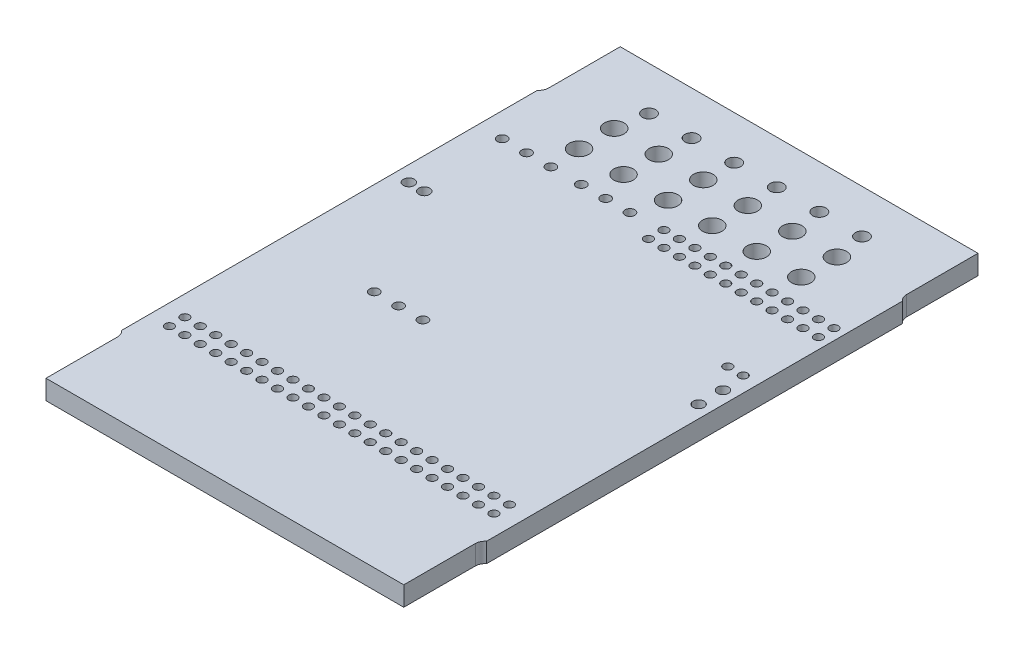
ISO-10303-21;
HEADER;
FILE_DESCRIPTION(('STEP AP214'),'2;1');
FILE_NAME('part.step','',(''),(''),'','','');
FILE_SCHEMA(('AUTOMOTIVE_DESIGN { 1 0 10303 214 1 1 1 1 }'));
ENDSEC;
DATA;
#1=APPLICATION_CONTEXT('core data for automotive mechanical design processes');
#2=APPLICATION_PROTOCOL_DEFINITION('international standard','automotive_design',2000,#1);
#3=PRODUCT_CONTEXT('',#1,'mechanical');
#4=PRODUCT('Part','Part','',(#3));
#5=PRODUCT_RELATED_PRODUCT_CATEGORY('part','',(#4));
#6=PRODUCT_DEFINITION_FORMATION('','',#4);
#7=PRODUCT_DEFINITION_CONTEXT('part definition',#1,'design');
#8=PRODUCT_DEFINITION('design','',#6,#7);
#9=PRODUCT_DEFINITION_SHAPE('','',#8);
#10=(LENGTH_UNIT() NAMED_UNIT(*) SI_UNIT(.MILLI.,.METRE.));
#11=(NAMED_UNIT(*) PLANE_ANGLE_UNIT() SI_UNIT($,.RADIAN.));
#12=(NAMED_UNIT(*) SI_UNIT($,.STERADIAN.) SOLID_ANGLE_UNIT());
#13=UNCERTAINTY_MEASURE_WITH_UNIT(LENGTH_MEASURE(1.E-05),#10,'distance_accuracy_value','');
#14=(GEOMETRIC_REPRESENTATION_CONTEXT(3) GLOBAL_UNCERTAINTY_ASSIGNED_CONTEXT((#13)) GLOBAL_UNIT_ASSIGNED_CONTEXT((#10,
#11,#12)) REPRESENTATION_CONTEXT('',''));
#15=CARTESIAN_POINT('',(0.,0.,0.));
#16=DIRECTION('',(0.,0.,1.));
#17=DIRECTION('',(1.,0.,0.));
#18=AXIS2_PLACEMENT_3D('',#15,#16,#17);
#19=CARTESIAN_POINT('',(-15.4358245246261,-1.2490009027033E-13,-25.2744997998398));
#20=DIRECTION('',(0.,-1.,0.));
#21=DIRECTION('',(0.,0.,-1.));
#22=AXIS2_PLACEMENT_3D('',#19,#20,#21);
#23=CYLINDRICAL_SURFACE('',#22,0.799999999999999);
#24=DIRECTION('',(0.,1.,0.));
#25=VECTOR('',#24,1.);
#26=CARTESIAN_POINT('',(-14.9358245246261,-1.2490009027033E-13,-24.65));
#27=LINE('',#26,#25);
#28=CARTESIAN_POINT('',(-14.9358245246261,1.59999999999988,-24.65));
#29=VERTEX_POINT('',#28);
#30=CARTESIAN_POINT('',(-14.9358245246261,-1.2490009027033E-13,-24.65));
#31=VERTEX_POINT('',#30);
#32=EDGE_CURVE('E475',#29,#31,#27,.F.);
#33=ORIENTED_EDGE('',*,*,#32,.F.);
#34=CARTESIAN_POINT('',(-15.4358245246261,1.59999999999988,-25.2744997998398));
#35=DIRECTION('',(0.,-1.,0.));
#36=DIRECTION('',(0.,0.,-1.));
#37=AXIS2_PLACEMENT_3D('',#34,#35,#36);
#38=CIRCLE('',#37,0.799999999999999);
#39=CARTESIAN_POINT('',(-14.6358245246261,1.59999999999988,-25.2744997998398));
#40=VERTEX_POINT('',#39);
#41=EDGE_CURVE('E20',#40,#29,#38,.T.);
#42=ORIENTED_EDGE('',*,*,#41,.F.);
#43=DIRECTION('',(0.,1.,0.));
#44=VECTOR('',#43,1.);
#45=CARTESIAN_POINT('',(-14.6358245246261,-1.2490009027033E-13,-25.2744997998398));
#46=LINE('',#45,#44);
#47=CARTESIAN_POINT('',(-14.6358245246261,-1.2490009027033E-13,-25.2744997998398));
#48=VERTEX_POINT('',#47);
#49=EDGE_CURVE('E480',#40,#48,#46,.F.);
#50=ORIENTED_EDGE('',*,*,#49,.T.);
#51=CARTESIAN_POINT('',(-15.4358245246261,-1.2490009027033E-13,-25.2744997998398));
#52=DIRECTION('',(0.,-1.,0.));
#53=DIRECTION('',(0.,0.,-1.));
#54=AXIS2_PLACEMENT_3D('',#51,#52,#53);
#55=CIRCLE('',#54,0.799999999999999);
#56=EDGE_CURVE('E506',#48,#31,#55,.T.);
#57=ORIENTED_EDGE('',*,*,#56,.T.);
#58=EDGE_LOOP('',(#33,#42,#50,#57));
#59=FACE_BOUND('',#58,.T.);
#60=ADVANCED_FACE('F17',(#59),#23,.F.);
#61=CARTESIAN_POINT('',(-15.4358245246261,0.,10.1612837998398));
#62=DIRECTION('',(0.,1.,0.));
#63=DIRECTION('',(0.,0.,1.));
#64=AXIS2_PLACEMENT_3D('',#61,#62,#63);
#65=CYLINDRICAL_SURFACE('',#64,0.8);
#66=DIRECTION('',(0.,1.,0.));
#67=VECTOR('',#66,1.);
#68=CARTESIAN_POINT('',(-14.6358245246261,0.,10.1612837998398));
#69=LINE('',#68,#67);
#70=CARTESIAN_POINT('',(-14.6358245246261,0.,10.1612837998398));
#71=VERTEX_POINT('',#70);
#72=CARTESIAN_POINT('',(-14.6358245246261,1.6,10.1612837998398));
#73=VERTEX_POINT('',#72);
#74=EDGE_CURVE('E129',#71,#73,#69,.T.);
#75=ORIENTED_EDGE('',*,*,#74,.T.);
#76=CARTESIAN_POINT('',(-15.4358245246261,1.6,10.1612837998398));
#77=DIRECTION('',(0.,1.,0.));
#78=DIRECTION('',(0.,0.,1.));
#79=AXIS2_PLACEMENT_3D('',#76,#77,#78);
#80=CIRCLE('',#79,0.8);
#81=CARTESIAN_POINT('',(-14.9358245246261,1.59999999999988,9.53678399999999));
#82=VERTEX_POINT('',#81);
#83=EDGE_CURVE('E142',#82,#73,#80,.F.);
#84=ORIENTED_EDGE('',*,*,#83,.F.);
#85=DIRECTION('',(0.,1.,0.));
#86=VECTOR('',#85,1.);
#87=CARTESIAN_POINT('',(-14.9358245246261,-1.2490009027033E-13,9.53678399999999));
#88=LINE('',#87,#86);
#89=CARTESIAN_POINT('',(-14.9358245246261,-1.2490009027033E-13,9.53678399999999));
#90=VERTEX_POINT('',#89);
#91=EDGE_CURVE('E479',#90,#82,#88,.T.);
#92=ORIENTED_EDGE('',*,*,#91,.F.);
#93=CARTESIAN_POINT('',(-15.4358245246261,0.,10.1612837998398));
#94=DIRECTION('',(0.,1.,0.));
#95=DIRECTION('',(0.,0.,1.));
#96=AXIS2_PLACEMENT_3D('',#93,#94,#95);
#97=CIRCLE('',#96,0.8);
#98=EDGE_CURVE('E504',#90,#71,#97,.F.);
#99=ORIENTED_EDGE('',*,*,#98,.T.);
#100=EDGE_LOOP('',(#75,#84,#92,#99));
#101=FACE_BOUND('',#100,.T.);
#102=ADVANCED_FACE('F1727',(#101),#65,.F.);
#103=CARTESIAN_POINT('',(15.5641154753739,-1.2490009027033E-13,-25.2744997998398));
#104=DIRECTION('',(0.,1.,0.));
#105=DIRECTION('',(0.,0.,1.));
#106=AXIS2_PLACEMENT_3D('',#103,#104,#105);
#107=CYLINDRICAL_SURFACE('',#106,0.799999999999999);
#108=DIRECTION('',(0.,1.,0.));
#109=VECTOR('',#108,1.);
#110=CARTESIAN_POINT('',(14.7641154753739,-1.2490009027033E-13,-25.2744997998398));
#111=LINE('',#110,#109);
#112=CARTESIAN_POINT('',(14.7641154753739,-1.2490009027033E-13,-25.2744997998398));
#113=VERTEX_POINT('',#112);
#114=CARTESIAN_POINT('',(14.7641154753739,1.59999999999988,-25.2744997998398));
#115=VERTEX_POINT('',#114);
#116=EDGE_CURVE('E484',#113,#115,#111,.T.);
#117=ORIENTED_EDGE('',*,*,#116,.T.);
#118=CARTESIAN_POINT('',(15.5641154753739,1.59999999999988,-25.2744997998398));
#119=DIRECTION('',(0.,1.,0.));
#120=DIRECTION('',(0.,0.,1.));
#121=AXIS2_PLACEMENT_3D('',#118,#119,#120);
#122=CIRCLE('',#121,0.799999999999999);
#123=CARTESIAN_POINT('',(15.0641154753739,1.59999999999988,-24.65));
#124=VERTEX_POINT('',#123);
#125=EDGE_CURVE('E35',#124,#115,#122,.F.);
#126=ORIENTED_EDGE('',*,*,#125,.F.);
#127=DIRECTION('',(0.,1.,0.));
#128=VECTOR('',#127,1.);
#129=CARTESIAN_POINT('',(15.0641154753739,-1.2490009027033E-13,-24.65));
#130=LINE('',#129,#128);
#131=CARTESIAN_POINT('',(15.0641154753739,-1.2490009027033E-13,-24.65));
#132=VERTEX_POINT('',#131);
#133=EDGE_CURVE('E468',#132,#124,#130,.T.);
#134=ORIENTED_EDGE('',*,*,#133,.F.);
#135=CARTESIAN_POINT('',(15.5641154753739,-1.2490009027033E-13,-25.2744997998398));
#136=DIRECTION('',(0.,1.,0.));
#137=DIRECTION('',(0.,0.,1.));
#138=AXIS2_PLACEMENT_3D('',#135,#136,#137);
#139=CIRCLE('',#138,0.799999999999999);
#140=EDGE_CURVE('E500',#132,#113,#139,.F.);
#141=ORIENTED_EDGE('',*,*,#140,.T.);
#142=EDGE_LOOP('',(#117,#126,#134,#141));
#143=FACE_BOUND('',#142,.T.);
#144=ADVANCED_FACE('F830',(#143),#107,.F.);
#145=CARTESIAN_POINT('',(15.5641154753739,0.,10.1612837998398));
#146=DIRECTION('',(0.,-1.,0.));
#147=DIRECTION('',(0.,0.,-1.));
#148=AXIS2_PLACEMENT_3D('',#145,#146,#147);
#149=CYLINDRICAL_SURFACE('',#148,0.8);
#150=DIRECTION('',(0.,1.,0.));
#151=VECTOR('',#150,1.);
#152=CARTESIAN_POINT('',(15.0641154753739,-1.2490009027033E-13,9.53678399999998));
#153=LINE('',#152,#151);
#154=CARTESIAN_POINT('',(15.0641154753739,1.59999999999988,9.53678399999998));
#155=VERTEX_POINT('',#154);
#156=CARTESIAN_POINT('',(15.0641154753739,-1.2490009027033E-13,9.53678399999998));
#157=VERTEX_POINT('',#156);
#158=EDGE_CURVE('E464',#155,#157,#153,.F.);
#159=ORIENTED_EDGE('',*,*,#158,.F.);
#160=CARTESIAN_POINT('',(15.5641154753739,1.59999999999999,10.1612837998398));
#161=DIRECTION('',(0.,-1.,0.));
#162=DIRECTION('',(0.,0.,-1.));
#163=AXIS2_PLACEMENT_3D('',#160,#161,#162);
#164=CIRCLE('',#163,0.8);
#165=CARTESIAN_POINT('',(14.7641154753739,1.6,10.1612837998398));
#166=VERTEX_POINT('',#165);
#167=EDGE_CURVE('E108',#166,#155,#164,.T.);
#168=ORIENTED_EDGE('',*,*,#167,.F.);
#169=DIRECTION('',(0.,1.,0.));
#170=VECTOR('',#169,1.);
#171=CARTESIAN_POINT('',(14.7641154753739,0.,10.1612837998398));
#172=LINE('',#171,#170);
#173=CARTESIAN_POINT('',(14.7641154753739,0.,10.1612837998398));
#174=VERTEX_POINT('',#173);
#175=EDGE_CURVE('E469',#166,#174,#172,.F.);
#176=ORIENTED_EDGE('',*,*,#175,.T.);
#177=CARTESIAN_POINT('',(15.5641154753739,0.,10.1612837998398));
#178=DIRECTION('',(0.,-1.,0.));
#179=DIRECTION('',(0.,0.,-1.));
#180=AXIS2_PLACEMENT_3D('',#177,#178,#179);
#181=CIRCLE('',#180,0.8);
#182=EDGE_CURVE('E502',#174,#157,#181,.T.);
#183=ORIENTED_EDGE('',*,*,#182,.T.);
#184=EDGE_LOOP('',(#159,#168,#176,#183));
#185=FACE_BOUND('',#184,.T.);
#186=ADVANCED_FACE('F1713',(#185),#149,.F.);
#187=CARTESIAN_POINT('',(0.,0.,0.));
#188=DIRECTION('',(0.,1.,0.));
#189=DIRECTION('',(0.,0.,1.));
#190=AXIS2_PLACEMENT_3D('',#187,#188,#189);
#191=PLANE('',#190);
#192=CARTESIAN_POINT('',(9.2315754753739,-1.2490009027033E-13,-25.08702));
#193=DIRECTION('',(0.,1.,0.));
#194=DIRECTION('',(0.,0.,1.));
#195=AXIS2_PLACEMENT_3D('',#192,#193,#194);
#196=CIRCLE('',#195,0.800000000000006);
#197=CARTESIAN_POINT('',(9.2315754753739,-1.24804690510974E-13,-24.28702));
#198=VERTEX_POINT('',#197);
#199=EDGE_CURVE('E170',#198,#198,#196,.T.);
#200=ORIENTED_EDGE('',*,*,#199,.T.);
#201=EDGE_LOOP('',(#200));
#202=FACE_BOUND('',#201,.T.);
#203=CARTESIAN_POINT('',(5.5715754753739,-1.2490009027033E-13,-25.08702));
#204=DIRECTION('',(0.,1.,0.));
#205=DIRECTION('',(0.,0.,1.));
#206=AXIS2_PLACEMENT_3D('',#203,#204,#205);
#207=CIRCLE('',#206,0.800000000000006);
#208=CARTESIAN_POINT('',(5.5715754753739,-1.24804690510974E-13,-24.28702));
#209=VERTEX_POINT('',#208);
#210=EDGE_CURVE('E173',#209,#209,#207,.T.);
#211=ORIENTED_EDGE('',*,*,#210,.T.);
#212=EDGE_LOOP('',(#211));
#213=FACE_BOUND('',#212,.T.);
#214=CARTESIAN_POINT('',(1.91157547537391,-1.2490009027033E-13,-25.08702));
#215=DIRECTION('',(0.,1.,0.));
#216=DIRECTION('',(0.,0.,1.));
#217=AXIS2_PLACEMENT_3D('',#214,#215,#216);
#218=CIRCLE('',#217,0.800000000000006);
#219=CARTESIAN_POINT('',(1.91157547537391,-1.24804690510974E-13,-24.28702));
#220=VERTEX_POINT('',#219);
#221=EDGE_CURVE('E176',#220,#220,#218,.T.);
#222=ORIENTED_EDGE('',*,*,#221,.T.);
#223=EDGE_LOOP('',(#222));
#224=FACE_BOUND('',#223,.T.);
#225=CARTESIAN_POINT('',(-1.74842452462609,-1.2490009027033E-13,-25.08702));
#226=DIRECTION('',(0.,1.,0.));
#227=DIRECTION('',(0.,0.,1.));
#228=AXIS2_PLACEMENT_3D('',#225,#226,#227);
#229=CIRCLE('',#228,0.800000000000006);
#230=CARTESIAN_POINT('',(-1.74842452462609,-1.24804690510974E-13,-24.28702));
#231=VERTEX_POINT('',#230);
#232=EDGE_CURVE('E179',#231,#231,#229,.T.);
#233=ORIENTED_EDGE('',*,*,#232,.T.);
#234=EDGE_LOOP('',(#233));
#235=FACE_BOUND('',#234,.T.);
#236=CARTESIAN_POINT('',(-8.70000000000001,0.,-27.577016));
#237=DIRECTION('',(0.,1.,0.));
#238=DIRECTION('',(0.,0.,1.));
#239=AXIS2_PLACEMENT_3D('',#236,#237,#238);
#240=CIRCLE('',#239,0.549999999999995);
#241=CARTESIAN_POINT('',(-8.70000000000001,0.,-27.027016));
#242=VERTEX_POINT('',#241);
#243=EDGE_CURVE('E182',#242,#242,#240,.T.);
#244=ORIENTED_EDGE('',*,*,#243,.T.);
#245=EDGE_LOOP('',(#244));
#246=FACE_BOUND('',#245,.T.);
#247=CARTESIAN_POINT('',(-5.20000000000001,0.,-27.577016));
#248=DIRECTION('',(0.,1.,0.));
#249=DIRECTION('',(0.,0.,1.));
#250=AXIS2_PLACEMENT_3D('',#247,#248,#249);
#251=CIRCLE('',#250,0.549999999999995);
#252=CARTESIAN_POINT('',(-5.20000000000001,0.,-27.027016));
#253=VERTEX_POINT('',#252);
#254=EDGE_CURVE('E185',#253,#253,#251,.T.);
#255=ORIENTED_EDGE('',*,*,#254,.T.);
#256=EDGE_LOOP('',(#255));
#257=FACE_BOUND('',#256,.T.);
#258=CARTESIAN_POINT('',(-1.70000000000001,-1.2490009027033E-13,-27.577016));
#259=DIRECTION('',(0.,1.,0.));
#260=DIRECTION('',(0.,0.,1.));
#261=AXIS2_PLACEMENT_3D('',#258,#259,#260);
#262=CIRCLE('',#261,0.549999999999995);
#263=CARTESIAN_POINT('',(-1.70000000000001,-1.24834502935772E-13,-27.027016));
#264=VERTEX_POINT('',#263);
#265=EDGE_CURVE('E188',#264,#264,#262,.T.);
#266=ORIENTED_EDGE('',*,*,#265,.T.);
#267=EDGE_LOOP('',(#266));
#268=FACE_BOUND('',#267,.T.);
#269=CARTESIAN_POINT('',(1.8,0.,-27.577016));
#270=DIRECTION('',(0.,1.,0.));
#271=DIRECTION('',(0.,0.,1.));
#272=AXIS2_PLACEMENT_3D('',#269,#270,#271);
#273=CIRCLE('',#272,0.549999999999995);
#274=CARTESIAN_POINT('',(1.8,0.,-27.027016));
#275=VERTEX_POINT('',#274);
#276=EDGE_CURVE('E191',#275,#275,#273,.T.);
#277=ORIENTED_EDGE('',*,*,#276,.T.);
#278=EDGE_LOOP('',(#277));
#279=FACE_BOUND('',#278,.T.);
#280=CARTESIAN_POINT('',(-12.398658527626,0.,-12.8092339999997));
#281=DIRECTION('',(0.,1.,0.));
#282=DIRECTION('',(0.,0.,1.));
#283=AXIS2_PLACEMENT_3D('',#280,#281,#282);
#284=CIRCLE('',#283,0.450000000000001);
#285=CARTESIAN_POINT('',(-12.398658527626,0.,-12.3592339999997));
#286=VERTEX_POINT('',#285);
#287=EDGE_CURVE('E194',#286,#286,#284,.T.);
#288=ORIENTED_EDGE('',*,*,#287,.T.);
#289=EDGE_LOOP('',(#288));
#290=FACE_BOUND('',#289,.T.);
#291=CARTESIAN_POINT('',(-13.668658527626,-1.2490009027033E-13,-12.8092339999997));
#292=DIRECTION('',(0.,1.,0.));
#293=DIRECTION('',(0.,0.,1.));
#294=AXIS2_PLACEMENT_3D('',#291,#292,#293);
#295=CIRCLE('',#294,0.450000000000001);
#296=CARTESIAN_POINT('',(-13.668658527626,-1.24846427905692E-13,-12.3592339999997));
#297=VERTEX_POINT('',#296);
#298=EDGE_CURVE('E197',#297,#297,#295,.T.);
#299=ORIENTED_EDGE('',*,*,#298,.T.);
#300=EDGE_LOOP('',(#299));
#301=FACE_BOUND('',#300,.T.);
#302=CARTESIAN_POINT('',(12.546681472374,-1.2490009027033E-13,-12.8092339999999));
#303=DIRECTION('',(0.,1.,0.));
#304=DIRECTION('',(0.,0.,1.));
#305=AXIS2_PLACEMENT_3D('',#302,#303,#304);
#306=CIRCLE('',#305,0.354999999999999);
#307=CARTESIAN_POINT('',(12.546681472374,-1.24857756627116E-13,-12.4542339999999));
#308=VERTEX_POINT('',#307);
#309=EDGE_CURVE('E200',#308,#308,#306,.T.);
#310=ORIENTED_EDGE('',*,*,#309,.T.);
#311=EDGE_LOOP('',(#310));
#312=FACE_BOUND('',#311,.T.);
#313=CARTESIAN_POINT('',(13.8166814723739,-1.2490009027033E-13,-12.8092339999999));
#314=DIRECTION('',(0.,1.,0.));
#315=DIRECTION('',(0.,0.,1.));
#316=AXIS2_PLACEMENT_3D('',#313,#314,#315);
#317=CIRCLE('',#316,0.354999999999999);
#318=CARTESIAN_POINT('',(13.8166814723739,-1.24857756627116E-13,-12.4542339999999));
#319=VERTEX_POINT('',#318);
#320=EDGE_CURVE('E203',#319,#319,#317,.T.);
#321=ORIENTED_EDGE('',*,*,#320,.T.);
#322=EDGE_LOOP('',(#321));
#323=FACE_BOUND('',#322,.T.);
#324=CARTESIAN_POINT('',(14.0318594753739,-1.2490009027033E-13,-10.926586));
#325=DIRECTION('',(0.,1.,0.));
#326=DIRECTION('',(0.,0.,1.));
#327=AXIS2_PLACEMENT_3D('',#324,#325,#326);
#328=CIRCLE('',#327,0.450000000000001);
#329=CARTESIAN_POINT('',(14.0318594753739,-1.24846427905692E-13,-10.476586));
#330=VERTEX_POINT('',#329);
#331=EDGE_CURVE('E206',#330,#330,#328,.T.);
#332=ORIENTED_EDGE('',*,*,#331,.T.);
#333=EDGE_LOOP('',(#332));
#334=FACE_BOUND('',#333,.T.);
#335=CARTESIAN_POINT('',(14.0318594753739,0.,-8.92659000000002));
#336=DIRECTION('',(0.,1.,0.));
#337=DIRECTION('',(0.,0.,1.));
#338=AXIS2_PLACEMENT_3D('',#335,#336,#337);
#339=CIRCLE('',#338,0.450000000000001);
#340=CARTESIAN_POINT('',(14.0318594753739,0.,-8.47659000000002));
#341=VERTEX_POINT('',#340);
#342=EDGE_CURVE('E209',#341,#341,#339,.T.);
#343=ORIENTED_EDGE('',*,*,#342,.T.);
#344=EDGE_LOOP('',(#343));
#345=FACE_BOUND('',#344,.T.);
#346=CARTESIAN_POINT('',(12.9051154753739,-1.2490009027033E-13,-18.631422));
#347=DIRECTION('',(0.,1.,0.));
#348=DIRECTION('',(0.,0.,1.));
#349=AXIS2_PLACEMENT_3D('',#346,#347,#348);
#350=CIRCLE('',#349,0.354999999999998);
#351=CARTESIAN_POINT('',(12.9051154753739,-1.24857756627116E-13,-18.276422));
#352=VERTEX_POINT('',#351);
#353=EDGE_CURVE('E212',#352,#352,#350,.T.);
#354=ORIENTED_EDGE('',*,*,#353,.T.);
#355=EDGE_LOOP('',(#354));
#356=FACE_BOUND('',#355,.T.);
#357=CARTESIAN_POINT('',(14.1751154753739,-1.2490009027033E-13,-18.631422));
#358=DIRECTION('',(0.,1.,0.));
#359=DIRECTION('',(0.,0.,1.));
#360=AXIS2_PLACEMENT_3D('',#357,#358,#359);
#361=CIRCLE('',#360,0.354999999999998);
#362=CARTESIAN_POINT('',(14.1751154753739,-1.24857756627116E-13,-18.276422));
#363=VERTEX_POINT('',#362);
#364=EDGE_CURVE('E215',#363,#363,#361,.T.);
#365=ORIENTED_EDGE('',*,*,#364,.T.);
#366=EDGE_LOOP('',(#365));
#367=FACE_BOUND('',#366,.T.);
#368=CARTESIAN_POINT('',(-12.0021245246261,0.,7.263624));
#369=DIRECTION('',(0.,1.,0.));
#370=DIRECTION('',(0.,0.,1.));
#371=AXIS2_PLACEMENT_3D('',#368,#369,#370);
#372=CIRCLE('',#371,0.354999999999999);
#373=CARTESIAN_POINT('',(-12.0021245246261,0.,7.618624));
#374=VERTEX_POINT('',#373);
#375=EDGE_CURVE('E218',#374,#374,#372,.T.);
#376=ORIENTED_EDGE('',*,*,#375,.T.);
#377=EDGE_LOOP('',(#376));
#378=FACE_BOUND('',#377,.T.);
#379=CARTESIAN_POINT('',(-13.2721245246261,-1.2490009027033E-13,7.263624));
#380=DIRECTION('',(0.,1.,0.));
#381=DIRECTION('',(0.,0.,1.));
#382=AXIS2_PLACEMENT_3D('',#379,#380,#381);
#383=CIRCLE('',#382,0.354999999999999);
#384=CARTESIAN_POINT('',(-13.2721245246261,-1.24857756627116E-13,7.618624));
#385=VERTEX_POINT('',#384);
#386=EDGE_CURVE('E221',#385,#385,#383,.T.);
#387=ORIENTED_EDGE('',*,*,#386,.T.);
#388=EDGE_LOOP('',(#387));
#389=FACE_BOUND('',#388,.T.);
#390=CARTESIAN_POINT('',(-9.0623285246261,0.,-22.191232));
#391=DIRECTION('',(0.,1.,0.));
#392=DIRECTION('',(0.,0.,1.));
#393=AXIS2_PLACEMENT_3D('',#390,#391,#392);
#394=CIRCLE('',#393,0.799999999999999);
#395=CARTESIAN_POINT('',(-9.0623285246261,0.,-21.391232));
#396=VERTEX_POINT('',#395);
#397=EDGE_CURVE('E224',#396,#396,#394,.T.);
#398=ORIENTED_EDGE('',*,*,#397,.T.);
#399=EDGE_LOOP('',(#398));
#400=FACE_BOUND('',#399,.T.);
#401=CARTESIAN_POINT('',(9.20027147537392,-1.2490009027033E-13,-22.191232));
#402=DIRECTION('',(0.,1.,0.));
#403=DIRECTION('',(0.,0.,1.));
#404=AXIS2_PLACEMENT_3D('',#401,#402,#403);
#405=CIRCLE('',#404,0.799999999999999);
#406=CARTESIAN_POINT('',(9.20027147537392,-1.24804690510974E-13,-21.391232));
#407=VERTEX_POINT('',#406);
#408=EDGE_CURVE('E227',#407,#407,#405,.T.);
#409=ORIENTED_EDGE('',*,*,#408,.T.);
#410=EDGE_LOOP('',(#409));
#411=FACE_BOUND('',#410,.T.);
#412=CARTESIAN_POINT('',(5.54267147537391,0.,-22.191232));
#413=DIRECTION('',(0.,1.,0.));
#414=DIRECTION('',(0.,0.,1.));
#415=AXIS2_PLACEMENT_3D('',#412,#413,#414);
#416=CIRCLE('',#415,0.799999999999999);
#417=CARTESIAN_POINT('',(5.54267147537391,0.,-21.391232));
#418=VERTEX_POINT('',#417);
#419=EDGE_CURVE('E230',#418,#418,#416,.T.);
#420=ORIENTED_EDGE('',*,*,#419,.T.);
#421=EDGE_LOOP('',(#420));
#422=FACE_BOUND('',#421,.T.);
#423=CARTESIAN_POINT('',(1.8850714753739,0.,-22.191232));
#424=DIRECTION('',(0.,1.,0.));
#425=DIRECTION('',(0.,0.,1.));
#426=AXIS2_PLACEMENT_3D('',#423,#424,#425);
#427=CIRCLE('',#426,0.799999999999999);
#428=CARTESIAN_POINT('',(1.88507147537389,0.,-21.391232));
#429=VERTEX_POINT('',#428);
#430=EDGE_CURVE('E233',#429,#429,#427,.T.);
#431=ORIENTED_EDGE('',*,*,#430,.T.);
#432=EDGE_LOOP('',(#431));
#433=FACE_BOUND('',#432,.T.);
#434=CARTESIAN_POINT('',(-1.74712852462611,-1.2490009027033E-13,-22.191232));
#435=DIRECTION('',(0.,1.,0.));
#436=DIRECTION('',(0.,0.,1.));
#437=AXIS2_PLACEMENT_3D('',#434,#435,#436);
#438=CIRCLE('',#437,0.799999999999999);
#439=CARTESIAN_POINT('',(-1.74712852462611,-1.24804690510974E-13,-21.391232));
#440=VERTEX_POINT('',#439);
#441=EDGE_CURVE('E236',#440,#440,#438,.T.);
#442=ORIENTED_EDGE('',*,*,#441,.T.);
#443=EDGE_LOOP('',(#442));
#444=FACE_BOUND('',#443,.T.);
#445=CARTESIAN_POINT('',(-5.40472852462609,0.,-22.191232));
#446=DIRECTION('',(0.,1.,0.));
#447=DIRECTION('',(0.,0.,1.));
#448=AXIS2_PLACEMENT_3D('',#445,#446,#447);
#449=CIRCLE('',#448,0.799999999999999);
#450=CARTESIAN_POINT('',(-5.40472852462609,0.,-21.391232));
#451=VERTEX_POINT('',#450);
#452=EDGE_CURVE('E239',#451,#451,#449,.T.);
#453=ORIENTED_EDGE('',*,*,#452,.T.);
#454=EDGE_LOOP('',(#453));
#455=FACE_BOUND('',#454,.T.);
#456=DIRECTION('',(0.,0.,1.));
#457=VECTOR('',#456,1.);
#458=CARTESIAN_POINT('',(14.7641154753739,-1.2490009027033E-13,0.));
#459=LINE('',#458,#457);
#460=CARTESIAN_POINT('',(14.7641154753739,0.,-31.15));
#461=VERTEX_POINT('',#460);
#462=EDGE_CURVE('E485',#461,#113,#459,.T.);
#463=ORIENTED_EDGE('',*,*,#462,.T.);
#464=ORIENTED_EDGE('',*,*,#140,.F.);
#465=DIRECTION('',(0.,0.,-1.));
#466=VECTOR('',#465,1.);
#467=CARTESIAN_POINT('',(15.0641154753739,-1.2490009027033E-13,-26.05));
#468=LINE('',#467,#466);
#469=EDGE_CURVE('E461',#157,#132,#468,.T.);
#470=ORIENTED_EDGE('',*,*,#469,.F.);
#471=ORIENTED_EDGE('',*,*,#182,.F.);
#472=DIRECTION('',(0.,0.,1.));
#473=VECTOR('',#472,1.);
#474=CARTESIAN_POINT('',(14.7641154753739,-1.2490009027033E-13,0.));
#475=LINE('',#474,#473);
#476=CARTESIAN_POINT('',(14.7641154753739,-1.2490009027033E-13,16.036784));
#477=VERTEX_POINT('',#476);
#478=EDGE_CURVE('E465',#174,#477,#475,.T.);
#479=ORIENTED_EDGE('',*,*,#478,.T.);
#480=DIRECTION('',(1.,0.,0.));
#481=VECTOR('',#480,1.);
#482=CARTESIAN_POINT('',(15.0641154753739,-1.2490009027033E-13,16.036784));
#483=LINE('',#482,#481);
#484=CARTESIAN_POINT('',(-14.6358245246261,-1.2490009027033E-13,16.036784));
#485=VERTEX_POINT('',#484);
#486=EDGE_CURVE('E128',#485,#477,#483,.T.);
#487=ORIENTED_EDGE('',*,*,#486,.F.);
#488=DIRECTION('',(0.,0.,1.));
#489=VECTOR('',#488,1.);
#490=CARTESIAN_POINT('',(-14.6358245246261,0.,0.));
#491=LINE('',#490,#489);
#492=EDGE_CURVE('E126',#485,#71,#491,.F.);
#493=ORIENTED_EDGE('',*,*,#492,.T.);
#494=ORIENTED_EDGE('',*,*,#98,.F.);
#495=DIRECTION('',(0.,0.,1.));
#496=VECTOR('',#495,1.);
#497=CARTESIAN_POINT('',(-14.9358245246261,-1.2490009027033E-13,16.036784));
#498=LINE('',#497,#496);
#499=EDGE_CURVE('E472',#31,#90,#498,.T.);
#500=ORIENTED_EDGE('',*,*,#499,.F.);
#501=ORIENTED_EDGE('',*,*,#56,.F.);
#502=DIRECTION('',(0.,0.,1.));
#503=VECTOR('',#502,1.);
#504=CARTESIAN_POINT('',(-14.6358245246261,0.,0.));
#505=LINE('',#504,#503);
#506=CARTESIAN_POINT('',(-14.6358245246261,0.,-31.15));
#507=VERTEX_POINT('',#506);
#508=EDGE_CURVE('E476',#48,#507,#505,.F.);
#509=ORIENTED_EDGE('',*,*,#508,.T.);
#510=DIRECTION('',(1.,0.,0.));
#511=VECTOR('',#510,1.);
#512=CARTESIAN_POINT('',(0.,0.,-31.15));
#513=LINE('',#512,#511);
#514=EDGE_CURVE('E481',#507,#461,#513,.T.);
#515=ORIENTED_EDGE('',*,*,#514,.T.);
#516=EDGE_LOOP('',(#463,#464,#470,#471,#479,#487,#493,#494,#500,#501,#509,#515));
#517=FACE_BOUND('',#516,.T.);
#518=CARTESIAN_POINT('',(-10.7321245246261,0.,7.263624));
#519=DIRECTION('',(0.,1.,0.));
#520=DIRECTION('',(0.,0.,1.));
#521=AXIS2_PLACEMENT_3D('',#518,#519,#520);
#522=CIRCLE('',#521,0.354999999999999);
#523=CARTESIAN_POINT('',(-10.7321245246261,0.,7.618624));
#524=VERTEX_POINT('',#523);
#525=EDGE_CURVE('E242',#524,#524,#522,.T.);
#526=ORIENTED_EDGE('',*,*,#525,.T.);
#527=EDGE_LOOP('',(#526));
#528=FACE_BOUND('',#527,.T.);
#529=CARTESIAN_POINT('',(-9.46212452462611,0.,7.263624));
#530=DIRECTION('',(0.,1.,0.));
#531=DIRECTION('',(0.,0.,1.));
#532=AXIS2_PLACEMENT_3D('',#529,#530,#531);
#533=CIRCLE('',#532,0.354999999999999);
#534=CARTESIAN_POINT('',(-9.46212452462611,0.,7.618624));
#535=VERTEX_POINT('',#534);
#536=EDGE_CURVE('E245',#535,#535,#533,.T.);
#537=ORIENTED_EDGE('',*,*,#536,.T.);
#538=EDGE_LOOP('',(#537));
#539=FACE_BOUND('',#538,.T.);
#540=CARTESIAN_POINT('',(-8.19212452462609,0.,7.263624));
#541=DIRECTION('',(0.,1.,0.));
#542=DIRECTION('',(0.,0.,1.));
#543=AXIS2_PLACEMENT_3D('',#540,#541,#542);
#544=CIRCLE('',#543,0.354999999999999);
#545=CARTESIAN_POINT('',(-8.19212452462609,0.,7.618624));
#546=VERTEX_POINT('',#545);
#547=EDGE_CURVE('E248',#546,#546,#544,.T.);
#548=ORIENTED_EDGE('',*,*,#547,.T.);
#549=EDGE_LOOP('',(#548));
#550=FACE_BOUND('',#549,.T.);
#551=CARTESIAN_POINT('',(-6.92212452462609,0.,7.26362400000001));
#552=DIRECTION('',(0.,1.,0.));
#553=DIRECTION('',(0.,0.,1.));
#554=AXIS2_PLACEMENT_3D('',#551,#552,#553);
#555=CIRCLE('',#554,0.354999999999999);
#556=CARTESIAN_POINT('',(-6.92212452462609,0.,7.61862400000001));
#557=VERTEX_POINT('',#556);
#558=EDGE_CURVE('E251',#557,#557,#555,.T.);
#559=ORIENTED_EDGE('',*,*,#558,.T.);
#560=EDGE_LOOP('',(#559));
#561=FACE_BOUND('',#560,.T.);
#562=CARTESIAN_POINT('',(-5.6521245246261,0.,7.26362400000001));
#563=DIRECTION('',(0.,1.,0.));
#564=DIRECTION('',(0.,0.,1.));
#565=AXIS2_PLACEMENT_3D('',#562,#563,#564);
#566=CIRCLE('',#565,0.354999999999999);
#567=CARTESIAN_POINT('',(-5.6521245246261,0.,7.61862400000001));
#568=VERTEX_POINT('',#567);
#569=EDGE_CURVE('E254',#568,#568,#566,.T.);
#570=ORIENTED_EDGE('',*,*,#569,.T.);
#571=EDGE_LOOP('',(#570));
#572=FACE_BOUND('',#571,.T.);
#573=CARTESIAN_POINT('',(-4.38212452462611,-1.2490009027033E-13,7.263624));
#574=DIRECTION('',(0.,1.,0.));
#575=DIRECTION('',(0.,0.,1.));
#576=AXIS2_PLACEMENT_3D('',#573,#574,#575);
#577=CIRCLE('',#576,0.354999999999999);
#578=CARTESIAN_POINT('',(-4.38212452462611,-1.24857756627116E-13,7.618624));
#579=VERTEX_POINT('',#578);
#580=EDGE_CURVE('E257',#579,#579,#577,.T.);
#581=ORIENTED_EDGE('',*,*,#580,.T.);
#582=EDGE_LOOP('',(#581));
#583=FACE_BOUND('',#582,.T.);
#584=CARTESIAN_POINT('',(-3.11212452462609,-1.2490009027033E-13,7.263624));
#585=DIRECTION('',(0.,1.,0.));
#586=DIRECTION('',(0.,0.,1.));
#587=AXIS2_PLACEMENT_3D('',#584,#585,#586);
#588=CIRCLE('',#587,0.354999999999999);
#589=CARTESIAN_POINT('',(-3.11212452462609,-1.24857756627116E-13,7.618624));
#590=VERTEX_POINT('',#589);
#591=EDGE_CURVE('E260',#590,#590,#588,.T.);
#592=ORIENTED_EDGE('',*,*,#591,.T.);
#593=EDGE_LOOP('',(#592));
#594=FACE_BOUND('',#593,.T.);
#595=CARTESIAN_POINT('',(-1.84212452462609,-1.2490009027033E-13,7.263624));
#596=DIRECTION('',(0.,1.,0.));
#597=DIRECTION('',(0.,0.,1.));
#598=AXIS2_PLACEMENT_3D('',#595,#596,#597);
#599=CIRCLE('',#598,0.354999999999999);
#600=CARTESIAN_POINT('',(-1.84212452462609,-1.24857756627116E-13,7.618624));
#601=VERTEX_POINT('',#600);
#602=EDGE_CURVE('E263',#601,#601,#599,.T.);
#603=ORIENTED_EDGE('',*,*,#602,.T.);
#604=EDGE_LOOP('',(#603));
#605=FACE_BOUND('',#604,.T.);
#606=CARTESIAN_POINT('',(-0.5721245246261,0.,7.263624));
#607=DIRECTION('',(0.,1.,0.));
#608=DIRECTION('',(0.,0.,1.));
#609=AXIS2_PLACEMENT_3D('',#606,#607,#608);
#610=CIRCLE('',#609,0.354999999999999);
#611=CARTESIAN_POINT('',(-0.5721245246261,0.,7.618624));
#612=VERTEX_POINT('',#611);
#613=EDGE_CURVE('E266',#612,#612,#610,.T.);
#614=ORIENTED_EDGE('',*,*,#613,.T.);
#615=EDGE_LOOP('',(#614));
#616=FACE_BOUND('',#615,.T.);
#617=CARTESIAN_POINT('',(0.697875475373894,0.,7.263624));
#618=DIRECTION('',(0.,1.,0.));
#619=DIRECTION('',(0.,0.,1.));
#620=AXIS2_PLACEMENT_3D('',#617,#618,#619);
#621=CIRCLE('',#620,0.354999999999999);
#622=CARTESIAN_POINT('',(0.697875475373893,0.,7.618624));
#623=VERTEX_POINT('',#622);
#624=EDGE_CURVE('E269',#623,#623,#621,.T.);
#625=ORIENTED_EDGE('',*,*,#624,.T.);
#626=EDGE_LOOP('',(#625));
#627=FACE_BOUND('',#626,.T.);
#628=CARTESIAN_POINT('',(1.96787547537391,0.,7.263624));
#629=DIRECTION('',(0.,1.,0.));
#630=DIRECTION('',(0.,0.,1.));
#631=AXIS2_PLACEMENT_3D('',#628,#629,#630);
#632=CIRCLE('',#631,0.354999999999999);
#633=CARTESIAN_POINT('',(1.96787547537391,0.,7.618624));
#634=VERTEX_POINT('',#633);
#635=EDGE_CURVE('E272',#634,#634,#632,.T.);
#636=ORIENTED_EDGE('',*,*,#635,.T.);
#637=EDGE_LOOP('',(#636));
#638=FACE_BOUND('',#637,.T.);
#639=CARTESIAN_POINT('',(3.23787547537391,0.,7.263624));
#640=DIRECTION('',(0.,1.,0.));
#641=DIRECTION('',(0.,0.,1.));
#642=AXIS2_PLACEMENT_3D('',#639,#640,#641);
#643=CIRCLE('',#642,0.354999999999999);
#644=CARTESIAN_POINT('',(3.23787547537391,0.,7.618624));
#645=VERTEX_POINT('',#644);
#646=EDGE_CURVE('E275',#645,#645,#643,.T.);
#647=ORIENTED_EDGE('',*,*,#646,.T.);
#648=EDGE_LOOP('',(#647));
#649=FACE_BOUND('',#648,.T.);
#650=CARTESIAN_POINT('',(4.5078754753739,-1.2490009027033E-13,7.263624));
#651=DIRECTION('',(0.,1.,0.));
#652=DIRECTION('',(0.,0.,1.));
#653=AXIS2_PLACEMENT_3D('',#650,#651,#652);
#654=CIRCLE('',#653,0.354999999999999);
#655=CARTESIAN_POINT('',(4.5078754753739,-1.24857756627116E-13,7.618624));
#656=VERTEX_POINT('',#655);
#657=EDGE_CURVE('E278',#656,#656,#654,.T.);
#658=ORIENTED_EDGE('',*,*,#657,.T.);
#659=EDGE_LOOP('',(#658));
#660=FACE_BOUND('',#659,.T.);
#661=CARTESIAN_POINT('',(5.77787547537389,-1.2490009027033E-13,7.263624));
#662=DIRECTION('',(0.,1.,0.));
#663=DIRECTION('',(0.,0.,1.));
#664=AXIS2_PLACEMENT_3D('',#661,#662,#663);
#665=CIRCLE('',#664,0.354999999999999);
#666=CARTESIAN_POINT('',(5.77787547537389,-1.24857756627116E-13,7.618624));
#667=VERTEX_POINT('',#666);
#668=EDGE_CURVE('E281',#667,#667,#665,.T.);
#669=ORIENTED_EDGE('',*,*,#668,.T.);
#670=EDGE_LOOP('',(#669));
#671=FACE_BOUND('',#670,.T.);
#672=CARTESIAN_POINT('',(7.04787547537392,-1.2490009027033E-13,7.263624));
#673=DIRECTION('',(0.,1.,0.));
#674=DIRECTION('',(0.,0.,1.));
#675=AXIS2_PLACEMENT_3D('',#672,#673,#674);
#676=CIRCLE('',#675,0.354999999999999);
#677=CARTESIAN_POINT('',(7.04787547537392,-1.24857756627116E-13,7.618624));
#678=VERTEX_POINT('',#677);
#679=EDGE_CURVE('E284',#678,#678,#676,.T.);
#680=ORIENTED_EDGE('',*,*,#679,.T.);
#681=EDGE_LOOP('',(#680));
#682=FACE_BOUND('',#681,.T.);
#683=CARTESIAN_POINT('',(8.31787547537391,-1.2490009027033E-13,7.263624));
#684=DIRECTION('',(0.,1.,0.));
#685=DIRECTION('',(0.,0.,1.));
#686=AXIS2_PLACEMENT_3D('',#683,#684,#685);
#687=CIRCLE('',#686,0.354999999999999);
#688=CARTESIAN_POINT('',(8.31787547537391,-1.24857756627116E-13,7.618624));
#689=VERTEX_POINT('',#688);
#690=EDGE_CURVE('E287',#689,#689,#687,.T.);
#691=ORIENTED_EDGE('',*,*,#690,.T.);
#692=EDGE_LOOP('',(#691));
#693=FACE_BOUND('',#692,.T.);
#694=CARTESIAN_POINT('',(9.5878754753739,-1.2490009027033E-13,7.263624));
#695=DIRECTION('',(0.,1.,0.));
#696=DIRECTION('',(0.,0.,1.));
#697=AXIS2_PLACEMENT_3D('',#694,#695,#696);
#698=CIRCLE('',#697,0.354999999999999);
#699=CARTESIAN_POINT('',(9.5878754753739,-1.24857756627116E-13,7.618624));
#700=VERTEX_POINT('',#699);
#701=EDGE_CURVE('E290',#700,#700,#698,.T.);
#702=ORIENTED_EDGE('',*,*,#701,.T.);
#703=EDGE_LOOP('',(#702));
#704=FACE_BOUND('',#703,.T.);
#705=CARTESIAN_POINT('',(10.8578754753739,0.,7.263624));
#706=DIRECTION('',(0.,1.,0.));
#707=DIRECTION('',(0.,0.,1.));
#708=AXIS2_PLACEMENT_3D('',#705,#706,#707);
#709=CIRCLE('',#708,0.354999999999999);
#710=CARTESIAN_POINT('',(10.8578754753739,0.,7.618624));
#711=VERTEX_POINT('',#710);
#712=EDGE_CURVE('E293',#711,#711,#709,.T.);
#713=ORIENTED_EDGE('',*,*,#712,.T.);
#714=EDGE_LOOP('',(#713));
#715=FACE_BOUND('',#714,.T.);
#716=CARTESIAN_POINT('',(12.1278754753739,0.,7.263624));
#717=DIRECTION('',(0.,1.,0.));
#718=DIRECTION('',(0.,0.,1.));
#719=AXIS2_PLACEMENT_3D('',#716,#717,#718);
#720=CIRCLE('',#719,0.354999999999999);
#721=CARTESIAN_POINT('',(12.1278754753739,0.,7.618624));
#722=VERTEX_POINT('',#721);
#723=EDGE_CURVE('E296',#722,#722,#720,.T.);
#724=ORIENTED_EDGE('',*,*,#723,.T.);
#725=EDGE_LOOP('',(#724));
#726=FACE_BOUND('',#725,.T.);
#727=CARTESIAN_POINT('',(13.3978754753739,-1.2490009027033E-13,7.263624));
#728=DIRECTION('',(0.,1.,0.));
#729=DIRECTION('',(0.,0.,1.));
#730=AXIS2_PLACEMENT_3D('',#727,#728,#729);
#731=CIRCLE('',#730,0.354999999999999);
#732=CARTESIAN_POINT('',(13.3978754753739,-1.24857756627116E-13,7.618624));
#733=VERTEX_POINT('',#732);
#734=EDGE_CURVE('E299',#733,#733,#731,.T.);
#735=ORIENTED_EDGE('',*,*,#734,.T.);
#736=EDGE_LOOP('',(#735));
#737=FACE_BOUND('',#736,.T.);
#738=CARTESIAN_POINT('',(-13.2721245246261,0.,5.993624));
#739=DIRECTION('',(0.,1.,0.));
#740=DIRECTION('',(0.,0.,1.));
#741=AXIS2_PLACEMENT_3D('',#738,#739,#740);
#742=CIRCLE('',#741,0.354999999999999);
#743=CARTESIAN_POINT('',(-13.2721245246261,0.,6.348624));
#744=VERTEX_POINT('',#743);
#745=EDGE_CURVE('E302',#744,#744,#742,.T.);
#746=ORIENTED_EDGE('',*,*,#745,.T.);
#747=EDGE_LOOP('',(#746));
#748=FACE_BOUND('',#747,.T.);
#749=CARTESIAN_POINT('',(-12.0021245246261,1.2490009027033E-13,5.993624));
#750=DIRECTION('',(0.,1.,0.));
#751=DIRECTION('',(0.,0.,1.));
#752=AXIS2_PLACEMENT_3D('',#749,#750,#751);
#753=CIRCLE('',#752,0.354999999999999);
#754=CARTESIAN_POINT('',(-12.0021245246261,1.24942423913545E-13,6.348624));
#755=VERTEX_POINT('',#754);
#756=EDGE_CURVE('E305',#755,#755,#753,.T.);
#757=ORIENTED_EDGE('',*,*,#756,.T.);
#758=EDGE_LOOP('',(#757));
#759=FACE_BOUND('',#758,.T.);
#760=CARTESIAN_POINT('',(-10.7321245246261,0.,5.993624));
#761=DIRECTION('',(0.,1.,0.));
#762=DIRECTION('',(0.,0.,1.));
#763=AXIS2_PLACEMENT_3D('',#760,#761,#762);
#764=CIRCLE('',#763,0.354999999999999);
#765=CARTESIAN_POINT('',(-10.7321245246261,0.,6.348624));
#766=VERTEX_POINT('',#765);
#767=EDGE_CURVE('E308',#766,#766,#764,.T.);
#768=ORIENTED_EDGE('',*,*,#767,.T.);
#769=EDGE_LOOP('',(#768));
#770=FACE_BOUND('',#769,.T.);
#771=CARTESIAN_POINT('',(-9.46212452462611,0.,5.993624));
#772=DIRECTION('',(0.,1.,0.));
#773=DIRECTION('',(0.,0.,1.));
#774=AXIS2_PLACEMENT_3D('',#771,#772,#773);
#775=CIRCLE('',#774,0.354999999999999);
#776=CARTESIAN_POINT('',(-9.46212452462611,0.,6.348624));
#777=VERTEX_POINT('',#776);
#778=EDGE_CURVE('E311',#777,#777,#775,.T.);
#779=ORIENTED_EDGE('',*,*,#778,.T.);
#780=EDGE_LOOP('',(#779));
#781=FACE_BOUND('',#780,.T.);
#782=CARTESIAN_POINT('',(-8.19212452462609,0.,5.993624));
#783=DIRECTION('',(0.,1.,0.));
#784=DIRECTION('',(0.,0.,1.));
#785=AXIS2_PLACEMENT_3D('',#782,#783,#784);
#786=CIRCLE('',#785,0.354999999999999);
#787=CARTESIAN_POINT('',(-8.19212452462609,0.,6.348624));
#788=VERTEX_POINT('',#787);
#789=EDGE_CURVE('E314',#788,#788,#786,.T.);
#790=ORIENTED_EDGE('',*,*,#789,.T.);
#791=EDGE_LOOP('',(#790));
#792=FACE_BOUND('',#791,.T.);
#793=CARTESIAN_POINT('',(-6.92212452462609,0.,5.99362400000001));
#794=DIRECTION('',(0.,1.,0.));
#795=DIRECTION('',(0.,0.,1.));
#796=AXIS2_PLACEMENT_3D('',#793,#794,#795);
#797=CIRCLE('',#796,0.354999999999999);
#798=CARTESIAN_POINT('',(-6.92212452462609,0.,6.34862400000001));
#799=VERTEX_POINT('',#798);
#800=EDGE_CURVE('E317',#799,#799,#797,.T.);
#801=ORIENTED_EDGE('',*,*,#800,.T.);
#802=EDGE_LOOP('',(#801));
#803=FACE_BOUND('',#802,.T.);
#804=CARTESIAN_POINT('',(-5.6521245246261,0.,5.99362400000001));
#805=DIRECTION('',(0.,1.,0.));
#806=DIRECTION('',(0.,0.,1.));
#807=AXIS2_PLACEMENT_3D('',#804,#805,#806);
#808=CIRCLE('',#807,0.354999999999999);
#809=CARTESIAN_POINT('',(-5.6521245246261,0.,6.34862400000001));
#810=VERTEX_POINT('',#809);
#811=EDGE_CURVE('E320',#810,#810,#808,.T.);
#812=ORIENTED_EDGE('',*,*,#811,.T.);
#813=EDGE_LOOP('',(#812));
#814=FACE_BOUND('',#813,.T.);
#815=CARTESIAN_POINT('',(-4.38212452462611,0.,5.993624));
#816=DIRECTION('',(0.,1.,0.));
#817=DIRECTION('',(0.,0.,1.));
#818=AXIS2_PLACEMENT_3D('',#815,#816,#817);
#819=CIRCLE('',#818,0.354999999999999);
#820=CARTESIAN_POINT('',(-4.38212452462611,0.,6.348624));
#821=VERTEX_POINT('',#820);
#822=EDGE_CURVE('E323',#821,#821,#819,.T.);
#823=ORIENTED_EDGE('',*,*,#822,.T.);
#824=EDGE_LOOP('',(#823));
#825=FACE_BOUND('',#824,.T.);
#826=CARTESIAN_POINT('',(-3.11212452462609,-1.2490009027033E-13,5.993624));
#827=DIRECTION('',(0.,1.,0.));
#828=DIRECTION('',(0.,0.,1.));
#829=AXIS2_PLACEMENT_3D('',#826,#827,#828);
#830=CIRCLE('',#829,0.354999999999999);
#831=CARTESIAN_POINT('',(-3.11212452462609,-1.24857756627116E-13,6.348624));
#832=VERTEX_POINT('',#831);
#833=EDGE_CURVE('E326',#832,#832,#830,.T.);
#834=ORIENTED_EDGE('',*,*,#833,.T.);
#835=EDGE_LOOP('',(#834));
#836=FACE_BOUND('',#835,.T.);
#837=CARTESIAN_POINT('',(-1.84212452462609,-1.2490009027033E-13,5.993624));
#838=DIRECTION('',(0.,1.,0.));
#839=DIRECTION('',(0.,0.,1.));
#840=AXIS2_PLACEMENT_3D('',#837,#838,#839);
#841=CIRCLE('',#840,0.354999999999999);
#842=CARTESIAN_POINT('',(-1.84212452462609,-1.24857756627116E-13,6.348624));
#843=VERTEX_POINT('',#842);
#844=EDGE_CURVE('E329',#843,#843,#841,.T.);
#845=ORIENTED_EDGE('',*,*,#844,.T.);
#846=EDGE_LOOP('',(#845));
#847=FACE_BOUND('',#846,.T.);
#848=CARTESIAN_POINT('',(-0.5721245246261,0.,5.993624));
#849=DIRECTION('',(0.,1.,0.));
#850=DIRECTION('',(0.,0.,1.));
#851=AXIS2_PLACEMENT_3D('',#848,#849,#850);
#852=CIRCLE('',#851,0.354999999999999);
#853=CARTESIAN_POINT('',(-0.5721245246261,0.,6.348624));
#854=VERTEX_POINT('',#853);
#855=EDGE_CURVE('E332',#854,#854,#852,.T.);
#856=ORIENTED_EDGE('',*,*,#855,.T.);
#857=EDGE_LOOP('',(#856));
#858=FACE_BOUND('',#857,.T.);
#859=CARTESIAN_POINT('',(0.697875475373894,0.,5.993624));
#860=DIRECTION('',(0.,1.,0.));
#861=DIRECTION('',(0.,0.,1.));
#862=AXIS2_PLACEMENT_3D('',#859,#860,#861);
#863=CIRCLE('',#862,0.354999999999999);
#864=CARTESIAN_POINT('',(0.697875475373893,0.,6.348624));
#865=VERTEX_POINT('',#864);
#866=EDGE_CURVE('E335',#865,#865,#863,.T.);
#867=ORIENTED_EDGE('',*,*,#866,.T.);
#868=EDGE_LOOP('',(#867));
#869=FACE_BOUND('',#868,.T.);
#870=CARTESIAN_POINT('',(1.96787547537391,0.,5.993624));
#871=DIRECTION('',(0.,1.,0.));
#872=DIRECTION('',(0.,0.,1.));
#873=AXIS2_PLACEMENT_3D('',#870,#871,#872);
#874=CIRCLE('',#873,0.354999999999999);
#875=CARTESIAN_POINT('',(1.96787547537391,0.,6.348624));
#876=VERTEX_POINT('',#875);
#877=EDGE_CURVE('E338',#876,#876,#874,.T.);
#878=ORIENTED_EDGE('',*,*,#877,.T.);
#879=EDGE_LOOP('',(#878));
#880=FACE_BOUND('',#879,.T.);
#881=CARTESIAN_POINT('',(3.23787547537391,0.,5.993624));
#882=DIRECTION('',(0.,1.,0.));
#883=DIRECTION('',(0.,0.,1.));
#884=AXIS2_PLACEMENT_3D('',#881,#882,#883);
#885=CIRCLE('',#884,0.354999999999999);
#886=CARTESIAN_POINT('',(3.23787547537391,0.,6.348624));
#887=VERTEX_POINT('',#886);
#888=EDGE_CURVE('E341',#887,#887,#885,.T.);
#889=ORIENTED_EDGE('',*,*,#888,.T.);
#890=EDGE_LOOP('',(#889));
#891=FACE_BOUND('',#890,.T.);
#892=CARTESIAN_POINT('',(4.5078754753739,0.,5.993624));
#893=DIRECTION('',(0.,1.,0.));
#894=DIRECTION('',(0.,0.,1.));
#895=AXIS2_PLACEMENT_3D('',#892,#893,#894);
#896=CIRCLE('',#895,0.354999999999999);
#897=CARTESIAN_POINT('',(4.5078754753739,0.,6.348624));
#898=VERTEX_POINT('',#897);
#899=EDGE_CURVE('E344',#898,#898,#896,.T.);
#900=ORIENTED_EDGE('',*,*,#899,.T.);
#901=EDGE_LOOP('',(#900));
#902=FACE_BOUND('',#901,.T.);
#903=CARTESIAN_POINT('',(5.77787547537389,-1.2490009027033E-13,5.993624));
#904=DIRECTION('',(0.,1.,0.));
#905=DIRECTION('',(0.,0.,1.));
#906=AXIS2_PLACEMENT_3D('',#903,#904,#905);
#907=CIRCLE('',#906,0.354999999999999);
#908=CARTESIAN_POINT('',(5.77787547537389,-1.24857756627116E-13,6.34862399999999));
#909=VERTEX_POINT('',#908);
#910=EDGE_CURVE('E347',#909,#909,#907,.T.);
#911=ORIENTED_EDGE('',*,*,#910,.T.);
#912=EDGE_LOOP('',(#911));
#913=FACE_BOUND('',#912,.T.);
#914=CARTESIAN_POINT('',(7.04787547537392,-1.2490009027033E-13,5.993624));
#915=DIRECTION('',(0.,1.,0.));
#916=DIRECTION('',(0.,0.,1.));
#917=AXIS2_PLACEMENT_3D('',#914,#915,#916);
#918=CIRCLE('',#917,0.354999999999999);
#919=CARTESIAN_POINT('',(7.04787547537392,-1.24857756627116E-13,6.34862399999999));
#920=VERTEX_POINT('',#919);
#921=EDGE_CURVE('E350',#920,#920,#918,.T.);
#922=ORIENTED_EDGE('',*,*,#921,.T.);
#923=EDGE_LOOP('',(#922));
#924=FACE_BOUND('',#923,.T.);
#925=CARTESIAN_POINT('',(8.31787547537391,-1.2490009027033E-13,5.993624));
#926=DIRECTION('',(0.,1.,0.));
#927=DIRECTION('',(0.,0.,1.));
#928=AXIS2_PLACEMENT_3D('',#925,#926,#927);
#929=CIRCLE('',#928,0.354999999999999);
#930=CARTESIAN_POINT('',(8.31787547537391,-1.24857756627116E-13,6.34862399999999));
#931=VERTEX_POINT('',#930);
#932=EDGE_CURVE('E353',#931,#931,#929,.T.);
#933=ORIENTED_EDGE('',*,*,#932,.T.);
#934=EDGE_LOOP('',(#933));
#935=FACE_BOUND('',#934,.T.);
#936=CARTESIAN_POINT('',(9.5878754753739,-1.2490009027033E-13,5.993624));
#937=DIRECTION('',(0.,1.,0.));
#938=DIRECTION('',(0.,0.,1.));
#939=AXIS2_PLACEMENT_3D('',#936,#937,#938);
#940=CIRCLE('',#939,0.354999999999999);
#941=CARTESIAN_POINT('',(9.5878754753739,-1.24857756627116E-13,6.34862399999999));
#942=VERTEX_POINT('',#941);
#943=EDGE_CURVE('E356',#942,#942,#940,.T.);
#944=ORIENTED_EDGE('',*,*,#943,.T.);
#945=EDGE_LOOP('',(#944));
#946=FACE_BOUND('',#945,.T.);
#947=CARTESIAN_POINT('',(10.8578754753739,0.,5.993624));
#948=DIRECTION('',(0.,1.,0.));
#949=DIRECTION('',(0.,0.,1.));
#950=AXIS2_PLACEMENT_3D('',#947,#948,#949);
#951=CIRCLE('',#950,0.354999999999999);
#952=CARTESIAN_POINT('',(10.8578754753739,0.,6.34862399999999));
#953=VERTEX_POINT('',#952);
#954=EDGE_CURVE('E359',#953,#953,#951,.T.);
#955=ORIENTED_EDGE('',*,*,#954,.T.);
#956=EDGE_LOOP('',(#955));
#957=FACE_BOUND('',#956,.T.);
#958=CARTESIAN_POINT('',(12.1278754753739,0.,5.993624));
#959=DIRECTION('',(0.,1.,0.));
#960=DIRECTION('',(0.,0.,1.));
#961=AXIS2_PLACEMENT_3D('',#958,#959,#960);
#962=CIRCLE('',#961,0.354999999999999);
#963=CARTESIAN_POINT('',(12.1278754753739,0.,6.34862399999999));
#964=VERTEX_POINT('',#963);
#965=EDGE_CURVE('E362',#964,#964,#962,.T.);
#966=ORIENTED_EDGE('',*,*,#965,.T.);
#967=EDGE_LOOP('',(#966));
#968=FACE_BOUND('',#967,.T.);
#969=CARTESIAN_POINT('',(13.3978754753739,0.,5.993624));
#970=DIRECTION('',(0.,1.,0.));
#971=DIRECTION('',(0.,0.,1.));
#972=AXIS2_PLACEMENT_3D('',#969,#970,#971);
#973=CIRCLE('',#972,0.354999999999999);
#974=CARTESIAN_POINT('',(13.3978754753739,0.,6.34862399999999));
#975=VERTEX_POINT('',#974);
#976=EDGE_CURVE('E365',#975,#975,#973,.T.);
#977=ORIENTED_EDGE('',*,*,#976,.T.);
#978=EDGE_LOOP('',(#977));
#979=FACE_BOUND('',#978,.T.);
#980=CARTESIAN_POINT('',(11.6351154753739,-1.2490009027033E-13,-18.631422));
#981=DIRECTION('',(0.,1.,0.));
#982=DIRECTION('',(0.,0.,1.));
#983=AXIS2_PLACEMENT_3D('',#980,#981,#982);
#984=CIRCLE('',#983,0.354999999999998);
#985=CARTESIAN_POINT('',(11.6351154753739,-1.24857756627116E-13,-18.276422));
#986=VERTEX_POINT('',#985);
#987=EDGE_CURVE('E368',#986,#986,#984,.T.);
#988=ORIENTED_EDGE('',*,*,#987,.T.);
#989=EDGE_LOOP('',(#988));
#990=FACE_BOUND('',#989,.T.);
#991=CARTESIAN_POINT('',(10.3651154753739,-2.4980018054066E-13,-18.631422));
#992=DIRECTION('',(0.,1.,0.));
#993=DIRECTION('',(0.,0.,1.));
#994=AXIS2_PLACEMENT_3D('',#991,#992,#993);
#995=CIRCLE('',#994,0.354999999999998);
#996=CARTESIAN_POINT('',(10.3651154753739,-2.49757846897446E-13,-18.276422));
#997=VERTEX_POINT('',#996);
#998=EDGE_CURVE('E371',#997,#997,#995,.T.);
#999=ORIENTED_EDGE('',*,*,#998,.T.);
#1000=EDGE_LOOP('',(#999));
#1001=FACE_BOUND('',#1000,.T.);
#1002=CARTESIAN_POINT('',(9.09511547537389,-1.2490009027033E-13,-18.631422));
#1003=DIRECTION('',(0.,1.,0.));
#1004=DIRECTION('',(0.,0.,1.));
#1005=AXIS2_PLACEMENT_3D('',#1002,#1003,#1004);
#1006=CIRCLE('',#1005,0.354999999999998);
#1007=CARTESIAN_POINT('',(9.09511547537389,-1.24857756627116E-13,-18.276422));
#1008=VERTEX_POINT('',#1007);
#1009=EDGE_CURVE('E374',#1008,#1008,#1006,.T.);
#1010=ORIENTED_EDGE('',*,*,#1009,.T.);
#1011=EDGE_LOOP('',(#1010));
#1012=FACE_BOUND('',#1011,.T.);
#1013=CARTESIAN_POINT('',(7.8251154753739,-1.2490009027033E-13,-18.631422));
#1014=DIRECTION('',(0.,1.,0.));
#1015=DIRECTION('',(0.,0.,1.));
#1016=AXIS2_PLACEMENT_3D('',#1013,#1014,#1015);
#1017=CIRCLE('',#1016,0.354999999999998);
#1018=CARTESIAN_POINT('',(7.8251154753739,-1.24857756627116E-13,-18.276422));
#1019=VERTEX_POINT('',#1018);
#1020=EDGE_CURVE('E377',#1019,#1019,#1017,.T.);
#1021=ORIENTED_EDGE('',*,*,#1020,.T.);
#1022=EDGE_LOOP('',(#1021));
#1023=FACE_BOUND('',#1022,.T.);
#1024=CARTESIAN_POINT('',(6.55511547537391,-1.2490009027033E-13,-18.631422));
#1025=DIRECTION('',(0.,1.,0.));
#1026=DIRECTION('',(0.,0.,1.));
#1027=AXIS2_PLACEMENT_3D('',#1024,#1025,#1026);
#1028=CIRCLE('',#1027,0.354999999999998);
#1029=CARTESIAN_POINT('',(6.55511547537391,-1.24857756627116E-13,-18.276422));
#1030=VERTEX_POINT('',#1029);
#1031=EDGE_CURVE('E380',#1030,#1030,#1028,.T.);
#1032=ORIENTED_EDGE('',*,*,#1031,.T.);
#1033=EDGE_LOOP('',(#1032));
#1034=FACE_BOUND('',#1033,.T.);
#1035=CARTESIAN_POINT('',(5.28511547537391,-1.2490009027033E-13,-18.631422));
#1036=DIRECTION('',(0.,1.,0.));
#1037=DIRECTION('',(0.,0.,1.));
#1038=AXIS2_PLACEMENT_3D('',#1035,#1036,#1037);
#1039=CIRCLE('',#1038,0.354999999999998);
#1040=CARTESIAN_POINT('',(5.28511547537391,-1.24857756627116E-13,-18.276422));
#1041=VERTEX_POINT('',#1040);
#1042=EDGE_CURVE('E383',#1041,#1041,#1039,.T.);
#1043=ORIENTED_EDGE('',*,*,#1042,.T.);
#1044=EDGE_LOOP('',(#1043));
#1045=FACE_BOUND('',#1044,.T.);
#1046=CARTESIAN_POINT('',(4.01511547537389,-1.2490009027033E-13,-18.631422));
#1047=DIRECTION('',(0.,1.,0.));
#1048=DIRECTION('',(0.,0.,1.));
#1049=AXIS2_PLACEMENT_3D('',#1046,#1047,#1048);
#1050=CIRCLE('',#1049,0.354999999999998);
#1051=CARTESIAN_POINT('',(4.01511547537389,-1.24857756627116E-13,-18.276422));
#1052=VERTEX_POINT('',#1051);
#1053=EDGE_CURVE('E386',#1052,#1052,#1050,.T.);
#1054=ORIENTED_EDGE('',*,*,#1053,.T.);
#1055=EDGE_LOOP('',(#1054));
#1056=FACE_BOUND('',#1055,.T.);
#1057=CARTESIAN_POINT('',(2.7451154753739,-1.2490009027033E-13,-18.631422));
#1058=DIRECTION('',(0.,1.,0.));
#1059=DIRECTION('',(0.,0.,1.));
#1060=AXIS2_PLACEMENT_3D('',#1057,#1058,#1059);
#1061=CIRCLE('',#1060,0.354999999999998);
#1062=CARTESIAN_POINT('',(2.7451154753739,-1.24857756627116E-13,-18.276422));
#1063=VERTEX_POINT('',#1062);
#1064=EDGE_CURVE('E389',#1063,#1063,#1061,.T.);
#1065=ORIENTED_EDGE('',*,*,#1064,.T.);
#1066=EDGE_LOOP('',(#1065));
#1067=FACE_BOUND('',#1066,.T.);
#1068=CARTESIAN_POINT('',(1.47511547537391,0.,-18.631422));
#1069=DIRECTION('',(0.,1.,0.));
#1070=DIRECTION('',(0.,0.,1.));
#1071=AXIS2_PLACEMENT_3D('',#1068,#1069,#1070);
#1072=CIRCLE('',#1071,0.354999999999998);
#1073=CARTESIAN_POINT('',(1.47511547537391,0.,-18.276422));
#1074=VERTEX_POINT('',#1073);
#1075=EDGE_CURVE('E392',#1074,#1074,#1072,.T.);
#1076=ORIENTED_EDGE('',*,*,#1075,.T.);
#1077=EDGE_LOOP('',(#1076));
#1078=FACE_BOUND('',#1077,.T.);
#1079=CARTESIAN_POINT('',(0.205115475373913,0.,-18.631422));
#1080=DIRECTION('',(0.,1.,0.));
#1081=DIRECTION('',(0.,0.,1.));
#1082=AXIS2_PLACEMENT_3D('',#1079,#1080,#1081);
#1083=CIRCLE('',#1082,0.354999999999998);
#1084=CARTESIAN_POINT('',(0.205115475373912,0.,-18.276422));
#1085=VERTEX_POINT('',#1084);
#1086=EDGE_CURVE('E395',#1085,#1085,#1083,.T.);
#1087=ORIENTED_EDGE('',*,*,#1086,.T.);
#1088=EDGE_LOOP('',(#1087));
#1089=FACE_BOUND('',#1088,.T.);
#1090=CARTESIAN_POINT('',(14.1751154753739,-1.2490009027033E-13,-19.901422));
#1091=DIRECTION('',(0.,1.,0.));
#1092=DIRECTION('',(0.,0.,1.));
#1093=AXIS2_PLACEMENT_3D('',#1090,#1091,#1092);
#1094=CIRCLE('',#1093,0.354999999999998);
#1095=CARTESIAN_POINT('',(14.1751154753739,-1.24857756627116E-13,-19.546422));
#1096=VERTEX_POINT('',#1095);
#1097=EDGE_CURVE('E398',#1096,#1096,#1094,.T.);
#1098=ORIENTED_EDGE('',*,*,#1097,.T.);
#1099=EDGE_LOOP('',(#1098));
#1100=FACE_BOUND('',#1099,.T.);
#1101=CARTESIAN_POINT('',(12.9051154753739,-1.2490009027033E-13,-19.901422));
#1102=DIRECTION('',(0.,1.,0.));
#1103=DIRECTION('',(0.,0.,1.));
#1104=AXIS2_PLACEMENT_3D('',#1101,#1102,#1103);
#1105=CIRCLE('',#1104,0.354999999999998);
#1106=CARTESIAN_POINT('',(12.9051154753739,-1.24857756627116E-13,-19.546422));
#1107=VERTEX_POINT('',#1106);
#1108=EDGE_CURVE('E401',#1107,#1107,#1105,.T.);
#1109=ORIENTED_EDGE('',*,*,#1108,.T.);
#1110=EDGE_LOOP('',(#1109));
#1111=FACE_BOUND('',#1110,.T.);
#1112=CARTESIAN_POINT('',(11.6351154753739,0.,-19.901422));
#1113=DIRECTION('',(0.,1.,0.));
#1114=DIRECTION('',(0.,0.,1.));
#1115=AXIS2_PLACEMENT_3D('',#1112,#1113,#1114);
#1116=CIRCLE('',#1115,0.354999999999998);
#1117=CARTESIAN_POINT('',(11.6351154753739,0.,-19.546422));
#1118=VERTEX_POINT('',#1117);
#1119=EDGE_CURVE('E404',#1118,#1118,#1116,.T.);
#1120=ORIENTED_EDGE('',*,*,#1119,.T.);
#1121=EDGE_LOOP('',(#1120));
#1122=FACE_BOUND('',#1121,.T.);
#1123=CARTESIAN_POINT('',(10.3651154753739,-1.2490009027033E-13,-19.901422));
#1124=DIRECTION('',(0.,1.,0.));
#1125=DIRECTION('',(0.,0.,1.));
#1126=AXIS2_PLACEMENT_3D('',#1123,#1124,#1125);
#1127=CIRCLE('',#1126,0.354999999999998);
#1128=CARTESIAN_POINT('',(10.3651154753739,-1.24857756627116E-13,-19.546422));
#1129=VERTEX_POINT('',#1128);
#1130=EDGE_CURVE('E407',#1129,#1129,#1127,.T.);
#1131=ORIENTED_EDGE('',*,*,#1130,.T.);
#1132=EDGE_LOOP('',(#1131));
#1133=FACE_BOUND('',#1132,.T.);
#1134=CARTESIAN_POINT('',(9.09511547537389,-1.2490009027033E-13,-19.901422));
#1135=DIRECTION('',(0.,1.,0.));
#1136=DIRECTION('',(0.,0.,1.));
#1137=AXIS2_PLACEMENT_3D('',#1134,#1135,#1136);
#1138=CIRCLE('',#1137,0.354999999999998);
#1139=CARTESIAN_POINT('',(9.09511547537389,-1.24857756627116E-13,-19.546422));
#1140=VERTEX_POINT('',#1139);
#1141=EDGE_CURVE('E410',#1140,#1140,#1138,.T.);
#1142=ORIENTED_EDGE('',*,*,#1141,.T.);
#1143=EDGE_LOOP('',(#1142));
#1144=FACE_BOUND('',#1143,.T.);
#1145=CARTESIAN_POINT('',(7.8251154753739,-1.2490009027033E-13,-19.901422));
#1146=DIRECTION('',(0.,1.,0.));
#1147=DIRECTION('',(0.,0.,1.));
#1148=AXIS2_PLACEMENT_3D('',#1145,#1146,#1147);
#1149=CIRCLE('',#1148,0.354999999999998);
#1150=CARTESIAN_POINT('',(7.8251154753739,-1.24857756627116E-13,-19.546422));
#1151=VERTEX_POINT('',#1150);
#1152=EDGE_CURVE('E413',#1151,#1151,#1149,.T.);
#1153=ORIENTED_EDGE('',*,*,#1152,.T.);
#1154=EDGE_LOOP('',(#1153));
#1155=FACE_BOUND('',#1154,.T.);
#1156=CARTESIAN_POINT('',(6.55511547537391,-1.2490009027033E-13,-19.901422));
#1157=DIRECTION('',(0.,1.,0.));
#1158=DIRECTION('',(0.,0.,1.));
#1159=AXIS2_PLACEMENT_3D('',#1156,#1157,#1158);
#1160=CIRCLE('',#1159,0.354999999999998);
#1161=CARTESIAN_POINT('',(6.55511547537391,-1.24857756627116E-13,-19.546422));
#1162=VERTEX_POINT('',#1161);
#1163=EDGE_CURVE('E416',#1162,#1162,#1160,.T.);
#1164=ORIENTED_EDGE('',*,*,#1163,.T.);
#1165=EDGE_LOOP('',(#1164));
#1166=FACE_BOUND('',#1165,.T.);
#1167=CARTESIAN_POINT('',(5.28511547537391,-1.2490009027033E-13,-19.901422));
#1168=DIRECTION('',(0.,1.,0.));
#1169=DIRECTION('',(0.,0.,1.));
#1170=AXIS2_PLACEMENT_3D('',#1167,#1168,#1169);
#1171=CIRCLE('',#1170,0.354999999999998);
#1172=CARTESIAN_POINT('',(5.28511547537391,-1.24857756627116E-13,-19.546422));
#1173=VERTEX_POINT('',#1172);
#1174=EDGE_CURVE('E419',#1173,#1173,#1171,.T.);
#1175=ORIENTED_EDGE('',*,*,#1174,.T.);
#1176=EDGE_LOOP('',(#1175));
#1177=FACE_BOUND('',#1176,.T.);
#1178=CARTESIAN_POINT('',(4.01511547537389,-1.2490009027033E-13,-19.901422));
#1179=DIRECTION('',(0.,1.,0.));
#1180=DIRECTION('',(0.,0.,1.));
#1181=AXIS2_PLACEMENT_3D('',#1178,#1179,#1180);
#1182=CIRCLE('',#1181,0.354999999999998);
#1183=CARTESIAN_POINT('',(4.01511547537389,-1.24857756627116E-13,-19.546422));
#1184=VERTEX_POINT('',#1183);
#1185=EDGE_CURVE('E422',#1184,#1184,#1182,.T.);
#1186=ORIENTED_EDGE('',*,*,#1185,.T.);
#1187=EDGE_LOOP('',(#1186));
#1188=FACE_BOUND('',#1187,.T.);
#1189=CARTESIAN_POINT('',(2.7451154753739,0.,-19.901422));
#1190=DIRECTION('',(0.,1.,0.));
#1191=DIRECTION('',(0.,0.,1.));
#1192=AXIS2_PLACEMENT_3D('',#1189,#1190,#1191);
#1193=CIRCLE('',#1192,0.354999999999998);
#1194=CARTESIAN_POINT('',(2.7451154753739,0.,-19.546422));
#1195=VERTEX_POINT('',#1194);
#1196=EDGE_CURVE('E425',#1195,#1195,#1193,.T.);
#1197=ORIENTED_EDGE('',*,*,#1196,.T.);
#1198=EDGE_LOOP('',(#1197));
#1199=FACE_BOUND('',#1198,.T.);
#1200=CARTESIAN_POINT('',(1.47511547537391,0.,-19.901422));
#1201=DIRECTION('',(0.,1.,0.));
#1202=DIRECTION('',(0.,0.,1.));
#1203=AXIS2_PLACEMENT_3D('',#1200,#1201,#1202);
#1204=CIRCLE('',#1203,0.354999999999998);
#1205=CARTESIAN_POINT('',(1.47511547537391,0.,-19.546422));
#1206=VERTEX_POINT('',#1205);
#1207=EDGE_CURVE('E428',#1206,#1206,#1204,.T.);
#1208=ORIENTED_EDGE('',*,*,#1207,.T.);
#1209=EDGE_LOOP('',(#1208));
#1210=FACE_BOUND('',#1209,.T.);
#1211=CARTESIAN_POINT('',(0.205115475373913,0.,-19.901422));
#1212=DIRECTION('',(0.,1.,0.));
#1213=DIRECTION('',(0.,0.,1.));
#1214=AXIS2_PLACEMENT_3D('',#1211,#1212,#1213);
#1215=CIRCLE('',#1214,0.354999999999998);
#1216=CARTESIAN_POINT('',(0.205115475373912,0.,-19.546422));
#1217=VERTEX_POINT('',#1216);
#1218=EDGE_CURVE('E431',#1217,#1217,#1215,.T.);
#1219=ORIENTED_EDGE('',*,*,#1218,.T.);
#1220=EDGE_LOOP('',(#1219));
#1221=FACE_BOUND('',#1220,.T.);
#1222=CARTESIAN_POINT('',(-7.299996,0.,-3.6));
#1223=DIRECTION('',(0.,1.,0.));
#1224=DIRECTION('',(0.,0.,1.));
#1225=AXIS2_PLACEMENT_3D('',#1222,#1223,#1224);
#1226=CIRCLE('',#1225,0.4);
#1227=CARTESIAN_POINT('',(-7.299996,0.,-3.2));
#1228=VERTEX_POINT('',#1227);
#1229=EDGE_CURVE('E434',#1228,#1228,#1226,.T.);
#1230=ORIENTED_EDGE('',*,*,#1229,.T.);
#1231=EDGE_LOOP('',(#1230));
#1232=FACE_BOUND('',#1231,.T.);
#1233=CARTESIAN_POINT('',(-5.299996,0.,-3.6));
#1234=DIRECTION('',(0.,1.,0.));
#1235=DIRECTION('',(0.,0.,1.));
#1236=AXIS2_PLACEMENT_3D('',#1233,#1234,#1235);
#1237=CIRCLE('',#1236,0.4);
#1238=CARTESIAN_POINT('',(-5.299996,0.,-3.2));
#1239=VERTEX_POINT('',#1238);
#1240=EDGE_CURVE('E437',#1239,#1239,#1237,.T.);
#1241=ORIENTED_EDGE('',*,*,#1240,.T.);
#1242=EDGE_LOOP('',(#1241));
#1243=FACE_BOUND('',#1242,.T.);
#1244=CARTESIAN_POINT('',(-3.299996,0.,-3.6));
#1245=DIRECTION('',(0.,1.,0.));
#1246=DIRECTION('',(0.,0.,1.));
#1247=AXIS2_PLACEMENT_3D('',#1244,#1245,#1246);
#1248=CIRCLE('',#1247,0.400000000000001);
#1249=CARTESIAN_POINT('',(-3.299996,0.,-3.2));
#1250=VERTEX_POINT('',#1249);
#1251=EDGE_CURVE('E440',#1250,#1250,#1248,.T.);
#1252=ORIENTED_EDGE('',*,*,#1251,.T.);
#1253=EDGE_LOOP('',(#1252));
#1254=FACE_BOUND('',#1253,.T.);
#1255=CARTESIAN_POINT('',(-12.9358265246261,-1.2490009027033E-13,-19.75));
#1256=DIRECTION('',(0.,1.,0.));
#1257=DIRECTION('',(0.,0.,1.));
#1258=AXIS2_PLACEMENT_3D('',#1255,#1256,#1257);
#1259=CIRCLE('',#1258,0.400000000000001);
#1260=CARTESIAN_POINT('',(-12.9358265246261,-1.24852390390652E-13,-19.35));
#1261=VERTEX_POINT('',#1260);
#1262=EDGE_CURVE('E443',#1261,#1261,#1259,.T.);
#1263=ORIENTED_EDGE('',*,*,#1262,.T.);
#1264=EDGE_LOOP('',(#1263));
#1265=FACE_BOUND('',#1264,.T.);
#1266=CARTESIAN_POINT('',(-10.9358265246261,0.,-19.75));
#1267=DIRECTION('',(0.,1.,0.));
#1268=DIRECTION('',(0.,0.,1.));
#1269=AXIS2_PLACEMENT_3D('',#1266,#1267,#1268);
#1270=CIRCLE('',#1269,0.400000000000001);
#1271=CARTESIAN_POINT('',(-10.9358265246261,0.,-19.35));
#1272=VERTEX_POINT('',#1271);
#1273=EDGE_CURVE('E446',#1272,#1272,#1270,.T.);
#1274=ORIENTED_EDGE('',*,*,#1273,.T.);
#1275=EDGE_LOOP('',(#1274));
#1276=FACE_BOUND('',#1275,.T.);
#1277=CARTESIAN_POINT('',(-8.9358265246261,0.,-19.75));
#1278=DIRECTION('',(0.,1.,0.));
#1279=DIRECTION('',(0.,0.,1.));
#1280=AXIS2_PLACEMENT_3D('',#1277,#1278,#1279);
#1281=CIRCLE('',#1280,0.400000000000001);
#1282=CARTESIAN_POINT('',(-8.9358265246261,0.,-19.35));
#1283=VERTEX_POINT('',#1282);
#1284=EDGE_CURVE('E449',#1283,#1283,#1281,.T.);
#1285=ORIENTED_EDGE('',*,*,#1284,.T.);
#1286=EDGE_LOOP('',(#1285));
#1287=FACE_BOUND('',#1286,.T.);
#1288=CARTESIAN_POINT('',(-6.43583852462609,0.,-19.75));
#1289=DIRECTION('',(0.,1.,0.));
#1290=DIRECTION('',(0.,0.,1.));
#1291=AXIS2_PLACEMENT_3D('',#1288,#1289,#1290);
#1292=CIRCLE('',#1291,0.399999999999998);
#1293=CARTESIAN_POINT('',(-6.43583852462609,0.,-19.35));
#1294=VERTEX_POINT('',#1293);
#1295=EDGE_CURVE('E452',#1294,#1294,#1292,.T.);
#1296=ORIENTED_EDGE('',*,*,#1295,.T.);
#1297=EDGE_LOOP('',(#1296));
#1298=FACE_BOUND('',#1297,.T.);
#1299=CARTESIAN_POINT('',(-4.43583852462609,-1.2490009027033E-13,-19.75));
#1300=DIRECTION('',(0.,1.,0.));
#1301=DIRECTION('',(0.,0.,1.));
#1302=AXIS2_PLACEMENT_3D('',#1299,#1300,#1301);
#1303=CIRCLE('',#1302,0.399999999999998);
#1304=CARTESIAN_POINT('',(-4.43583852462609,-1.24852390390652E-13,-19.35));
#1305=VERTEX_POINT('',#1304);
#1306=EDGE_CURVE('E455',#1305,#1305,#1303,.T.);
#1307=ORIENTED_EDGE('',*,*,#1306,.T.);
#1308=EDGE_LOOP('',(#1307));
#1309=FACE_BOUND('',#1308,.T.);
#1310=CARTESIAN_POINT('',(-2.43583852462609,-1.2490009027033E-13,-19.75));
#1311=DIRECTION('',(0.,1.,0.));
#1312=DIRECTION('',(0.,0.,1.));
#1313=AXIS2_PLACEMENT_3D('',#1310,#1311,#1312);
#1314=CIRCLE('',#1313,0.400000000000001);
#1315=CARTESIAN_POINT('',(-2.43583852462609,-1.24852390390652E-13,-19.35));
#1316=VERTEX_POINT('',#1315);
#1317=EDGE_CURVE('E458',#1316,#1316,#1314,.T.);
#1318=ORIENTED_EDGE('',*,*,#1317,.T.);
#1319=EDGE_LOOP('',(#1318));
#1320=FACE_BOUND('',#1319,.T.);
#1321=CARTESIAN_POINT('',(8.8,-1.2490009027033E-13,-27.577016));
#1322=DIRECTION('',(0.,1.,0.));
#1323=DIRECTION('',(0.,0.,1.));
#1324=AXIS2_PLACEMENT_3D('',#1321,#1322,#1323);
#1325=CIRCLE('',#1324,0.549999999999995);
#1326=CARTESIAN_POINT('',(8.8,-1.24834502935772E-13,-27.027016));
#1327=VERTEX_POINT('',#1326);
#1328=EDGE_CURVE('E488',#1327,#1327,#1325,.T.);
#1329=ORIENTED_EDGE('',*,*,#1328,.T.);
#1330=EDGE_LOOP('',(#1329));
#1331=FACE_BOUND('',#1330,.T.);
#1332=CARTESIAN_POINT('',(5.3,-1.2490009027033E-13,-27.577016));
#1333=DIRECTION('',(0.,1.,0.));
#1334=DIRECTION('',(0.,0.,1.));
#1335=AXIS2_PLACEMENT_3D('',#1332,#1333,#1334);
#1336=CIRCLE('',#1335,0.549999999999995);
#1337=CARTESIAN_POINT('',(5.3,-1.24834502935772E-13,-27.027016));
#1338=VERTEX_POINT('',#1337);
#1339=EDGE_CURVE('E491',#1338,#1338,#1336,.T.);
#1340=ORIENTED_EDGE('',*,*,#1339,.T.);
#1341=EDGE_LOOP('',(#1340));
#1342=FACE_BOUND('',#1341,.T.);
#1343=CARTESIAN_POINT('',(-9.06842452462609,0.,-25.08702));
#1344=DIRECTION('',(0.,1.,0.));
#1345=DIRECTION('',(0.,0.,1.));
#1346=AXIS2_PLACEMENT_3D('',#1343,#1344,#1345);
#1347=CIRCLE('',#1346,0.800000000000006);
#1348=CARTESIAN_POINT('',(-9.06842452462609,0.,-24.28702));
#1349=VERTEX_POINT('',#1348);
#1350=EDGE_CURVE('E494',#1349,#1349,#1347,.T.);
#1351=ORIENTED_EDGE('',*,*,#1350,.T.);
#1352=EDGE_LOOP('',(#1351));
#1353=FACE_BOUND('',#1352,.T.);
#1354=CARTESIAN_POINT('',(-5.40842452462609,-1.2490009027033E-13,-25.08702));
#1355=DIRECTION('',(0.,1.,0.));
#1356=DIRECTION('',(0.,0.,1.));
#1357=AXIS2_PLACEMENT_3D('',#1354,#1355,#1356);
#1358=CIRCLE('',#1357,0.800000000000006);
#1359=CARTESIAN_POINT('',(-5.40842452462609,-1.24804690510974E-13,-24.28702));
#1360=VERTEX_POINT('',#1359);
#1361=EDGE_CURVE('E497',#1360,#1360,#1358,.T.);
#1362=ORIENTED_EDGE('',*,*,#1361,.T.);
#1363=EDGE_LOOP('',(#1362));
#1364=FACE_BOUND('',#1363,.T.);
#1365=ADVANCED_FACE('F1705',(#202,#213,#224,#235,#246,#257,#268,#279,#290,#301,#312,#323,#334,
#345,#356,#367,#378,#389,#400,#411,#422,#433,#444,#455,#517,#528,#539,#550,#561,#572,#583,#594,
#605,#616,#627,#638,#649,#660,#671,#682,#693,#704,#715,#726,#737,#748,#759,#770,#781,#792,#803,
#814,#825,#836,#847,#858,#869,#880,#891,#902,#913,#924,#935,#946,#957,#968,#979,#990,#1001,
#1012,#1023,#1034,#1045,#1056,#1067,#1078,#1089,#1100,#1111,#1122,#1133,#1144,#1155,#1166,#1177,
#1188,#1199,#1210,#1221,#1232,#1243,#1254,#1265,#1276,#1287,#1298,#1309,#1320,#1331,#1342,#1353,
#1364),#191,.F.);
#1366=CARTESIAN_POINT('',(-5.40842452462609,-1.2490009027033E-13,-25.08702));
#1367=DIRECTION('',(0.,1.,0.));
#1368=DIRECTION('',(0.,0.,1.));
#1369=AXIS2_PLACEMENT_3D('',#1366,#1367,#1368);
#1370=CYLINDRICAL_SURFACE('',#1369,0.800000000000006);
#1371=CARTESIAN_POINT('',(-5.40842452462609,1.59999999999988,-25.08702));
#1372=DIRECTION('',(0.,1.,0.));
#1373=DIRECTION('',(0.,0.,1.));
#1374=AXIS2_PLACEMENT_3D('',#1371,#1372,#1373);
#1375=CIRCLE('',#1374,0.800000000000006);
#1376=CARTESIAN_POINT('',(-5.40842452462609,1.59999999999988,-24.28702));
#1377=VERTEX_POINT('',#1376);
#1378=EDGE_CURVE('E167',#1377,#1377,#1375,.F.);
#1379=ORIENTED_EDGE('',*,*,#1378,.F.);
#1380=EDGE_LOOP('',(#1379));
#1381=FACE_BOUND('',#1380,.T.);
#1382=ORIENTED_EDGE('',*,*,#1361,.F.);
#1383=EDGE_LOOP('',(#1382));
#1384=FACE_BOUND('',#1383,.T.);
#1385=ADVANCED_FACE('F1697',(#1381,#1384),#1370,.F.);
#1386=CARTESIAN_POINT('',(-9.06842452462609,0.,-25.08702));
#1387=DIRECTION('',(0.,1.,0.));
#1388=DIRECTION('',(0.,0.,1.));
#1389=AXIS2_PLACEMENT_3D('',#1386,#1387,#1388);
#1390=CYLINDRICAL_SURFACE('',#1389,0.800000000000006);
#1391=CARTESIAN_POINT('',(-9.06842452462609,1.59999999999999,-25.08702));
#1392=DIRECTION('',(0.,1.,0.));
#1393=DIRECTION('',(0.,0.,1.));
#1394=AXIS2_PLACEMENT_3D('',#1391,#1392,#1393);
#1395=CIRCLE('',#1394,0.800000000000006);
#1396=CARTESIAN_POINT('',(-9.06842452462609,1.59999999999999,-24.28702));
#1397=VERTEX_POINT('',#1396);
#1398=EDGE_CURVE('E164',#1397,#1397,#1395,.F.);
#1399=ORIENTED_EDGE('',*,*,#1398,.F.);
#1400=EDGE_LOOP('',(#1399));
#1401=FACE_BOUND('',#1400,.T.);
#1402=ORIENTED_EDGE('',*,*,#1350,.F.);
#1403=EDGE_LOOP('',(#1402));
#1404=FACE_BOUND('',#1403,.T.);
#1405=ADVANCED_FACE('F1689',(#1401,#1404),#1390,.F.);
#1406=CARTESIAN_POINT('',(5.3,-1.2490009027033E-13,-27.577016));
#1407=DIRECTION('',(0.,1.,0.));
#1408=DIRECTION('',(0.,0.,1.));
#1409=AXIS2_PLACEMENT_3D('',#1406,#1407,#1408);
#1410=CYLINDRICAL_SURFACE('',#1409,0.549999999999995);
#1411=CARTESIAN_POINT('',(5.3,1.59999999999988,-27.577016));
#1412=DIRECTION('',(0.,1.,0.));
#1413=DIRECTION('',(0.,0.,1.));
#1414=AXIS2_PLACEMENT_3D('',#1411,#1412,#1413);
#1415=CIRCLE('',#1414,0.549999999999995);
#1416=CARTESIAN_POINT('',(5.3,1.59999999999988,-27.027016));
#1417=VERTEX_POINT('',#1416);
#1418=EDGE_CURVE('E161',#1417,#1417,#1415,.F.);
#1419=ORIENTED_EDGE('',*,*,#1418,.F.);
#1420=EDGE_LOOP('',(#1419));
#1421=FACE_BOUND('',#1420,.T.);
#1422=ORIENTED_EDGE('',*,*,#1339,.F.);
#1423=EDGE_LOOP('',(#1422));
#1424=FACE_BOUND('',#1423,.T.);
#1425=ADVANCED_FACE('F1681',(#1421,#1424),#1410,.F.);
#1426=CARTESIAN_POINT('',(8.8,-1.2490009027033E-13,-27.577016));
#1427=DIRECTION('',(0.,1.,0.));
#1428=DIRECTION('',(0.,0.,1.));
#1429=AXIS2_PLACEMENT_3D('',#1426,#1427,#1428);
#1430=CYLINDRICAL_SURFACE('',#1429,0.549999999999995);
#1431=CARTESIAN_POINT('',(8.8,1.59999999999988,-27.577016));
#1432=DIRECTION('',(0.,1.,0.));
#1433=DIRECTION('',(0.,0.,1.));
#1434=AXIS2_PLACEMENT_3D('',#1431,#1432,#1433);
#1435=CIRCLE('',#1434,0.549999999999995);
#1436=CARTESIAN_POINT('',(8.8,1.59999999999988,-27.027016));
#1437=VERTEX_POINT('',#1436);
#1438=EDGE_CURVE('E158',#1437,#1437,#1435,.F.);
#1439=ORIENTED_EDGE('',*,*,#1438,.F.);
#1440=EDGE_LOOP('',(#1439));
#1441=FACE_BOUND('',#1440,.T.);
#1442=ORIENTED_EDGE('',*,*,#1328,.F.);
#1443=EDGE_LOOP('',(#1442));
#1444=FACE_BOUND('',#1443,.T.);
#1445=ADVANCED_FACE('F846',(#1441,#1444),#1430,.F.);
#1446=CARTESIAN_POINT('',(14.7641154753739,0.,-31.15));
#1447=DIRECTION('',(-1.,0.,0.));
#1448=DIRECTION('',(0.,0.,1.));
#1449=AXIS2_PLACEMENT_3D('',#1446,#1447,#1448);
#1450=PLANE('',#1449);
#1451=ORIENTED_EDGE('',*,*,#116,.F.);
#1452=ORIENTED_EDGE('',*,*,#462,.F.);
#1453=DIRECTION('',(0.,1.,0.));
#1454=VECTOR('',#1453,1.);
#1455=CARTESIAN_POINT('',(14.7641154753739,1.59999999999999,-31.15));
#1456=LINE('',#1455,#1454);
#1457=CARTESIAN_POINT('',(14.7641154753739,1.59999999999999,-31.15));
#1458=VERTEX_POINT('',#1457);
#1459=EDGE_CURVE('E483',#461,#1458,#1456,.T.);
#1460=ORIENTED_EDGE('',*,*,#1459,.T.);
#1461=DIRECTION('',(0.,0.,1.));
#1462=VECTOR('',#1461,1.);
#1463=CARTESIAN_POINT('',(14.7641154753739,1.59999999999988,0.));
#1464=LINE('',#1463,#1462);
#1465=EDGE_CURVE('E155',#115,#1458,#1464,.F.);
#1466=ORIENTED_EDGE('',*,*,#1465,.F.);
#1467=EDGE_LOOP('',(#1451,#1452,#1460,#1466));
#1468=FACE_BOUND('',#1467,.T.);
#1469=ADVANCED_FACE('F833',(#1468),#1450,.F.);
#1470=CARTESIAN_POINT('',(-17.2,1.6,-31.15));
#1471=DIRECTION('',(0.,0.,1.));
#1472=DIRECTION('',(1.,0.,0.));
#1473=AXIS2_PLACEMENT_3D('',#1470,#1471,#1472);
#1474=PLANE('',#1473);
#1475=ORIENTED_EDGE('',*,*,#1459,.F.);
#1476=ORIENTED_EDGE('',*,*,#514,.F.);
#1477=DIRECTION('',(0.,1.,0.));
#1478=VECTOR('',#1477,1.);
#1479=CARTESIAN_POINT('',(-14.6358245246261,0.,-31.15));
#1480=LINE('',#1479,#1478);
#1481=CARTESIAN_POINT('',(-14.6358245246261,1.6,-31.15));
#1482=VERTEX_POINT('',#1481);
#1483=EDGE_CURVE('E66',#507,#1482,#1480,.T.);
#1484=ORIENTED_EDGE('',*,*,#1483,.T.);
#1485=DIRECTION('',(1.,0.,0.));
#1486=VECTOR('',#1485,1.);
#1487=CARTESIAN_POINT('',(0.,1.6,-31.15));
#1488=LINE('',#1487,#1486);
#1489=EDGE_CURVE('E152',#1458,#1482,#1488,.F.);
#1490=ORIENTED_EDGE('',*,*,#1489,.F.);
#1491=EDGE_LOOP('',(#1475,#1476,#1484,#1490));
#1492=FACE_BOUND('',#1491,.T.);
#1493=ADVANCED_FACE('F835',(#1492),#1474,.F.);
#1494=CARTESIAN_POINT('',(-14.6358245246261,0.,-31.15));
#1495=DIRECTION('',(1.,0.,0.));
#1496=DIRECTION('',(0.,0.,-1.));
#1497=AXIS2_PLACEMENT_3D('',#1494,#1495,#1496);
#1498=PLANE('',#1497);
#1499=ORIENTED_EDGE('',*,*,#49,.F.);
#1500=DIRECTION('',(0.,0.,1.));
#1501=VECTOR('',#1500,1.);
#1502=CARTESIAN_POINT('',(-14.6358245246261,1.59999999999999,0.));
#1503=LINE('',#1502,#1501);
#1504=EDGE_CURVE('E146',#1482,#40,#1503,.T.);
#1505=ORIENTED_EDGE('',*,*,#1504,.F.);
#1506=ORIENTED_EDGE('',*,*,#1483,.F.);
#1507=ORIENTED_EDGE('',*,*,#508,.F.);
#1508=EDGE_LOOP('',(#1499,#1505,#1506,#1507));
#1509=FACE_BOUND('',#1508,.T.);
#1510=ADVANCED_FACE('F837',(#1509),#1498,.F.);
#1511=CARTESIAN_POINT('',(-14.9358245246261,-1.2490009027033E-13,16.036784));
#1512=DIRECTION('',(-1.,0.,0.));
#1513=DIRECTION('',(0.,0.,1.));
#1514=AXIS2_PLACEMENT_3D('',#1511,#1512,#1513);
#1515=PLANE('',#1514);
#1516=ORIENTED_EDGE('',*,*,#32,.T.);
#1517=ORIENTED_EDGE('',*,*,#499,.T.);
#1518=ORIENTED_EDGE('',*,*,#91,.T.);
#1519=DIRECTION('',(0.,0.,1.));
#1520=VECTOR('',#1519,1.);
#1521=CARTESIAN_POINT('',(-14.9358245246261,1.59999999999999,0.));
#1522=LINE('',#1521,#1520);
#1523=EDGE_CURVE('E144',#29,#82,#1522,.T.);
#1524=ORIENTED_EDGE('',*,*,#1523,.F.);
#1525=EDGE_LOOP('',(#1516,#1517,#1518,#1524));
#1526=FACE_BOUND('',#1525,.T.);
#1527=ADVANCED_FACE('F516',(#1526),#1515,.T.);
#1528=CARTESIAN_POINT('',(-14.6358245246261,-1.2490009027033E-13,16.036784));
#1529=DIRECTION('',(1.,0.,0.));
#1530=DIRECTION('',(0.,0.,-1.));
#1531=AXIS2_PLACEMENT_3D('',#1528,#1529,#1530);
#1532=PLANE('',#1531);
#1533=ORIENTED_EDGE('',*,*,#74,.F.);
#1534=ORIENTED_EDGE('',*,*,#492,.F.);
#1535=DIRECTION('',(0.,1.,0.));
#1536=VECTOR('',#1535,1.);
#1537=CARTESIAN_POINT('',(-14.6358245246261,-1.2490009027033E-13,16.036784));
#1538=LINE('',#1537,#1536);
#1539=CARTESIAN_POINT('',(-14.6358245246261,1.59999999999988,16.036784));
#1540=VERTEX_POINT('',#1539);
#1541=EDGE_CURVE('E120',#1540,#485,#1538,.F.);
#1542=ORIENTED_EDGE('',*,*,#1541,.F.);
#1543=DIRECTION('',(0.,0.,1.));
#1544=VECTOR('',#1543,1.);
#1545=CARTESIAN_POINT('',(-14.6358245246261,1.59999999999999,0.));
#1546=LINE('',#1545,#1544);
#1547=EDGE_CURVE('E124',#73,#1540,#1546,.T.);
#1548=ORIENTED_EDGE('',*,*,#1547,.F.);
#1549=EDGE_LOOP('',(#1533,#1534,#1542,#1548));
#1550=FACE_BOUND('',#1549,.T.);
#1551=ADVANCED_FACE('F122',(#1550),#1532,.F.);
#1552=CARTESIAN_POINT('',(15.0641154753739,-1.2490009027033E-13,16.036784));
#1553=DIRECTION('',(0.,0.,1.));
#1554=DIRECTION('',(1.,0.,0.));
#1555=AXIS2_PLACEMENT_3D('',#1552,#1553,#1554);
#1556=PLANE('',#1555);
#1557=ORIENTED_EDGE('',*,*,#1541,.T.);
#1558=ORIENTED_EDGE('',*,*,#486,.T.);
#1559=DIRECTION('',(0.,1.,0.));
#1560=VECTOR('',#1559,1.);
#1561=CARTESIAN_POINT('',(14.7641154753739,-1.2490009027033E-13,16.036784));
#1562=LINE('',#1561,#1560);
#1563=CARTESIAN_POINT('',(14.7641154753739,1.59999999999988,16.036784));
#1564=VERTEX_POINT('',#1563);
#1565=EDGE_CURVE('E114',#477,#1564,#1562,.T.);
#1566=ORIENTED_EDGE('',*,*,#1565,.T.);
#1567=DIRECTION('',(1.,0.,0.));
#1568=VECTOR('',#1567,1.);
#1569=CARTESIAN_POINT('',(0.,1.59999999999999,16.036784));
#1570=LINE('',#1569,#1568);
#1571=EDGE_CURVE('E132',#1540,#1564,#1570,.T.);
#1572=ORIENTED_EDGE('',*,*,#1571,.F.);
#1573=EDGE_LOOP('',(#1557,#1558,#1566,#1572));
#1574=FACE_BOUND('',#1573,.T.);
#1575=ADVANCED_FACE('F133',(#1574),#1556,.T.);
#1576=CARTESIAN_POINT('',(14.7641154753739,-1.2490009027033E-13,16.036784));
#1577=DIRECTION('',(-1.,0.,0.));
#1578=DIRECTION('',(0.,0.,1.));
#1579=AXIS2_PLACEMENT_3D('',#1576,#1577,#1578);
#1580=PLANE('',#1579);
#1581=ORIENTED_EDGE('',*,*,#175,.F.);
#1582=DIRECTION('',(0.,0.,1.));
#1583=VECTOR('',#1582,1.);
#1584=CARTESIAN_POINT('',(14.7641154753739,1.59999999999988,0.));
#1585=LINE('',#1584,#1583);
#1586=EDGE_CURVE('E136',#1564,#166,#1585,.F.);
#1587=ORIENTED_EDGE('',*,*,#1586,.F.);
#1588=ORIENTED_EDGE('',*,*,#1565,.F.);
#1589=ORIENTED_EDGE('',*,*,#478,.F.);
#1590=EDGE_LOOP('',(#1581,#1587,#1588,#1589));
#1591=FACE_BOUND('',#1590,.T.);
#1592=ADVANCED_FACE('F815',(#1591),#1580,.F.);
#1593=CARTESIAN_POINT('',(15.0641154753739,-1.2490009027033E-13,-26.05));
#1594=DIRECTION('',(1.,0.,0.));
#1595=DIRECTION('',(0.,0.,-1.));
#1596=AXIS2_PLACEMENT_3D('',#1593,#1594,#1595);
#1597=PLANE('',#1596);
#1598=ORIENTED_EDGE('',*,*,#158,.T.);
#1599=ORIENTED_EDGE('',*,*,#469,.T.);
#1600=ORIENTED_EDGE('',*,*,#133,.T.);
#1601=DIRECTION('',(0.,0.,1.));
#1602=VECTOR('',#1601,1.);
#1603=CARTESIAN_POINT('',(15.0641154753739,1.59999999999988,0.));
#1604=LINE('',#1603,#1602);
#1605=EDGE_CURVE('E813',#155,#124,#1604,.F.);
#1606=ORIENTED_EDGE('',*,*,#1605,.F.);
#1607=EDGE_LOOP('',(#1598,#1599,#1600,#1606));
#1608=FACE_BOUND('',#1607,.T.);
#1609=ADVANCED_FACE('F825',(#1608),#1597,.T.);
#1610=CARTESIAN_POINT('',(-2.43583852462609,-1.2490009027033E-13,-19.75));
#1611=DIRECTION('',(0.,1.,0.));
#1612=DIRECTION('',(0.,0.,1.));
#1613=AXIS2_PLACEMENT_3D('',#1610,#1611,#1612);
#1614=CYLINDRICAL_SURFACE('',#1613,0.400000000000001);
#1615=CARTESIAN_POINT('',(-2.43583852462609,1.59999999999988,-19.75));
#1616=DIRECTION('',(0.,1.,0.));
#1617=DIRECTION('',(0.,0.,1.));
#1618=AXIS2_PLACEMENT_3D('',#1615,#1616,#1617);
#1619=CIRCLE('',#1618,0.400000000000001);
#1620=CARTESIAN_POINT('',(-2.43583852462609,1.59999999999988,-19.35));
#1621=VERTEX_POINT('',#1620);
#1622=EDGE_CURVE('E810',#1621,#1621,#1619,.F.);
#1623=ORIENTED_EDGE('',*,*,#1622,.F.);
#1624=EDGE_LOOP('',(#1623));
#1625=FACE_BOUND('',#1624,.T.);
#1626=ORIENTED_EDGE('',*,*,#1317,.F.);
#1627=EDGE_LOOP('',(#1626));
#1628=FACE_BOUND('',#1627,.T.);
#1629=ADVANCED_FACE('F1238',(#1625,#1628),#1614,.F.);
#1630=CARTESIAN_POINT('',(-4.43583852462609,-1.2490009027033E-13,-19.75));
#1631=DIRECTION('',(0.,1.,0.));
#1632=DIRECTION('',(0.,0.,1.));
#1633=AXIS2_PLACEMENT_3D('',#1630,#1631,#1632);
#1634=CYLINDRICAL_SURFACE('',#1633,0.399999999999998);
#1635=CARTESIAN_POINT('',(-4.43583852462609,1.59999999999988,-19.75));
#1636=DIRECTION('',(0.,1.,0.));
#1637=DIRECTION('',(0.,0.,1.));
#1638=AXIS2_PLACEMENT_3D('',#1635,#1636,#1637);
#1639=CIRCLE('',#1638,0.399999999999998);
#1640=CARTESIAN_POINT('',(-4.43583852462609,1.59999999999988,-19.35));
#1641=VERTEX_POINT('',#1640);
#1642=EDGE_CURVE('E807',#1641,#1641,#1639,.F.);
#1643=ORIENTED_EDGE('',*,*,#1642,.F.);
#1644=EDGE_LOOP('',(#1643));
#1645=FACE_BOUND('',#1644,.T.);
#1646=ORIENTED_EDGE('',*,*,#1306,.F.);
#1647=EDGE_LOOP('',(#1646));
#1648=FACE_BOUND('',#1647,.T.);
#1649=ADVANCED_FACE('F1234',(#1645,#1648),#1634,.F.);
#1650=CARTESIAN_POINT('',(-6.43583852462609,0.,-19.75));
#1651=DIRECTION('',(0.,1.,0.));
#1652=DIRECTION('',(0.,0.,1.));
#1653=AXIS2_PLACEMENT_3D('',#1650,#1651,#1652);
#1654=CYLINDRICAL_SURFACE('',#1653,0.399999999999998);
#1655=CARTESIAN_POINT('',(-6.43583852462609,1.59999999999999,-19.75));
#1656=DIRECTION('',(0.,1.,0.));
#1657=DIRECTION('',(0.,0.,1.));
#1658=AXIS2_PLACEMENT_3D('',#1655,#1656,#1657);
#1659=CIRCLE('',#1658,0.399999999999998);
#1660=CARTESIAN_POINT('',(-6.43583852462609,1.59999999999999,-19.35));
#1661=VERTEX_POINT('',#1660);
#1662=EDGE_CURVE('E804',#1661,#1661,#1659,.F.);
#1663=ORIENTED_EDGE('',*,*,#1662,.F.);
#1664=EDGE_LOOP('',(#1663));
#1665=FACE_BOUND('',#1664,.T.);
#1666=ORIENTED_EDGE('',*,*,#1295,.F.);
#1667=EDGE_LOOP('',(#1666));
#1668=FACE_BOUND('',#1667,.T.);
#1669=ADVANCED_FACE('F1230',(#1665,#1668),#1654,.F.);
#1670=CARTESIAN_POINT('',(-8.9358265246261,0.,-19.75));
#1671=DIRECTION('',(0.,1.,0.));
#1672=DIRECTION('',(0.,0.,1.));
#1673=AXIS2_PLACEMENT_3D('',#1670,#1671,#1672);
#1674=CYLINDRICAL_SURFACE('',#1673,0.400000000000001);
#1675=CARTESIAN_POINT('',(-8.9358265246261,1.6,-19.75));
#1676=DIRECTION('',(0.,1.,0.));
#1677=DIRECTION('',(0.,0.,1.));
#1678=AXIS2_PLACEMENT_3D('',#1675,#1676,#1677);
#1679=CIRCLE('',#1678,0.400000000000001);
#1680=CARTESIAN_POINT('',(-8.9358265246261,1.6,-19.35));
#1681=VERTEX_POINT('',#1680);
#1682=EDGE_CURVE('E801',#1681,#1681,#1679,.F.);
#1683=ORIENTED_EDGE('',*,*,#1682,.F.);
#1684=EDGE_LOOP('',(#1683));
#1685=FACE_BOUND('',#1684,.T.);
#1686=ORIENTED_EDGE('',*,*,#1284,.F.);
#1687=EDGE_LOOP('',(#1686));
#1688=FACE_BOUND('',#1687,.T.);
#1689=ADVANCED_FACE('F1226',(#1685,#1688),#1674,.F.);
#1690=CARTESIAN_POINT('',(-10.9358265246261,0.,-19.75));
#1691=DIRECTION('',(0.,1.,0.));
#1692=DIRECTION('',(0.,0.,1.));
#1693=AXIS2_PLACEMENT_3D('',#1690,#1691,#1692);
#1694=CYLINDRICAL_SURFACE('',#1693,0.400000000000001);
#1695=CARTESIAN_POINT('',(-10.9358265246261,1.6,-19.75));
#1696=DIRECTION('',(0.,1.,0.));
#1697=DIRECTION('',(0.,0.,1.));
#1698=AXIS2_PLACEMENT_3D('',#1695,#1696,#1697);
#1699=CIRCLE('',#1698,0.400000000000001);
#1700=CARTESIAN_POINT('',(-10.9358265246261,1.6,-19.35));
#1701=VERTEX_POINT('',#1700);
#1702=EDGE_CURVE('E798',#1701,#1701,#1699,.F.);
#1703=ORIENTED_EDGE('',*,*,#1702,.F.);
#1704=EDGE_LOOP('',(#1703));
#1705=FACE_BOUND('',#1704,.T.);
#1706=ORIENTED_EDGE('',*,*,#1273,.F.);
#1707=EDGE_LOOP('',(#1706));
#1708=FACE_BOUND('',#1707,.T.);
#1709=ADVANCED_FACE('F1222',(#1705,#1708),#1694,.F.);
#1710=CARTESIAN_POINT('',(-12.9358265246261,-1.2490009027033E-13,-19.75));
#1711=DIRECTION('',(0.,1.,0.));
#1712=DIRECTION('',(0.,0.,1.));
#1713=AXIS2_PLACEMENT_3D('',#1710,#1711,#1712);
#1714=CYLINDRICAL_SURFACE('',#1713,0.400000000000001);
#1715=CARTESIAN_POINT('',(-12.9358265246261,1.59999999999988,-19.75));
#1716=DIRECTION('',(0.,1.,0.));
#1717=DIRECTION('',(0.,0.,1.));
#1718=AXIS2_PLACEMENT_3D('',#1715,#1716,#1717);
#1719=CIRCLE('',#1718,0.400000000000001);
#1720=CARTESIAN_POINT('',(-12.9358265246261,1.59999999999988,-19.35));
#1721=VERTEX_POINT('',#1720);
#1722=EDGE_CURVE('E795',#1721,#1721,#1719,.F.);
#1723=ORIENTED_EDGE('',*,*,#1722,.F.);
#1724=EDGE_LOOP('',(#1723));
#1725=FACE_BOUND('',#1724,.T.);
#1726=ORIENTED_EDGE('',*,*,#1262,.F.);
#1727=EDGE_LOOP('',(#1726));
#1728=FACE_BOUND('',#1727,.T.);
#1729=ADVANCED_FACE('F1218',(#1725,#1728),#1714,.F.);
#1730=CARTESIAN_POINT('',(-3.299996,0.,-3.6));
#1731=DIRECTION('',(0.,1.,0.));
#1732=DIRECTION('',(0.,0.,1.));
#1733=AXIS2_PLACEMENT_3D('',#1730,#1731,#1732);
#1734=CYLINDRICAL_SURFACE('',#1733,0.400000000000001);
#1735=CARTESIAN_POINT('',(-3.299996,1.6,-3.6));
#1736=DIRECTION('',(0.,1.,0.));
#1737=DIRECTION('',(0.,0.,1.));
#1738=AXIS2_PLACEMENT_3D('',#1735,#1736,#1737);
#1739=CIRCLE('',#1738,0.400000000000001);
#1740=CARTESIAN_POINT('',(-3.299996,1.6,-3.2));
#1741=VERTEX_POINT('',#1740);
#1742=EDGE_CURVE('E792',#1741,#1741,#1739,.F.);
#1743=ORIENTED_EDGE('',*,*,#1742,.F.);
#1744=EDGE_LOOP('',(#1743));
#1745=FACE_BOUND('',#1744,.T.);
#1746=ORIENTED_EDGE('',*,*,#1251,.F.);
#1747=EDGE_LOOP('',(#1746));
#1748=FACE_BOUND('',#1747,.T.);
#1749=ADVANCED_FACE('F1214',(#1745,#1748),#1734,.F.);
#1750=CARTESIAN_POINT('',(-5.299996,0.,-3.6));
#1751=DIRECTION('',(0.,1.,0.));
#1752=DIRECTION('',(0.,0.,1.));
#1753=AXIS2_PLACEMENT_3D('',#1750,#1751,#1752);
#1754=CYLINDRICAL_SURFACE('',#1753,0.4);
#1755=CARTESIAN_POINT('',(-5.299996,1.6,-3.6));
#1756=DIRECTION('',(0.,1.,0.));
#1757=DIRECTION('',(0.,0.,1.));
#1758=AXIS2_PLACEMENT_3D('',#1755,#1756,#1757);
#1759=CIRCLE('',#1758,0.4);
#1760=CARTESIAN_POINT('',(-5.299996,1.6,-3.2));
#1761=VERTEX_POINT('',#1760);
#1762=EDGE_CURVE('E789',#1761,#1761,#1759,.F.);
#1763=ORIENTED_EDGE('',*,*,#1762,.F.);
#1764=EDGE_LOOP('',(#1763));
#1765=FACE_BOUND('',#1764,.T.);
#1766=ORIENTED_EDGE('',*,*,#1240,.F.);
#1767=EDGE_LOOP('',(#1766));
#1768=FACE_BOUND('',#1767,.T.);
#1769=ADVANCED_FACE('F1210',(#1765,#1768),#1754,.F.);
#1770=CARTESIAN_POINT('',(-7.299996,0.,-3.6));
#1771=DIRECTION('',(0.,1.,0.));
#1772=DIRECTION('',(0.,0.,1.));
#1773=AXIS2_PLACEMENT_3D('',#1770,#1771,#1772);
#1774=CYLINDRICAL_SURFACE('',#1773,0.4);
#1775=CARTESIAN_POINT('',(-7.299996,1.6,-3.6));
#1776=DIRECTION('',(0.,1.,0.));
#1777=DIRECTION('',(0.,0.,1.));
#1778=AXIS2_PLACEMENT_3D('',#1775,#1776,#1777);
#1779=CIRCLE('',#1778,0.4);
#1780=CARTESIAN_POINT('',(-7.299996,1.6,-3.2));
#1781=VERTEX_POINT('',#1780);
#1782=EDGE_CURVE('E786',#1781,#1781,#1779,.F.);
#1783=ORIENTED_EDGE('',*,*,#1782,.F.);
#1784=EDGE_LOOP('',(#1783));
#1785=FACE_BOUND('',#1784,.T.);
#1786=ORIENTED_EDGE('',*,*,#1229,.F.);
#1787=EDGE_LOOP('',(#1786));
#1788=FACE_BOUND('',#1787,.T.);
#1789=ADVANCED_FACE('F1206',(#1785,#1788),#1774,.F.);
#1790=CARTESIAN_POINT('',(0.205115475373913,0.,-19.901422));
#1791=DIRECTION('',(0.,1.,0.));
#1792=DIRECTION('',(0.,0.,1.));
#1793=AXIS2_PLACEMENT_3D('',#1790,#1791,#1792);
#1794=CYLINDRICAL_SURFACE('',#1793,0.354999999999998);
#1795=ORIENTED_EDGE('',*,*,#1218,.F.);
#1796=EDGE_LOOP('',(#1795));
#1797=FACE_BOUND('',#1796,.T.);
#1798=CARTESIAN_POINT('',(0.205115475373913,1.6,-19.901422));
#1799=DIRECTION('',(0.,1.,0.));
#1800=DIRECTION('',(0.,0.,1.));
#1801=AXIS2_PLACEMENT_3D('',#1798,#1799,#1800);
#1802=CIRCLE('',#1801,0.354999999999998);
#1803=CARTESIAN_POINT('',(0.205115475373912,1.6,-19.546422));
#1804=VERTEX_POINT('',#1803);
#1805=EDGE_CURVE('E783',#1804,#1804,#1802,.F.);
#1806=ORIENTED_EDGE('',*,*,#1805,.F.);
#1807=EDGE_LOOP('',(#1806));
#1808=FACE_BOUND('',#1807,.T.);
#1809=ADVANCED_FACE('F1202',(#1797,#1808),#1794,.F.);
#1810=CARTESIAN_POINT('',(1.47511547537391,0.,-19.901422));
#1811=DIRECTION('',(0.,1.,0.));
#1812=DIRECTION('',(0.,0.,1.));
#1813=AXIS2_PLACEMENT_3D('',#1810,#1811,#1812);
#1814=CYLINDRICAL_SURFACE('',#1813,0.354999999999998);
#1815=ORIENTED_EDGE('',*,*,#1207,.F.);
#1816=EDGE_LOOP('',(#1815));
#1817=FACE_BOUND('',#1816,.T.);
#1818=CARTESIAN_POINT('',(1.47511547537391,1.59999999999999,-19.901422));
#1819=DIRECTION('',(0.,1.,0.));
#1820=DIRECTION('',(0.,0.,1.));
#1821=AXIS2_PLACEMENT_3D('',#1818,#1819,#1820);
#1822=CIRCLE('',#1821,0.354999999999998);
#1823=CARTESIAN_POINT('',(1.47511547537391,1.59999999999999,-19.546422));
#1824=VERTEX_POINT('',#1823);
#1825=EDGE_CURVE('E780',#1824,#1824,#1822,.F.);
#1826=ORIENTED_EDGE('',*,*,#1825,.F.);
#1827=EDGE_LOOP('',(#1826));
#1828=FACE_BOUND('',#1827,.T.);
#1829=ADVANCED_FACE('F1198',(#1817,#1828),#1814,.F.);
#1830=CARTESIAN_POINT('',(2.7451154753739,0.,-19.901422));
#1831=DIRECTION('',(0.,1.,0.));
#1832=DIRECTION('',(0.,0.,1.));
#1833=AXIS2_PLACEMENT_3D('',#1830,#1831,#1832);
#1834=CYLINDRICAL_SURFACE('',#1833,0.354999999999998);
#1835=ORIENTED_EDGE('',*,*,#1196,.F.);
#1836=EDGE_LOOP('',(#1835));
#1837=FACE_BOUND('',#1836,.T.);
#1838=CARTESIAN_POINT('',(2.7451154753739,1.59999999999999,-19.901422));
#1839=DIRECTION('',(0.,1.,0.));
#1840=DIRECTION('',(0.,0.,1.));
#1841=AXIS2_PLACEMENT_3D('',#1838,#1839,#1840);
#1842=CIRCLE('',#1841,0.354999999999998);
#1843=CARTESIAN_POINT('',(2.7451154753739,1.59999999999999,-19.546422));
#1844=VERTEX_POINT('',#1843);
#1845=EDGE_CURVE('E777',#1844,#1844,#1842,.F.);
#1846=ORIENTED_EDGE('',*,*,#1845,.F.);
#1847=EDGE_LOOP('',(#1846));
#1848=FACE_BOUND('',#1847,.T.);
#1849=ADVANCED_FACE('F1194',(#1837,#1848),#1834,.F.);
#1850=CARTESIAN_POINT('',(4.01511547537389,-1.2490009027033E-13,-19.901422));
#1851=DIRECTION('',(0.,1.,0.));
#1852=DIRECTION('',(0.,0.,1.));
#1853=AXIS2_PLACEMENT_3D('',#1850,#1851,#1852);
#1854=CYLINDRICAL_SURFACE('',#1853,0.354999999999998);
#1855=ORIENTED_EDGE('',*,*,#1185,.F.);
#1856=EDGE_LOOP('',(#1855));
#1857=FACE_BOUND('',#1856,.T.);
#1858=CARTESIAN_POINT('',(4.01511547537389,1.59999999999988,-19.901422));
#1859=DIRECTION('',(0.,1.,0.));
#1860=DIRECTION('',(0.,0.,1.));
#1861=AXIS2_PLACEMENT_3D('',#1858,#1859,#1860);
#1862=CIRCLE('',#1861,0.354999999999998);
#1863=CARTESIAN_POINT('',(4.01511547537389,1.59999999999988,-19.546422));
#1864=VERTEX_POINT('',#1863);
#1865=EDGE_CURVE('E774',#1864,#1864,#1862,.F.);
#1866=ORIENTED_EDGE('',*,*,#1865,.F.);
#1867=EDGE_LOOP('',(#1866));
#1868=FACE_BOUND('',#1867,.T.);
#1869=ADVANCED_FACE('F1190',(#1857,#1868),#1854,.F.);
#1870=CARTESIAN_POINT('',(5.28511547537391,-1.2490009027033E-13,-19.901422));
#1871=DIRECTION('',(0.,1.,0.));
#1872=DIRECTION('',(0.,0.,1.));
#1873=AXIS2_PLACEMENT_3D('',#1870,#1871,#1872);
#1874=CYLINDRICAL_SURFACE('',#1873,0.354999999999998);
#1875=ORIENTED_EDGE('',*,*,#1174,.F.);
#1876=EDGE_LOOP('',(#1875));
#1877=FACE_BOUND('',#1876,.T.);
#1878=CARTESIAN_POINT('',(5.28511547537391,1.59999999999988,-19.901422));
#1879=DIRECTION('',(0.,1.,0.));
#1880=DIRECTION('',(0.,0.,1.));
#1881=AXIS2_PLACEMENT_3D('',#1878,#1879,#1880);
#1882=CIRCLE('',#1881,0.354999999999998);
#1883=CARTESIAN_POINT('',(5.28511547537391,1.59999999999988,-19.546422));
#1884=VERTEX_POINT('',#1883);
#1885=EDGE_CURVE('E771',#1884,#1884,#1882,.F.);
#1886=ORIENTED_EDGE('',*,*,#1885,.F.);
#1887=EDGE_LOOP('',(#1886));
#1888=FACE_BOUND('',#1887,.T.);
#1889=ADVANCED_FACE('F1186',(#1877,#1888),#1874,.F.);
#1890=CARTESIAN_POINT('',(6.55511547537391,-1.2490009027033E-13,-19.901422));
#1891=DIRECTION('',(0.,1.,0.));
#1892=DIRECTION('',(0.,0.,1.));
#1893=AXIS2_PLACEMENT_3D('',#1890,#1891,#1892);
#1894=CYLINDRICAL_SURFACE('',#1893,0.354999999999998);
#1895=ORIENTED_EDGE('',*,*,#1163,.F.);
#1896=EDGE_LOOP('',(#1895));
#1897=FACE_BOUND('',#1896,.T.);
#1898=CARTESIAN_POINT('',(6.55511547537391,1.59999999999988,-19.901422));
#1899=DIRECTION('',(0.,1.,0.));
#1900=DIRECTION('',(0.,0.,1.));
#1901=AXIS2_PLACEMENT_3D('',#1898,#1899,#1900);
#1902=CIRCLE('',#1901,0.354999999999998);
#1903=CARTESIAN_POINT('',(6.55511547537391,1.59999999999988,-19.546422));
#1904=VERTEX_POINT('',#1903);
#1905=EDGE_CURVE('E768',#1904,#1904,#1902,.F.);
#1906=ORIENTED_EDGE('',*,*,#1905,.F.);
#1907=EDGE_LOOP('',(#1906));
#1908=FACE_BOUND('',#1907,.T.);
#1909=ADVANCED_FACE('F1182',(#1897,#1908),#1894,.F.);
#1910=CARTESIAN_POINT('',(7.8251154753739,-1.2490009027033E-13,-19.901422));
#1911=DIRECTION('',(0.,1.,0.));
#1912=DIRECTION('',(0.,0.,1.));
#1913=AXIS2_PLACEMENT_3D('',#1910,#1911,#1912);
#1914=CYLINDRICAL_SURFACE('',#1913,0.354999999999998);
#1915=ORIENTED_EDGE('',*,*,#1152,.F.);
#1916=EDGE_LOOP('',(#1915));
#1917=FACE_BOUND('',#1916,.T.);
#1918=CARTESIAN_POINT('',(7.8251154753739,1.59999999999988,-19.901422));
#1919=DIRECTION('',(0.,1.,0.));
#1920=DIRECTION('',(0.,0.,1.));
#1921=AXIS2_PLACEMENT_3D('',#1918,#1919,#1920);
#1922=CIRCLE('',#1921,0.354999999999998);
#1923=CARTESIAN_POINT('',(7.8251154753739,1.59999999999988,-19.546422));
#1924=VERTEX_POINT('',#1923);
#1925=EDGE_CURVE('E765',#1924,#1924,#1922,.F.);
#1926=ORIENTED_EDGE('',*,*,#1925,.F.);
#1927=EDGE_LOOP('',(#1926));
#1928=FACE_BOUND('',#1927,.T.);
#1929=ADVANCED_FACE('F1178',(#1917,#1928),#1914,.F.);
#1930=CARTESIAN_POINT('',(9.09511547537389,-1.2490009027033E-13,-19.901422));
#1931=DIRECTION('',(0.,1.,0.));
#1932=DIRECTION('',(0.,0.,1.));
#1933=AXIS2_PLACEMENT_3D('',#1930,#1931,#1932);
#1934=CYLINDRICAL_SURFACE('',#1933,0.354999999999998);
#1935=ORIENTED_EDGE('',*,*,#1141,.F.);
#1936=EDGE_LOOP('',(#1935));
#1937=FACE_BOUND('',#1936,.T.);
#1938=CARTESIAN_POINT('',(9.09511547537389,1.59999999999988,-19.901422));
#1939=DIRECTION('',(0.,1.,0.));
#1940=DIRECTION('',(0.,0.,1.));
#1941=AXIS2_PLACEMENT_3D('',#1938,#1939,#1940);
#1942=CIRCLE('',#1941,0.354999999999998);
#1943=CARTESIAN_POINT('',(9.09511547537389,1.59999999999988,-19.546422));
#1944=VERTEX_POINT('',#1943);
#1945=EDGE_CURVE('E762',#1944,#1944,#1942,.F.);
#1946=ORIENTED_EDGE('',*,*,#1945,.F.);
#1947=EDGE_LOOP('',(#1946));
#1948=FACE_BOUND('',#1947,.T.);
#1949=ADVANCED_FACE('F1174',(#1937,#1948),#1934,.F.);
#1950=CARTESIAN_POINT('',(10.3651154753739,-1.2490009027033E-13,-19.901422));
#1951=DIRECTION('',(0.,1.,0.));
#1952=DIRECTION('',(0.,0.,1.));
#1953=AXIS2_PLACEMENT_3D('',#1950,#1951,#1952);
#1954=CYLINDRICAL_SURFACE('',#1953,0.354999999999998);
#1955=ORIENTED_EDGE('',*,*,#1130,.F.);
#1956=EDGE_LOOP('',(#1955));
#1957=FACE_BOUND('',#1956,.T.);
#1958=CARTESIAN_POINT('',(10.3651154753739,1.59999999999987,-19.901422));
#1959=DIRECTION('',(0.,1.,0.));
#1960=DIRECTION('',(0.,0.,1.));
#1961=AXIS2_PLACEMENT_3D('',#1958,#1959,#1960);
#1962=CIRCLE('',#1961,0.354999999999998);
#1963=CARTESIAN_POINT('',(10.3651154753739,1.59999999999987,-19.546422));
#1964=VERTEX_POINT('',#1963);
#1965=EDGE_CURVE('E759',#1964,#1964,#1962,.F.);
#1966=ORIENTED_EDGE('',*,*,#1965,.F.);
#1967=EDGE_LOOP('',(#1966));
#1968=FACE_BOUND('',#1967,.T.);
#1969=ADVANCED_FACE('F1170',(#1957,#1968),#1954,.F.);
#1970=CARTESIAN_POINT('',(11.6351154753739,0.,-19.901422));
#1971=DIRECTION('',(0.,1.,0.));
#1972=DIRECTION('',(0.,0.,1.));
#1973=AXIS2_PLACEMENT_3D('',#1970,#1971,#1972);
#1974=CYLINDRICAL_SURFACE('',#1973,0.354999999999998);
#1975=ORIENTED_EDGE('',*,*,#1119,.F.);
#1976=EDGE_LOOP('',(#1975));
#1977=FACE_BOUND('',#1976,.T.);
#1978=CARTESIAN_POINT('',(11.6351154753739,1.59999999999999,-19.901422));
#1979=DIRECTION('',(0.,1.,0.));
#1980=DIRECTION('',(0.,0.,1.));
#1981=AXIS2_PLACEMENT_3D('',#1978,#1979,#1980);
#1982=CIRCLE('',#1981,0.354999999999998);
#1983=CARTESIAN_POINT('',(11.6351154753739,1.59999999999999,-19.546422));
#1984=VERTEX_POINT('',#1983);
#1985=EDGE_CURVE('E756',#1984,#1984,#1982,.F.);
#1986=ORIENTED_EDGE('',*,*,#1985,.F.);
#1987=EDGE_LOOP('',(#1986));
#1988=FACE_BOUND('',#1987,.T.);
#1989=ADVANCED_FACE('F1166',(#1977,#1988),#1974,.F.);
#1990=CARTESIAN_POINT('',(12.9051154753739,-1.2490009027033E-13,-19.901422));
#1991=DIRECTION('',(0.,1.,0.));
#1992=DIRECTION('',(0.,0.,1.));
#1993=AXIS2_PLACEMENT_3D('',#1990,#1991,#1992);
#1994=CYLINDRICAL_SURFACE('',#1993,0.354999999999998);
#1995=ORIENTED_EDGE('',*,*,#1108,.F.);
#1996=EDGE_LOOP('',(#1995));
#1997=FACE_BOUND('',#1996,.T.);
#1998=CARTESIAN_POINT('',(12.9051154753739,1.59999999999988,-19.901422));
#1999=DIRECTION('',(0.,1.,0.));
#2000=DIRECTION('',(0.,0.,1.));
#2001=AXIS2_PLACEMENT_3D('',#1998,#1999,#2000);
#2002=CIRCLE('',#2001,0.354999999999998);
#2003=CARTESIAN_POINT('',(12.9051154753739,1.59999999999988,-19.546422));
#2004=VERTEX_POINT('',#2003);
#2005=EDGE_CURVE('E753',#2004,#2004,#2002,.F.);
#2006=ORIENTED_EDGE('',*,*,#2005,.F.);
#2007=EDGE_LOOP('',(#2006));
#2008=FACE_BOUND('',#2007,.T.);
#2009=ADVANCED_FACE('F1162',(#1997,#2008),#1994,.F.);
#2010=CARTESIAN_POINT('',(14.1751154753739,-1.2490009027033E-13,-19.901422));
#2011=DIRECTION('',(0.,1.,0.));
#2012=DIRECTION('',(0.,0.,1.));
#2013=AXIS2_PLACEMENT_3D('',#2010,#2011,#2012);
#2014=CYLINDRICAL_SURFACE('',#2013,0.354999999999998);
#2015=ORIENTED_EDGE('',*,*,#1097,.F.);
#2016=EDGE_LOOP('',(#2015));
#2017=FACE_BOUND('',#2016,.T.);
#2018=CARTESIAN_POINT('',(14.1751154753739,1.59999999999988,-19.901422));
#2019=DIRECTION('',(0.,1.,0.));
#2020=DIRECTION('',(0.,0.,1.));
#2021=AXIS2_PLACEMENT_3D('',#2018,#2019,#2020);
#2022=CIRCLE('',#2021,0.354999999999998);
#2023=CARTESIAN_POINT('',(14.1751154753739,1.59999999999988,-19.546422));
#2024=VERTEX_POINT('',#2023);
#2025=EDGE_CURVE('E750',#2024,#2024,#2022,.F.);
#2026=ORIENTED_EDGE('',*,*,#2025,.F.);
#2027=EDGE_LOOP('',(#2026));
#2028=FACE_BOUND('',#2027,.T.);
#2029=ADVANCED_FACE('F1158',(#2017,#2028),#2014,.F.);
#2030=CARTESIAN_POINT('',(0.205115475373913,0.,-18.631422));
#2031=DIRECTION('',(0.,1.,0.));
#2032=DIRECTION('',(0.,0.,1.));
#2033=AXIS2_PLACEMENT_3D('',#2030,#2031,#2032);
#2034=CYLINDRICAL_SURFACE('',#2033,0.354999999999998);
#2035=ORIENTED_EDGE('',*,*,#1086,.F.);
#2036=EDGE_LOOP('',(#2035));
#2037=FACE_BOUND('',#2036,.T.);
#2038=CARTESIAN_POINT('',(0.205115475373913,1.59999999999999,-18.631422));
#2039=DIRECTION('',(0.,1.,0.));
#2040=DIRECTION('',(0.,0.,1.));
#2041=AXIS2_PLACEMENT_3D('',#2038,#2039,#2040);
#2042=CIRCLE('',#2041,0.354999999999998);
#2043=CARTESIAN_POINT('',(0.205115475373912,1.59999999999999,-18.276422));
#2044=VERTEX_POINT('',#2043);
#2045=EDGE_CURVE('E747',#2044,#2044,#2042,.F.);
#2046=ORIENTED_EDGE('',*,*,#2045,.F.);
#2047=EDGE_LOOP('',(#2046));
#2048=FACE_BOUND('',#2047,.T.);
#2049=ADVANCED_FACE('F1154',(#2037,#2048),#2034,.F.);
#2050=CARTESIAN_POINT('',(1.47511547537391,0.,-18.631422));
#2051=DIRECTION('',(0.,1.,0.));
#2052=DIRECTION('',(0.,0.,1.));
#2053=AXIS2_PLACEMENT_3D('',#2050,#2051,#2052);
#2054=CYLINDRICAL_SURFACE('',#2053,0.354999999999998);
#2055=ORIENTED_EDGE('',*,*,#1075,.F.);
#2056=EDGE_LOOP('',(#2055));
#2057=FACE_BOUND('',#2056,.T.);
#2058=CARTESIAN_POINT('',(1.47511547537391,1.59999999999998,-18.631422));
#2059=DIRECTION('',(0.,1.,0.));
#2060=DIRECTION('',(0.,0.,1.));
#2061=AXIS2_PLACEMENT_3D('',#2058,#2059,#2060);
#2062=CIRCLE('',#2061,0.354999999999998);
#2063=CARTESIAN_POINT('',(1.47511547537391,1.59999999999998,-18.276422));
#2064=VERTEX_POINT('',#2063);
#2065=EDGE_CURVE('E744',#2064,#2064,#2062,.F.);
#2066=ORIENTED_EDGE('',*,*,#2065,.F.);
#2067=EDGE_LOOP('',(#2066));
#2068=FACE_BOUND('',#2067,.T.);
#2069=ADVANCED_FACE('F1150',(#2057,#2068),#2054,.F.);
#2070=CARTESIAN_POINT('',(2.7451154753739,-1.2490009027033E-13,-18.631422));
#2071=DIRECTION('',(0.,1.,0.));
#2072=DIRECTION('',(0.,0.,1.));
#2073=AXIS2_PLACEMENT_3D('',#2070,#2071,#2072);
#2074=CYLINDRICAL_SURFACE('',#2073,0.354999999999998);
#2075=ORIENTED_EDGE('',*,*,#1064,.F.);
#2076=EDGE_LOOP('',(#2075));
#2077=FACE_BOUND('',#2076,.T.);
#2078=CARTESIAN_POINT('',(2.7451154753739,1.59999999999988,-18.631422));
#2079=DIRECTION('',(0.,1.,0.));
#2080=DIRECTION('',(0.,0.,1.));
#2081=AXIS2_PLACEMENT_3D('',#2078,#2079,#2080);
#2082=CIRCLE('',#2081,0.354999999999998);
#2083=CARTESIAN_POINT('',(2.7451154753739,1.59999999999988,-18.276422));
#2084=VERTEX_POINT('',#2083);
#2085=EDGE_CURVE('E741',#2084,#2084,#2082,.F.);
#2086=ORIENTED_EDGE('',*,*,#2085,.F.);
#2087=EDGE_LOOP('',(#2086));
#2088=FACE_BOUND('',#2087,.T.);
#2089=ADVANCED_FACE('F1146',(#2077,#2088),#2074,.F.);
#2090=CARTESIAN_POINT('',(4.01511547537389,-1.2490009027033E-13,-18.631422));
#2091=DIRECTION('',(0.,1.,0.));
#2092=DIRECTION('',(0.,0.,1.));
#2093=AXIS2_PLACEMENT_3D('',#2090,#2091,#2092);
#2094=CYLINDRICAL_SURFACE('',#2093,0.354999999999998);
#2095=ORIENTED_EDGE('',*,*,#1053,.F.);
#2096=EDGE_LOOP('',(#2095));
#2097=FACE_BOUND('',#2096,.T.);
#2098=CARTESIAN_POINT('',(4.01511547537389,1.59999999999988,-18.631422));
#2099=DIRECTION('',(0.,1.,0.));
#2100=DIRECTION('',(0.,0.,1.));
#2101=AXIS2_PLACEMENT_3D('',#2098,#2099,#2100);
#2102=CIRCLE('',#2101,0.354999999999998);
#2103=CARTESIAN_POINT('',(4.01511547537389,1.59999999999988,-18.276422));
#2104=VERTEX_POINT('',#2103);
#2105=EDGE_CURVE('E738',#2104,#2104,#2102,.F.);
#2106=ORIENTED_EDGE('',*,*,#2105,.F.);
#2107=EDGE_LOOP('',(#2106));
#2108=FACE_BOUND('',#2107,.T.);
#2109=ADVANCED_FACE('F1142',(#2097,#2108),#2094,.F.);
#2110=CARTESIAN_POINT('',(5.28511547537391,-1.2490009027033E-13,-18.631422));
#2111=DIRECTION('',(0.,1.,0.));
#2112=DIRECTION('',(0.,0.,1.));
#2113=AXIS2_PLACEMENT_3D('',#2110,#2111,#2112);
#2114=CYLINDRICAL_SURFACE('',#2113,0.354999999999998);
#2115=ORIENTED_EDGE('',*,*,#1042,.F.);
#2116=EDGE_LOOP('',(#2115));
#2117=FACE_BOUND('',#2116,.T.);
#2118=CARTESIAN_POINT('',(5.28511547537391,1.59999999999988,-18.631422));
#2119=DIRECTION('',(0.,1.,0.));
#2120=DIRECTION('',(0.,0.,1.));
#2121=AXIS2_PLACEMENT_3D('',#2118,#2119,#2120);
#2122=CIRCLE('',#2121,0.354999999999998);
#2123=CARTESIAN_POINT('',(5.28511547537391,1.59999999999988,-18.276422));
#2124=VERTEX_POINT('',#2123);
#2125=EDGE_CURVE('E735',#2124,#2124,#2122,.F.);
#2126=ORIENTED_EDGE('',*,*,#2125,.F.);
#2127=EDGE_LOOP('',(#2126));
#2128=FACE_BOUND('',#2127,.T.);
#2129=ADVANCED_FACE('F1138',(#2117,#2128),#2114,.F.);
#2130=CARTESIAN_POINT('',(6.55511547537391,-1.2490009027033E-13,-18.631422));
#2131=DIRECTION('',(0.,1.,0.));
#2132=DIRECTION('',(0.,0.,1.));
#2133=AXIS2_PLACEMENT_3D('',#2130,#2131,#2132);
#2134=CYLINDRICAL_SURFACE('',#2133,0.354999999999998);
#2135=ORIENTED_EDGE('',*,*,#1031,.F.);
#2136=EDGE_LOOP('',(#2135));
#2137=FACE_BOUND('',#2136,.T.);
#2138=CARTESIAN_POINT('',(6.55511547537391,1.59999999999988,-18.631422));
#2139=DIRECTION('',(0.,1.,0.));
#2140=DIRECTION('',(0.,0.,1.));
#2141=AXIS2_PLACEMENT_3D('',#2138,#2139,#2140);
#2142=CIRCLE('',#2141,0.354999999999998);
#2143=CARTESIAN_POINT('',(6.55511547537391,1.59999999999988,-18.276422));
#2144=VERTEX_POINT('',#2143);
#2145=EDGE_CURVE('E732',#2144,#2144,#2142,.F.);
#2146=ORIENTED_EDGE('',*,*,#2145,.F.);
#2147=EDGE_LOOP('',(#2146));
#2148=FACE_BOUND('',#2147,.T.);
#2149=ADVANCED_FACE('F1134',(#2137,#2148),#2134,.F.);
#2150=CARTESIAN_POINT('',(7.8251154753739,-1.2490009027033E-13,-18.631422));
#2151=DIRECTION('',(0.,1.,0.));
#2152=DIRECTION('',(0.,0.,1.));
#2153=AXIS2_PLACEMENT_3D('',#2150,#2151,#2152);
#2154=CYLINDRICAL_SURFACE('',#2153,0.354999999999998);
#2155=ORIENTED_EDGE('',*,*,#1020,.F.);
#2156=EDGE_LOOP('',(#2155));
#2157=FACE_BOUND('',#2156,.T.);
#2158=CARTESIAN_POINT('',(7.8251154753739,1.59999999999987,-18.631422));
#2159=DIRECTION('',(0.,1.,0.));
#2160=DIRECTION('',(0.,0.,1.));
#2161=AXIS2_PLACEMENT_3D('',#2158,#2159,#2160);
#2162=CIRCLE('',#2161,0.354999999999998);
#2163=CARTESIAN_POINT('',(7.8251154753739,1.59999999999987,-18.276422));
#2164=VERTEX_POINT('',#2163);
#2165=EDGE_CURVE('E729',#2164,#2164,#2162,.F.);
#2166=ORIENTED_EDGE('',*,*,#2165,.F.);
#2167=EDGE_LOOP('',(#2166));
#2168=FACE_BOUND('',#2167,.T.);
#2169=ADVANCED_FACE('F1130',(#2157,#2168),#2154,.F.);
#2170=CARTESIAN_POINT('',(9.09511547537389,-1.2490009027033E-13,-18.631422));
#2171=DIRECTION('',(0.,1.,0.));
#2172=DIRECTION('',(0.,0.,1.));
#2173=AXIS2_PLACEMENT_3D('',#2170,#2171,#2172);
#2174=CYLINDRICAL_SURFACE('',#2173,0.354999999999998);
#2175=ORIENTED_EDGE('',*,*,#1009,.F.);
#2176=EDGE_LOOP('',(#2175));
#2177=FACE_BOUND('',#2176,.T.);
#2178=CARTESIAN_POINT('',(9.09511547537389,1.59999999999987,-18.631422));
#2179=DIRECTION('',(0.,1.,0.));
#2180=DIRECTION('',(0.,0.,1.));
#2181=AXIS2_PLACEMENT_3D('',#2178,#2179,#2180);
#2182=CIRCLE('',#2181,0.354999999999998);
#2183=CARTESIAN_POINT('',(9.09511547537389,1.59999999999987,-18.276422));
#2184=VERTEX_POINT('',#2183);
#2185=EDGE_CURVE('E726',#2184,#2184,#2182,.F.);
#2186=ORIENTED_EDGE('',*,*,#2185,.F.);
#2187=EDGE_LOOP('',(#2186));
#2188=FACE_BOUND('',#2187,.T.);
#2189=ADVANCED_FACE('F1126',(#2177,#2188),#2174,.F.);
#2190=CARTESIAN_POINT('',(10.3651154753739,-2.4980018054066E-13,-18.631422));
#2191=DIRECTION('',(0.,1.,0.));
#2192=DIRECTION('',(0.,0.,1.));
#2193=AXIS2_PLACEMENT_3D('',#2190,#2191,#2192);
#2194=CYLINDRICAL_SURFACE('',#2193,0.354999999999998);
#2195=ORIENTED_EDGE('',*,*,#998,.F.);
#2196=EDGE_LOOP('',(#2195));
#2197=FACE_BOUND('',#2196,.T.);
#2198=CARTESIAN_POINT('',(10.3651154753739,1.59999999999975,-18.631422));
#2199=DIRECTION('',(0.,1.,0.));
#2200=DIRECTION('',(0.,0.,1.));
#2201=AXIS2_PLACEMENT_3D('',#2198,#2199,#2200);
#2202=CIRCLE('',#2201,0.354999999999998);
#2203=CARTESIAN_POINT('',(10.3651154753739,1.59999999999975,-18.276422));
#2204=VERTEX_POINT('',#2203);
#2205=EDGE_CURVE('E723',#2204,#2204,#2202,.F.);
#2206=ORIENTED_EDGE('',*,*,#2205,.F.);
#2207=EDGE_LOOP('',(#2206));
#2208=FACE_BOUND('',#2207,.T.);
#2209=ADVANCED_FACE('F1122',(#2197,#2208),#2194,.F.);
#2210=CARTESIAN_POINT('',(11.6351154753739,-1.2490009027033E-13,-18.631422));
#2211=DIRECTION('',(0.,1.,0.));
#2212=DIRECTION('',(0.,0.,1.));
#2213=AXIS2_PLACEMENT_3D('',#2210,#2211,#2212);
#2214=CYLINDRICAL_SURFACE('',#2213,0.354999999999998);
#2215=ORIENTED_EDGE('',*,*,#987,.F.);
#2216=EDGE_LOOP('',(#2215));
#2217=FACE_BOUND('',#2216,.T.);
#2218=CARTESIAN_POINT('',(11.6351154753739,1.59999999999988,-18.631422));
#2219=DIRECTION('',(0.,1.,0.));
#2220=DIRECTION('',(0.,0.,1.));
#2221=AXIS2_PLACEMENT_3D('',#2218,#2219,#2220);
#2222=CIRCLE('',#2221,0.354999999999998);
#2223=CARTESIAN_POINT('',(11.6351154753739,1.59999999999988,-18.276422));
#2224=VERTEX_POINT('',#2223);
#2225=EDGE_CURVE('E720',#2224,#2224,#2222,.F.);
#2226=ORIENTED_EDGE('',*,*,#2225,.F.);
#2227=EDGE_LOOP('',(#2226));
#2228=FACE_BOUND('',#2227,.T.);
#2229=ADVANCED_FACE('F1118',(#2217,#2228),#2214,.F.);
#2230=CARTESIAN_POINT('',(13.3978754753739,0.,5.993624));
#2231=DIRECTION('',(0.,1.,0.));
#2232=DIRECTION('',(0.,0.,1.));
#2233=AXIS2_PLACEMENT_3D('',#2230,#2231,#2232);
#2234=CYLINDRICAL_SURFACE('',#2233,0.354999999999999);
#2235=ORIENTED_EDGE('',*,*,#976,.F.);
#2236=EDGE_LOOP('',(#2235));
#2237=FACE_BOUND('',#2236,.T.);
#2238=CARTESIAN_POINT('',(13.3978754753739,1.59999999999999,5.993624));
#2239=DIRECTION('',(0.,1.,0.));
#2240=DIRECTION('',(0.,0.,1.));
#2241=AXIS2_PLACEMENT_3D('',#2238,#2239,#2240);
#2242=CIRCLE('',#2241,0.354999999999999);
#2243=CARTESIAN_POINT('',(13.3978754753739,1.59999999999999,6.34862399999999));
#2244=VERTEX_POINT('',#2243);
#2245=EDGE_CURVE('E717',#2244,#2244,#2242,.F.);
#2246=ORIENTED_EDGE('',*,*,#2245,.F.);
#2247=EDGE_LOOP('',(#2246));
#2248=FACE_BOUND('',#2247,.T.);
#2249=ADVANCED_FACE('F1114',(#2237,#2248),#2234,.F.);
#2250=CARTESIAN_POINT('',(12.1278754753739,0.,5.993624));
#2251=DIRECTION('',(0.,1.,0.));
#2252=DIRECTION('',(0.,0.,1.));
#2253=AXIS2_PLACEMENT_3D('',#2250,#2251,#2252);
#2254=CYLINDRICAL_SURFACE('',#2253,0.354999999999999);
#2255=ORIENTED_EDGE('',*,*,#965,.F.);
#2256=EDGE_LOOP('',(#2255));
#2257=FACE_BOUND('',#2256,.T.);
#2258=CARTESIAN_POINT('',(12.1278754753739,1.59999999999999,5.993624));
#2259=DIRECTION('',(0.,1.,0.));
#2260=DIRECTION('',(0.,0.,1.));
#2261=AXIS2_PLACEMENT_3D('',#2258,#2259,#2260);
#2262=CIRCLE('',#2261,0.354999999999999);
#2263=CARTESIAN_POINT('',(12.1278754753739,1.59999999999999,6.34862399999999));
#2264=VERTEX_POINT('',#2263);
#2265=EDGE_CURVE('E714',#2264,#2264,#2262,.F.);
#2266=ORIENTED_EDGE('',*,*,#2265,.F.);
#2267=EDGE_LOOP('',(#2266));
#2268=FACE_BOUND('',#2267,.T.);
#2269=ADVANCED_FACE('F1110',(#2257,#2268),#2254,.F.);
#2270=CARTESIAN_POINT('',(10.8578754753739,0.,5.993624));
#2271=DIRECTION('',(0.,1.,0.));
#2272=DIRECTION('',(0.,0.,1.));
#2273=AXIS2_PLACEMENT_3D('',#2270,#2271,#2272);
#2274=CYLINDRICAL_SURFACE('',#2273,0.354999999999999);
#2275=ORIENTED_EDGE('',*,*,#954,.F.);
#2276=EDGE_LOOP('',(#2275));
#2277=FACE_BOUND('',#2276,.T.);
#2278=CARTESIAN_POINT('',(10.8578754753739,1.6,5.993624));
#2279=DIRECTION('',(0.,1.,0.));
#2280=DIRECTION('',(0.,0.,1.));
#2281=AXIS2_PLACEMENT_3D('',#2278,#2279,#2280);
#2282=CIRCLE('',#2281,0.354999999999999);
#2283=CARTESIAN_POINT('',(10.8578754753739,1.6,6.348624));
#2284=VERTEX_POINT('',#2283);
#2285=EDGE_CURVE('E711',#2284,#2284,#2282,.F.);
#2286=ORIENTED_EDGE('',*,*,#2285,.F.);
#2287=EDGE_LOOP('',(#2286));
#2288=FACE_BOUND('',#2287,.T.);
#2289=ADVANCED_FACE('F1106',(#2277,#2288),#2274,.F.);
#2290=CARTESIAN_POINT('',(9.5878754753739,-1.2490009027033E-13,5.993624));
#2291=DIRECTION('',(0.,1.,0.));
#2292=DIRECTION('',(0.,0.,1.));
#2293=AXIS2_PLACEMENT_3D('',#2290,#2291,#2292);
#2294=CYLINDRICAL_SURFACE('',#2293,0.354999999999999);
#2295=ORIENTED_EDGE('',*,*,#943,.F.);
#2296=EDGE_LOOP('',(#2295));
#2297=FACE_BOUND('',#2296,.T.);
#2298=CARTESIAN_POINT('',(9.5878754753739,1.59999999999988,5.993624));
#2299=DIRECTION('',(0.,1.,0.));
#2300=DIRECTION('',(0.,0.,1.));
#2301=AXIS2_PLACEMENT_3D('',#2298,#2299,#2300);
#2302=CIRCLE('',#2301,0.354999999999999);
#2303=CARTESIAN_POINT('',(9.5878754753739,1.59999999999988,6.34862399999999));
#2304=VERTEX_POINT('',#2303);
#2305=EDGE_CURVE('E708',#2304,#2304,#2302,.F.);
#2306=ORIENTED_EDGE('',*,*,#2305,.F.);
#2307=EDGE_LOOP('',(#2306));
#2308=FACE_BOUND('',#2307,.T.);
#2309=ADVANCED_FACE('F1102',(#2297,#2308),#2294,.F.);
#2310=CARTESIAN_POINT('',(8.31787547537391,-1.2490009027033E-13,5.993624));
#2311=DIRECTION('',(0.,1.,0.));
#2312=DIRECTION('',(0.,0.,1.));
#2313=AXIS2_PLACEMENT_3D('',#2310,#2311,#2312);
#2314=CYLINDRICAL_SURFACE('',#2313,0.354999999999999);
#2315=ORIENTED_EDGE('',*,*,#932,.F.);
#2316=EDGE_LOOP('',(#2315));
#2317=FACE_BOUND('',#2316,.T.);
#2318=CARTESIAN_POINT('',(8.31787547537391,1.59999999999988,5.993624));
#2319=DIRECTION('',(0.,1.,0.));
#2320=DIRECTION('',(0.,0.,1.));
#2321=AXIS2_PLACEMENT_3D('',#2318,#2319,#2320);
#2322=CIRCLE('',#2321,0.354999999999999);
#2323=CARTESIAN_POINT('',(8.31787547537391,1.59999999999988,6.34862399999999));
#2324=VERTEX_POINT('',#2323);
#2325=EDGE_CURVE('E705',#2324,#2324,#2322,.F.);
#2326=ORIENTED_EDGE('',*,*,#2325,.F.);
#2327=EDGE_LOOP('',(#2326));
#2328=FACE_BOUND('',#2327,.T.);
#2329=ADVANCED_FACE('F1098',(#2317,#2328),#2314,.F.);
#2330=CARTESIAN_POINT('',(7.04787547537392,-1.2490009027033E-13,5.993624));
#2331=DIRECTION('',(0.,1.,0.));
#2332=DIRECTION('',(0.,0.,1.));
#2333=AXIS2_PLACEMENT_3D('',#2330,#2331,#2332);
#2334=CYLINDRICAL_SURFACE('',#2333,0.354999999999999);
#2335=ORIENTED_EDGE('',*,*,#921,.F.);
#2336=EDGE_LOOP('',(#2335));
#2337=FACE_BOUND('',#2336,.T.);
#2338=CARTESIAN_POINT('',(7.04787547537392,1.59999999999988,5.993624));
#2339=DIRECTION('',(0.,1.,0.));
#2340=DIRECTION('',(0.,0.,1.));
#2341=AXIS2_PLACEMENT_3D('',#2338,#2339,#2340);
#2342=CIRCLE('',#2341,0.354999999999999);
#2343=CARTESIAN_POINT('',(7.04787547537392,1.59999999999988,6.34862399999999));
#2344=VERTEX_POINT('',#2343);
#2345=EDGE_CURVE('E702',#2344,#2344,#2342,.F.);
#2346=ORIENTED_EDGE('',*,*,#2345,.F.);
#2347=EDGE_LOOP('',(#2346));
#2348=FACE_BOUND('',#2347,.T.);
#2349=ADVANCED_FACE('F1094',(#2337,#2348),#2334,.F.);
#2350=CARTESIAN_POINT('',(5.77787547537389,-1.2490009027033E-13,5.993624));
#2351=DIRECTION('',(0.,1.,0.));
#2352=DIRECTION('',(0.,0.,1.));
#2353=AXIS2_PLACEMENT_3D('',#2350,#2351,#2352);
#2354=CYLINDRICAL_SURFACE('',#2353,0.354999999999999);
#2355=ORIENTED_EDGE('',*,*,#910,.F.);
#2356=EDGE_LOOP('',(#2355));
#2357=FACE_BOUND('',#2356,.T.);
#2358=CARTESIAN_POINT('',(5.77787547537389,1.59999999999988,5.993624));
#2359=DIRECTION('',(0.,1.,0.));
#2360=DIRECTION('',(0.,0.,1.));
#2361=AXIS2_PLACEMENT_3D('',#2358,#2359,#2360);
#2362=CIRCLE('',#2361,0.354999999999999);
#2363=CARTESIAN_POINT('',(5.77787547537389,1.59999999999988,6.34862399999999));
#2364=VERTEX_POINT('',#2363);
#2365=EDGE_CURVE('E699',#2364,#2364,#2362,.F.);
#2366=ORIENTED_EDGE('',*,*,#2365,.F.);
#2367=EDGE_LOOP('',(#2366));
#2368=FACE_BOUND('',#2367,.T.);
#2369=ADVANCED_FACE('F1090',(#2357,#2368),#2354,.F.);
#2370=CARTESIAN_POINT('',(4.5078754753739,0.,5.993624));
#2371=DIRECTION('',(0.,1.,0.));
#2372=DIRECTION('',(0.,0.,1.));
#2373=AXIS2_PLACEMENT_3D('',#2370,#2371,#2372);
#2374=CYLINDRICAL_SURFACE('',#2373,0.354999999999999);
#2375=ORIENTED_EDGE('',*,*,#899,.F.);
#2376=EDGE_LOOP('',(#2375));
#2377=FACE_BOUND('',#2376,.T.);
#2378=CARTESIAN_POINT('',(4.5078754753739,1.59999999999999,5.993624));
#2379=DIRECTION('',(0.,1.,0.));
#2380=DIRECTION('',(0.,0.,1.));
#2381=AXIS2_PLACEMENT_3D('',#2378,#2379,#2380);
#2382=CIRCLE('',#2381,0.354999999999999);
#2383=CARTESIAN_POINT('',(4.5078754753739,1.59999999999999,6.34862399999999));
#2384=VERTEX_POINT('',#2383);
#2385=EDGE_CURVE('E696',#2384,#2384,#2382,.F.);
#2386=ORIENTED_EDGE('',*,*,#2385,.F.);
#2387=EDGE_LOOP('',(#2386));
#2388=FACE_BOUND('',#2387,.T.);
#2389=ADVANCED_FACE('F1086',(#2377,#2388),#2374,.F.);
#2390=CARTESIAN_POINT('',(3.23787547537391,0.,5.993624));
#2391=DIRECTION('',(0.,1.,0.));
#2392=DIRECTION('',(0.,0.,1.));
#2393=AXIS2_PLACEMENT_3D('',#2390,#2391,#2392);
#2394=CYLINDRICAL_SURFACE('',#2393,0.354999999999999);
#2395=ORIENTED_EDGE('',*,*,#888,.F.);
#2396=EDGE_LOOP('',(#2395));
#2397=FACE_BOUND('',#2396,.T.);
#2398=CARTESIAN_POINT('',(3.23787547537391,1.59999999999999,5.993624));
#2399=DIRECTION('',(0.,1.,0.));
#2400=DIRECTION('',(0.,0.,1.));
#2401=AXIS2_PLACEMENT_3D('',#2398,#2399,#2400);
#2402=CIRCLE('',#2401,0.354999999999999);
#2403=CARTESIAN_POINT('',(3.23787547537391,1.59999999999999,6.34862399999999));
#2404=VERTEX_POINT('',#2403);
#2405=EDGE_CURVE('E693',#2404,#2404,#2402,.F.);
#2406=ORIENTED_EDGE('',*,*,#2405,.F.);
#2407=EDGE_LOOP('',(#2406));
#2408=FACE_BOUND('',#2407,.T.);
#2409=ADVANCED_FACE('F1082',(#2397,#2408),#2394,.F.);
#2410=CARTESIAN_POINT('',(1.96787547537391,0.,5.993624));
#2411=DIRECTION('',(0.,1.,0.));
#2412=DIRECTION('',(0.,0.,1.));
#2413=AXIS2_PLACEMENT_3D('',#2410,#2411,#2412);
#2414=CYLINDRICAL_SURFACE('',#2413,0.354999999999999);
#2415=ORIENTED_EDGE('',*,*,#877,.F.);
#2416=EDGE_LOOP('',(#2415));
#2417=FACE_BOUND('',#2416,.T.);
#2418=CARTESIAN_POINT('',(1.96787547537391,1.6,5.993624));
#2419=DIRECTION('',(0.,1.,0.));
#2420=DIRECTION('',(0.,0.,1.));
#2421=AXIS2_PLACEMENT_3D('',#2418,#2419,#2420);
#2422=CIRCLE('',#2421,0.354999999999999);
#2423=CARTESIAN_POINT('',(1.96787547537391,1.6,6.34862399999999));
#2424=VERTEX_POINT('',#2423);
#2425=EDGE_CURVE('E690',#2424,#2424,#2422,.F.);
#2426=ORIENTED_EDGE('',*,*,#2425,.F.);
#2427=EDGE_LOOP('',(#2426));
#2428=FACE_BOUND('',#2427,.T.);
#2429=ADVANCED_FACE('F1078',(#2417,#2428),#2414,.F.);
#2430=CARTESIAN_POINT('',(0.697875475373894,0.,5.993624));
#2431=DIRECTION('',(0.,1.,0.));
#2432=DIRECTION('',(0.,0.,1.));
#2433=AXIS2_PLACEMENT_3D('',#2430,#2431,#2432);
#2434=CYLINDRICAL_SURFACE('',#2433,0.354999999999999);
#2435=ORIENTED_EDGE('',*,*,#866,.F.);
#2436=EDGE_LOOP('',(#2435));
#2437=FACE_BOUND('',#2436,.T.);
#2438=CARTESIAN_POINT('',(0.697875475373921,1.6,5.993624));
#2439=DIRECTION('',(0.,1.,0.));
#2440=DIRECTION('',(0.,0.,1.));
#2441=AXIS2_PLACEMENT_3D('',#2438,#2439,#2440);
#2442=CIRCLE('',#2441,0.354999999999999);
#2443=CARTESIAN_POINT('',(0.697875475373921,1.6,6.348624));
#2444=VERTEX_POINT('',#2443);
#2445=EDGE_CURVE('E687',#2444,#2444,#2442,.F.);
#2446=ORIENTED_EDGE('',*,*,#2445,.F.);
#2447=EDGE_LOOP('',(#2446));
#2448=FACE_BOUND('',#2447,.T.);
#2449=ADVANCED_FACE('F1074',(#2437,#2448),#2434,.F.);
#2450=CARTESIAN_POINT('',(-0.5721245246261,0.,5.993624));
#2451=DIRECTION('',(0.,1.,0.));
#2452=DIRECTION('',(0.,0.,1.));
#2453=AXIS2_PLACEMENT_3D('',#2450,#2451,#2452);
#2454=CYLINDRICAL_SURFACE('',#2453,0.354999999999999);
#2455=ORIENTED_EDGE('',*,*,#855,.F.);
#2456=EDGE_LOOP('',(#2455));
#2457=FACE_BOUND('',#2456,.T.);
#2458=CARTESIAN_POINT('',(-0.5721245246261,1.6,5.993624));
#2459=DIRECTION('',(0.,1.,0.));
#2460=DIRECTION('',(0.,0.,1.));
#2461=AXIS2_PLACEMENT_3D('',#2458,#2459,#2460);
#2462=CIRCLE('',#2461,0.354999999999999);
#2463=CARTESIAN_POINT('',(-0.5721245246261,1.6,6.348624));
#2464=VERTEX_POINT('',#2463);
#2465=EDGE_CURVE('E684',#2464,#2464,#2462,.F.);
#2466=ORIENTED_EDGE('',*,*,#2465,.F.);
#2467=EDGE_LOOP('',(#2466));
#2468=FACE_BOUND('',#2467,.T.);
#2469=ADVANCED_FACE('F1070',(#2457,#2468),#2454,.F.);
#2470=CARTESIAN_POINT('',(-1.84212452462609,-1.2490009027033E-13,5.993624));
#2471=DIRECTION('',(0.,1.,0.));
#2472=DIRECTION('',(0.,0.,1.));
#2473=AXIS2_PLACEMENT_3D('',#2470,#2471,#2472);
#2474=CYLINDRICAL_SURFACE('',#2473,0.354999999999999);
#2475=ORIENTED_EDGE('',*,*,#844,.F.);
#2476=EDGE_LOOP('',(#2475));
#2477=FACE_BOUND('',#2476,.T.);
#2478=CARTESIAN_POINT('',(-1.84212452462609,1.59999999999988,5.993624));
#2479=DIRECTION('',(0.,1.,0.));
#2480=DIRECTION('',(0.,0.,1.));
#2481=AXIS2_PLACEMENT_3D('',#2478,#2479,#2480);
#2482=CIRCLE('',#2481,0.354999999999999);
#2483=CARTESIAN_POINT('',(-1.84212452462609,1.59999999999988,6.348624));
#2484=VERTEX_POINT('',#2483);
#2485=EDGE_CURVE('E681',#2484,#2484,#2482,.F.);
#2486=ORIENTED_EDGE('',*,*,#2485,.F.);
#2487=EDGE_LOOP('',(#2486));
#2488=FACE_BOUND('',#2487,.T.);
#2489=ADVANCED_FACE('F1066',(#2477,#2488),#2474,.F.);
#2490=CARTESIAN_POINT('',(-3.11212452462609,-1.2490009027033E-13,5.993624));
#2491=DIRECTION('',(0.,1.,0.));
#2492=DIRECTION('',(0.,0.,1.));
#2493=AXIS2_PLACEMENT_3D('',#2490,#2491,#2492);
#2494=CYLINDRICAL_SURFACE('',#2493,0.354999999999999);
#2495=ORIENTED_EDGE('',*,*,#833,.F.);
#2496=EDGE_LOOP('',(#2495));
#2497=FACE_BOUND('',#2496,.T.);
#2498=CARTESIAN_POINT('',(-3.11212452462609,1.59999999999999,5.993624));
#2499=DIRECTION('',(0.,1.,0.));
#2500=DIRECTION('',(0.,0.,1.));
#2501=AXIS2_PLACEMENT_3D('',#2498,#2499,#2500);
#2502=CIRCLE('',#2501,0.354999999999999);
#2503=CARTESIAN_POINT('',(-3.11212452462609,1.59999999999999,6.348624));
#2504=VERTEX_POINT('',#2503);
#2505=EDGE_CURVE('E678',#2504,#2504,#2502,.F.);
#2506=ORIENTED_EDGE('',*,*,#2505,.F.);
#2507=EDGE_LOOP('',(#2506));
#2508=FACE_BOUND('',#2507,.T.);
#2509=ADVANCED_FACE('F1062',(#2497,#2508),#2494,.F.);
#2510=CARTESIAN_POINT('',(-4.38212452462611,0.,5.993624));
#2511=DIRECTION('',(0.,1.,0.));
#2512=DIRECTION('',(0.,0.,1.));
#2513=AXIS2_PLACEMENT_3D('',#2510,#2511,#2512);
#2514=CYLINDRICAL_SURFACE('',#2513,0.354999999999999);
#2515=ORIENTED_EDGE('',*,*,#822,.F.);
#2516=EDGE_LOOP('',(#2515));
#2517=FACE_BOUND('',#2516,.T.);
#2518=CARTESIAN_POINT('',(-4.38212452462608,1.59999999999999,5.993624));
#2519=DIRECTION('',(0.,1.,0.));
#2520=DIRECTION('',(0.,0.,1.));
#2521=AXIS2_PLACEMENT_3D('',#2518,#2519,#2520);
#2522=CIRCLE('',#2521,0.354999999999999);
#2523=CARTESIAN_POINT('',(-4.38212452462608,1.59999999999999,6.348624));
#2524=VERTEX_POINT('',#2523);
#2525=EDGE_CURVE('E675',#2524,#2524,#2522,.F.);
#2526=ORIENTED_EDGE('',*,*,#2525,.F.);
#2527=EDGE_LOOP('',(#2526));
#2528=FACE_BOUND('',#2527,.T.);
#2529=ADVANCED_FACE('F1058',(#2517,#2528),#2514,.F.);
#2530=CARTESIAN_POINT('',(-5.6521245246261,0.,5.99362400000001));
#2531=DIRECTION('',(0.,1.,0.));
#2532=DIRECTION('',(0.,0.,1.));
#2533=AXIS2_PLACEMENT_3D('',#2530,#2531,#2532);
#2534=CYLINDRICAL_SURFACE('',#2533,0.354999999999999);
#2535=ORIENTED_EDGE('',*,*,#811,.F.);
#2536=EDGE_LOOP('',(#2535));
#2537=FACE_BOUND('',#2536,.T.);
#2538=CARTESIAN_POINT('',(-5.6521245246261,1.59999999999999,5.993624));
#2539=DIRECTION('',(0.,1.,0.));
#2540=DIRECTION('',(0.,0.,1.));
#2541=AXIS2_PLACEMENT_3D('',#2538,#2539,#2540);
#2542=CIRCLE('',#2541,0.354999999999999);
#2543=CARTESIAN_POINT('',(-5.6521245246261,1.59999999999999,6.348624));
#2544=VERTEX_POINT('',#2543);
#2545=EDGE_CURVE('E672',#2544,#2544,#2542,.F.);
#2546=ORIENTED_EDGE('',*,*,#2545,.F.);
#2547=EDGE_LOOP('',(#2546));
#2548=FACE_BOUND('',#2547,.T.);
#2549=ADVANCED_FACE('F1054',(#2537,#2548),#2534,.F.);
#2550=CARTESIAN_POINT('',(-6.92212452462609,0.,5.99362400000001));
#2551=DIRECTION('',(0.,1.,0.));
#2552=DIRECTION('',(0.,0.,1.));
#2553=AXIS2_PLACEMENT_3D('',#2550,#2551,#2552);
#2554=CYLINDRICAL_SURFACE('',#2553,0.354999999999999);
#2555=ORIENTED_EDGE('',*,*,#800,.F.);
#2556=EDGE_LOOP('',(#2555));
#2557=FACE_BOUND('',#2556,.T.);
#2558=CARTESIAN_POINT('',(-6.92212452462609,1.6,5.993624));
#2559=DIRECTION('',(0.,1.,0.));
#2560=DIRECTION('',(0.,0.,1.));
#2561=AXIS2_PLACEMENT_3D('',#2558,#2559,#2560);
#2562=CIRCLE('',#2561,0.354999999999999);
#2563=CARTESIAN_POINT('',(-6.92212452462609,1.6,6.348624));
#2564=VERTEX_POINT('',#2563);
#2565=EDGE_CURVE('E669',#2564,#2564,#2562,.F.);
#2566=ORIENTED_EDGE('',*,*,#2565,.F.);
#2567=EDGE_LOOP('',(#2566));
#2568=FACE_BOUND('',#2567,.T.);
#2569=ADVANCED_FACE('F1050',(#2557,#2568),#2554,.F.);
#2570=CARTESIAN_POINT('',(-8.19212452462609,0.,5.993624));
#2571=DIRECTION('',(0.,1.,0.));
#2572=DIRECTION('',(0.,0.,1.));
#2573=AXIS2_PLACEMENT_3D('',#2570,#2571,#2572);
#2574=CYLINDRICAL_SURFACE('',#2573,0.354999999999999);
#2575=ORIENTED_EDGE('',*,*,#789,.F.);
#2576=EDGE_LOOP('',(#2575));
#2577=FACE_BOUND('',#2576,.T.);
#2578=CARTESIAN_POINT('',(-8.19212452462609,1.6,5.99362400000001));
#2579=DIRECTION('',(0.,1.,0.));
#2580=DIRECTION('',(0.,0.,1.));
#2581=AXIS2_PLACEMENT_3D('',#2578,#2579,#2580);
#2582=CIRCLE('',#2581,0.354999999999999);
#2583=CARTESIAN_POINT('',(-8.19212452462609,1.6,6.34862400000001));
#2584=VERTEX_POINT('',#2583);
#2585=EDGE_CURVE('E666',#2584,#2584,#2582,.F.);
#2586=ORIENTED_EDGE('',*,*,#2585,.F.);
#2587=EDGE_LOOP('',(#2586));
#2588=FACE_BOUND('',#2587,.T.);
#2589=ADVANCED_FACE('F1046',(#2577,#2588),#2574,.F.);
#2590=CARTESIAN_POINT('',(-9.46212452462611,0.,5.993624));
#2591=DIRECTION('',(0.,1.,0.));
#2592=DIRECTION('',(0.,0.,1.));
#2593=AXIS2_PLACEMENT_3D('',#2590,#2591,#2592);
#2594=CYLINDRICAL_SURFACE('',#2593,0.354999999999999);
#2595=ORIENTED_EDGE('',*,*,#778,.F.);
#2596=EDGE_LOOP('',(#2595));
#2597=FACE_BOUND('',#2596,.T.);
#2598=CARTESIAN_POINT('',(-9.46212452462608,1.6,5.99362400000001));
#2599=DIRECTION('',(0.,1.,0.));
#2600=DIRECTION('',(0.,0.,1.));
#2601=AXIS2_PLACEMENT_3D('',#2598,#2599,#2600);
#2602=CIRCLE('',#2601,0.354999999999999);
#2603=CARTESIAN_POINT('',(-9.46212452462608,1.6,6.34862400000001));
#2604=VERTEX_POINT('',#2603);
#2605=EDGE_CURVE('E663',#2604,#2604,#2602,.F.);
#2606=ORIENTED_EDGE('',*,*,#2605,.F.);
#2607=EDGE_LOOP('',(#2606));
#2608=FACE_BOUND('',#2607,.T.);
#2609=ADVANCED_FACE('F1042',(#2597,#2608),#2594,.F.);
#2610=CARTESIAN_POINT('',(-10.7321245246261,0.,5.993624));
#2611=DIRECTION('',(0.,1.,0.));
#2612=DIRECTION('',(0.,0.,1.));
#2613=AXIS2_PLACEMENT_3D('',#2610,#2611,#2612);
#2614=CYLINDRICAL_SURFACE('',#2613,0.354999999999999);
#2615=ORIENTED_EDGE('',*,*,#767,.F.);
#2616=EDGE_LOOP('',(#2615));
#2617=FACE_BOUND('',#2616,.T.);
#2618=CARTESIAN_POINT('',(-10.7321245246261,1.6,5.99362400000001));
#2619=DIRECTION('',(0.,1.,0.));
#2620=DIRECTION('',(0.,0.,1.));
#2621=AXIS2_PLACEMENT_3D('',#2618,#2619,#2620);
#2622=CIRCLE('',#2621,0.354999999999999);
#2623=CARTESIAN_POINT('',(-10.7321245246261,1.6,6.34862400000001));
#2624=VERTEX_POINT('',#2623);
#2625=EDGE_CURVE('E660',#2624,#2624,#2622,.F.);
#2626=ORIENTED_EDGE('',*,*,#2625,.F.);
#2627=EDGE_LOOP('',(#2626));
#2628=FACE_BOUND('',#2627,.T.);
#2629=ADVANCED_FACE('F1038',(#2617,#2628),#2614,.F.);
#2630=CARTESIAN_POINT('',(-12.0021245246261,1.2490009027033E-13,5.993624));
#2631=DIRECTION('',(0.,1.,0.));
#2632=DIRECTION('',(0.,0.,1.));
#2633=AXIS2_PLACEMENT_3D('',#2630,#2631,#2632);
#2634=CYLINDRICAL_SURFACE('',#2633,0.354999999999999);
#2635=ORIENTED_EDGE('',*,*,#756,.F.);
#2636=EDGE_LOOP('',(#2635));
#2637=FACE_BOUND('',#2636,.T.);
#2638=CARTESIAN_POINT('',(-12.0021245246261,1.60000000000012,5.99362400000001));
#2639=DIRECTION('',(0.,1.,0.));
#2640=DIRECTION('',(0.,0.,1.));
#2641=AXIS2_PLACEMENT_3D('',#2638,#2639,#2640);
#2642=CIRCLE('',#2641,0.354999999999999);
#2643=CARTESIAN_POINT('',(-12.0021245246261,1.60000000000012,6.34862400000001));
#2644=VERTEX_POINT('',#2643);
#2645=EDGE_CURVE('E657',#2644,#2644,#2642,.F.);
#2646=ORIENTED_EDGE('',*,*,#2645,.F.);
#2647=EDGE_LOOP('',(#2646));
#2648=FACE_BOUND('',#2647,.T.);
#2649=ADVANCED_FACE('F1034',(#2637,#2648),#2634,.F.);
#2650=CARTESIAN_POINT('',(-13.2721245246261,0.,5.993624));
#2651=DIRECTION('',(0.,1.,0.));
#2652=DIRECTION('',(0.,0.,1.));
#2653=AXIS2_PLACEMENT_3D('',#2650,#2651,#2652);
#2654=CYLINDRICAL_SURFACE('',#2653,0.354999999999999);
#2655=ORIENTED_EDGE('',*,*,#745,.F.);
#2656=EDGE_LOOP('',(#2655));
#2657=FACE_BOUND('',#2656,.T.);
#2658=CARTESIAN_POINT('',(-13.2721245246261,1.59999999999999,5.99362400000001));
#2659=DIRECTION('',(0.,1.,0.));
#2660=DIRECTION('',(0.,0.,1.));
#2661=AXIS2_PLACEMENT_3D('',#2658,#2659,#2660);
#2662=CIRCLE('',#2661,0.354999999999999);
#2663=CARTESIAN_POINT('',(-13.2721245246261,1.59999999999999,6.34862400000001));
#2664=VERTEX_POINT('',#2663);
#2665=EDGE_CURVE('E654',#2664,#2664,#2662,.F.);
#2666=ORIENTED_EDGE('',*,*,#2665,.F.);
#2667=EDGE_LOOP('',(#2666));
#2668=FACE_BOUND('',#2667,.T.);
#2669=ADVANCED_FACE('F1030',(#2657,#2668),#2654,.F.);
#2670=CARTESIAN_POINT('',(13.3978754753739,-1.2490009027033E-13,7.263624));
#2671=DIRECTION('',(0.,1.,0.));
#2672=DIRECTION('',(0.,0.,1.));
#2673=AXIS2_PLACEMENT_3D('',#2670,#2671,#2672);
#2674=CYLINDRICAL_SURFACE('',#2673,0.354999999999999);
#2675=ORIENTED_EDGE('',*,*,#734,.F.);
#2676=EDGE_LOOP('',(#2675));
#2677=FACE_BOUND('',#2676,.T.);
#2678=CARTESIAN_POINT('',(13.3978754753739,1.59999999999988,7.263624));
#2679=DIRECTION('',(0.,1.,0.));
#2680=DIRECTION('',(0.,0.,1.));
#2681=AXIS2_PLACEMENT_3D('',#2678,#2679,#2680);
#2682=CIRCLE('',#2681,0.354999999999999);
#2683=CARTESIAN_POINT('',(13.3978754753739,1.59999999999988,7.618624));
#2684=VERTEX_POINT('',#2683);
#2685=EDGE_CURVE('E651',#2684,#2684,#2682,.F.);
#2686=ORIENTED_EDGE('',*,*,#2685,.F.);
#2687=EDGE_LOOP('',(#2686));
#2688=FACE_BOUND('',#2687,.T.);
#2689=ADVANCED_FACE('F1026',(#2677,#2688),#2674,.F.);
#2690=CARTESIAN_POINT('',(12.1278754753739,0.,7.263624));
#2691=DIRECTION('',(0.,1.,0.));
#2692=DIRECTION('',(0.,0.,1.));
#2693=AXIS2_PLACEMENT_3D('',#2690,#2691,#2692);
#2694=CYLINDRICAL_SURFACE('',#2693,0.354999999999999);
#2695=ORIENTED_EDGE('',*,*,#723,.F.);
#2696=EDGE_LOOP('',(#2695));
#2697=FACE_BOUND('',#2696,.T.);
#2698=CARTESIAN_POINT('',(12.1278754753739,1.59999999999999,7.263624));
#2699=DIRECTION('',(0.,1.,0.));
#2700=DIRECTION('',(0.,0.,1.));
#2701=AXIS2_PLACEMENT_3D('',#2698,#2699,#2700);
#2702=CIRCLE('',#2701,0.354999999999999);
#2703=CARTESIAN_POINT('',(12.1278754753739,1.59999999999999,7.618624));
#2704=VERTEX_POINT('',#2703);
#2705=EDGE_CURVE('E648',#2704,#2704,#2702,.F.);
#2706=ORIENTED_EDGE('',*,*,#2705,.F.);
#2707=EDGE_LOOP('',(#2706));
#2708=FACE_BOUND('',#2707,.T.);
#2709=ADVANCED_FACE('F1022',(#2697,#2708),#2694,.F.);
#2710=CARTESIAN_POINT('',(10.8578754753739,0.,7.263624));
#2711=DIRECTION('',(0.,1.,0.));
#2712=DIRECTION('',(0.,0.,1.));
#2713=AXIS2_PLACEMENT_3D('',#2710,#2711,#2712);
#2714=CYLINDRICAL_SURFACE('',#2713,0.354999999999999);
#2715=ORIENTED_EDGE('',*,*,#712,.F.);
#2716=EDGE_LOOP('',(#2715));
#2717=FACE_BOUND('',#2716,.T.);
#2718=CARTESIAN_POINT('',(10.8578754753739,1.59999999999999,7.263624));
#2719=DIRECTION('',(0.,1.,0.));
#2720=DIRECTION('',(0.,0.,1.));
#2721=AXIS2_PLACEMENT_3D('',#2718,#2719,#2720);
#2722=CIRCLE('',#2721,0.354999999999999);
#2723=CARTESIAN_POINT('',(10.8578754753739,1.59999999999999,7.618624));
#2724=VERTEX_POINT('',#2723);
#2725=EDGE_CURVE('E645',#2724,#2724,#2722,.F.);
#2726=ORIENTED_EDGE('',*,*,#2725,.F.);
#2727=EDGE_LOOP('',(#2726));
#2728=FACE_BOUND('',#2727,.T.);
#2729=ADVANCED_FACE('F1018',(#2717,#2728),#2714,.F.);
#2730=CARTESIAN_POINT('',(9.5878754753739,-1.2490009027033E-13,7.263624));
#2731=DIRECTION('',(0.,1.,0.));
#2732=DIRECTION('',(0.,0.,1.));
#2733=AXIS2_PLACEMENT_3D('',#2730,#2731,#2732);
#2734=CYLINDRICAL_SURFACE('',#2733,0.354999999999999);
#2735=ORIENTED_EDGE('',*,*,#701,.F.);
#2736=EDGE_LOOP('',(#2735));
#2737=FACE_BOUND('',#2736,.T.);
#2738=CARTESIAN_POINT('',(9.5878754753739,1.59999999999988,7.263624));
#2739=DIRECTION('',(0.,1.,0.));
#2740=DIRECTION('',(0.,0.,1.));
#2741=AXIS2_PLACEMENT_3D('',#2738,#2739,#2740);
#2742=CIRCLE('',#2741,0.354999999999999);
#2743=CARTESIAN_POINT('',(9.5878754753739,1.59999999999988,7.618624));
#2744=VERTEX_POINT('',#2743);
#2745=EDGE_CURVE('E642',#2744,#2744,#2742,.F.);
#2746=ORIENTED_EDGE('',*,*,#2745,.F.);
#2747=EDGE_LOOP('',(#2746));
#2748=FACE_BOUND('',#2747,.T.);
#2749=ADVANCED_FACE('F1014',(#2737,#2748),#2734,.F.);
#2750=CARTESIAN_POINT('',(8.31787547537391,-1.2490009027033E-13,7.263624));
#2751=DIRECTION('',(0.,1.,0.));
#2752=DIRECTION('',(0.,0.,1.));
#2753=AXIS2_PLACEMENT_3D('',#2750,#2751,#2752);
#2754=CYLINDRICAL_SURFACE('',#2753,0.354999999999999);
#2755=ORIENTED_EDGE('',*,*,#690,.F.);
#2756=EDGE_LOOP('',(#2755));
#2757=FACE_BOUND('',#2756,.T.);
#2758=CARTESIAN_POINT('',(8.31787547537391,1.59999999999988,7.263624));
#2759=DIRECTION('',(0.,1.,0.));
#2760=DIRECTION('',(0.,0.,1.));
#2761=AXIS2_PLACEMENT_3D('',#2758,#2759,#2760);
#2762=CIRCLE('',#2761,0.354999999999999);
#2763=CARTESIAN_POINT('',(8.31787547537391,1.59999999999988,7.618624));
#2764=VERTEX_POINT('',#2763);
#2765=EDGE_CURVE('E639',#2764,#2764,#2762,.F.);
#2766=ORIENTED_EDGE('',*,*,#2765,.F.);
#2767=EDGE_LOOP('',(#2766));
#2768=FACE_BOUND('',#2767,.T.);
#2769=ADVANCED_FACE('F1010',(#2757,#2768),#2754,.F.);
#2770=CARTESIAN_POINT('',(7.04787547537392,-1.2490009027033E-13,7.263624));
#2771=DIRECTION('',(0.,1.,0.));
#2772=DIRECTION('',(0.,0.,1.));
#2773=AXIS2_PLACEMENT_3D('',#2770,#2771,#2772);
#2774=CYLINDRICAL_SURFACE('',#2773,0.354999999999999);
#2775=ORIENTED_EDGE('',*,*,#679,.F.);
#2776=EDGE_LOOP('',(#2775));
#2777=FACE_BOUND('',#2776,.T.);
#2778=CARTESIAN_POINT('',(7.04787547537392,1.59999999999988,7.263624));
#2779=DIRECTION('',(0.,1.,0.));
#2780=DIRECTION('',(0.,0.,1.));
#2781=AXIS2_PLACEMENT_3D('',#2778,#2779,#2780);
#2782=CIRCLE('',#2781,0.354999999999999);
#2783=CARTESIAN_POINT('',(7.04787547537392,1.59999999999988,7.618624));
#2784=VERTEX_POINT('',#2783);
#2785=EDGE_CURVE('E636',#2784,#2784,#2782,.F.);
#2786=ORIENTED_EDGE('',*,*,#2785,.F.);
#2787=EDGE_LOOP('',(#2786));
#2788=FACE_BOUND('',#2787,.T.);
#2789=ADVANCED_FACE('F1006',(#2777,#2788),#2774,.F.);
#2790=CARTESIAN_POINT('',(5.77787547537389,-1.2490009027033E-13,7.263624));
#2791=DIRECTION('',(0.,1.,0.));
#2792=DIRECTION('',(0.,0.,1.));
#2793=AXIS2_PLACEMENT_3D('',#2790,#2791,#2792);
#2794=CYLINDRICAL_SURFACE('',#2793,0.354999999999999);
#2795=ORIENTED_EDGE('',*,*,#668,.F.);
#2796=EDGE_LOOP('',(#2795));
#2797=FACE_BOUND('',#2796,.T.);
#2798=CARTESIAN_POINT('',(5.77787547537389,1.59999999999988,7.263624));
#2799=DIRECTION('',(0.,1.,0.));
#2800=DIRECTION('',(0.,0.,1.));
#2801=AXIS2_PLACEMENT_3D('',#2798,#2799,#2800);
#2802=CIRCLE('',#2801,0.354999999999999);
#2803=CARTESIAN_POINT('',(5.77787547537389,1.59999999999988,7.618624));
#2804=VERTEX_POINT('',#2803);
#2805=EDGE_CURVE('E633',#2804,#2804,#2802,.F.);
#2806=ORIENTED_EDGE('',*,*,#2805,.F.);
#2807=EDGE_LOOP('',(#2806));
#2808=FACE_BOUND('',#2807,.T.);
#2809=ADVANCED_FACE('F1002',(#2797,#2808),#2794,.F.);
#2810=CARTESIAN_POINT('',(4.5078754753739,-1.2490009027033E-13,7.263624));
#2811=DIRECTION('',(0.,1.,0.));
#2812=DIRECTION('',(0.,0.,1.));
#2813=AXIS2_PLACEMENT_3D('',#2810,#2811,#2812);
#2814=CYLINDRICAL_SURFACE('',#2813,0.354999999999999);
#2815=ORIENTED_EDGE('',*,*,#657,.F.);
#2816=EDGE_LOOP('',(#2815));
#2817=FACE_BOUND('',#2816,.T.);
#2818=CARTESIAN_POINT('',(4.5078754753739,1.59999999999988,7.263624));
#2819=DIRECTION('',(0.,1.,0.));
#2820=DIRECTION('',(0.,0.,1.));
#2821=AXIS2_PLACEMENT_3D('',#2818,#2819,#2820);
#2822=CIRCLE('',#2821,0.354999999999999);
#2823=CARTESIAN_POINT('',(4.5078754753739,1.59999999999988,7.618624));
#2824=VERTEX_POINT('',#2823);
#2825=EDGE_CURVE('E630',#2824,#2824,#2822,.F.);
#2826=ORIENTED_EDGE('',*,*,#2825,.F.);
#2827=EDGE_LOOP('',(#2826));
#2828=FACE_BOUND('',#2827,.T.);
#2829=ADVANCED_FACE('F998',(#2817,#2828),#2814,.F.);
#2830=CARTESIAN_POINT('',(3.23787547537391,0.,7.263624));
#2831=DIRECTION('',(0.,1.,0.));
#2832=DIRECTION('',(0.,0.,1.));
#2833=AXIS2_PLACEMENT_3D('',#2830,#2831,#2832);
#2834=CYLINDRICAL_SURFACE('',#2833,0.354999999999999);
#2835=ORIENTED_EDGE('',*,*,#646,.F.);
#2836=EDGE_LOOP('',(#2835));
#2837=FACE_BOUND('',#2836,.T.);
#2838=CARTESIAN_POINT('',(3.23787547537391,1.59999999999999,7.263624));
#2839=DIRECTION('',(0.,1.,0.));
#2840=DIRECTION('',(0.,0.,1.));
#2841=AXIS2_PLACEMENT_3D('',#2838,#2839,#2840);
#2842=CIRCLE('',#2841,0.354999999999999);
#2843=CARTESIAN_POINT('',(3.23787547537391,1.59999999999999,7.618624));
#2844=VERTEX_POINT('',#2843);
#2845=EDGE_CURVE('E627',#2844,#2844,#2842,.F.);
#2846=ORIENTED_EDGE('',*,*,#2845,.F.);
#2847=EDGE_LOOP('',(#2846));
#2848=FACE_BOUND('',#2847,.T.);
#2849=ADVANCED_FACE('F994',(#2837,#2848),#2834,.F.);
#2850=CARTESIAN_POINT('',(1.96787547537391,0.,7.263624));
#2851=DIRECTION('',(0.,1.,0.));
#2852=DIRECTION('',(0.,0.,1.));
#2853=AXIS2_PLACEMENT_3D('',#2850,#2851,#2852);
#2854=CYLINDRICAL_SURFACE('',#2853,0.354999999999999);
#2855=ORIENTED_EDGE('',*,*,#635,.F.);
#2856=EDGE_LOOP('',(#2855));
#2857=FACE_BOUND('',#2856,.T.);
#2858=CARTESIAN_POINT('',(1.96787547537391,1.59999999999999,7.263624));
#2859=DIRECTION('',(0.,1.,0.));
#2860=DIRECTION('',(0.,0.,1.));
#2861=AXIS2_PLACEMENT_3D('',#2858,#2859,#2860);
#2862=CIRCLE('',#2861,0.354999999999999);
#2863=CARTESIAN_POINT('',(1.96787547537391,1.59999999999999,7.618624));
#2864=VERTEX_POINT('',#2863);
#2865=EDGE_CURVE('E624',#2864,#2864,#2862,.F.);
#2866=ORIENTED_EDGE('',*,*,#2865,.F.);
#2867=EDGE_LOOP('',(#2866));
#2868=FACE_BOUND('',#2867,.T.);
#2869=ADVANCED_FACE('F990',(#2857,#2868),#2854,.F.);
#2870=CARTESIAN_POINT('',(0.697875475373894,0.,7.263624));
#2871=DIRECTION('',(0.,1.,0.));
#2872=DIRECTION('',(0.,0.,1.));
#2873=AXIS2_PLACEMENT_3D('',#2870,#2871,#2872);
#2874=CYLINDRICAL_SURFACE('',#2873,0.354999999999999);
#2875=ORIENTED_EDGE('',*,*,#624,.F.);
#2876=EDGE_LOOP('',(#2875));
#2877=FACE_BOUND('',#2876,.T.);
#2878=CARTESIAN_POINT('',(0.697875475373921,1.6,7.263624));
#2879=DIRECTION('',(0.,1.,0.));
#2880=DIRECTION('',(0.,0.,1.));
#2881=AXIS2_PLACEMENT_3D('',#2878,#2879,#2880);
#2882=CIRCLE('',#2881,0.354999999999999);
#2883=CARTESIAN_POINT('',(0.697875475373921,1.6,7.618624));
#2884=VERTEX_POINT('',#2883);
#2885=EDGE_CURVE('E621',#2884,#2884,#2882,.F.);
#2886=ORIENTED_EDGE('',*,*,#2885,.F.);
#2887=EDGE_LOOP('',(#2886));
#2888=FACE_BOUND('',#2887,.T.);
#2889=ADVANCED_FACE('F986',(#2877,#2888),#2874,.F.);
#2890=CARTESIAN_POINT('',(-0.5721245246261,0.,7.263624));
#2891=DIRECTION('',(0.,1.,0.));
#2892=DIRECTION('',(0.,0.,1.));
#2893=AXIS2_PLACEMENT_3D('',#2890,#2891,#2892);
#2894=CYLINDRICAL_SURFACE('',#2893,0.354999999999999);
#2895=ORIENTED_EDGE('',*,*,#613,.F.);
#2896=EDGE_LOOP('',(#2895));
#2897=FACE_BOUND('',#2896,.T.);
#2898=CARTESIAN_POINT('',(-0.5721245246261,1.6,7.263624));
#2899=DIRECTION('',(0.,1.,0.));
#2900=DIRECTION('',(0.,0.,1.));
#2901=AXIS2_PLACEMENT_3D('',#2898,#2899,#2900);
#2902=CIRCLE('',#2901,0.354999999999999);
#2903=CARTESIAN_POINT('',(-0.5721245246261,1.6,7.618624));
#2904=VERTEX_POINT('',#2903);
#2905=EDGE_CURVE('E618',#2904,#2904,#2902,.F.);
#2906=ORIENTED_EDGE('',*,*,#2905,.F.);
#2907=EDGE_LOOP('',(#2906));
#2908=FACE_BOUND('',#2907,.T.);
#2909=ADVANCED_FACE('F982',(#2897,#2908),#2894,.F.);
#2910=CARTESIAN_POINT('',(-1.84212452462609,-1.2490009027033E-13,7.263624));
#2911=DIRECTION('',(0.,1.,0.));
#2912=DIRECTION('',(0.,0.,1.));
#2913=AXIS2_PLACEMENT_3D('',#2910,#2911,#2912);
#2914=CYLINDRICAL_SURFACE('',#2913,0.354999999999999);
#2915=ORIENTED_EDGE('',*,*,#602,.F.);
#2916=EDGE_LOOP('',(#2915));
#2917=FACE_BOUND('',#2916,.T.);
#2918=CARTESIAN_POINT('',(-1.84212452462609,1.59999999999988,7.263624));
#2919=DIRECTION('',(0.,1.,0.));
#2920=DIRECTION('',(0.,0.,1.));
#2921=AXIS2_PLACEMENT_3D('',#2918,#2919,#2920);
#2922=CIRCLE('',#2921,0.354999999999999);
#2923=CARTESIAN_POINT('',(-1.84212452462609,1.59999999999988,7.618624));
#2924=VERTEX_POINT('',#2923);
#2925=EDGE_CURVE('E615',#2924,#2924,#2922,.F.);
#2926=ORIENTED_EDGE('',*,*,#2925,.F.);
#2927=EDGE_LOOP('',(#2926));
#2928=FACE_BOUND('',#2927,.T.);
#2929=ADVANCED_FACE('F978',(#2917,#2928),#2914,.F.);
#2930=CARTESIAN_POINT('',(-3.11212452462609,-1.2490009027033E-13,7.263624));
#2931=DIRECTION('',(0.,1.,0.));
#2932=DIRECTION('',(0.,0.,1.));
#2933=AXIS2_PLACEMENT_3D('',#2930,#2931,#2932);
#2934=CYLINDRICAL_SURFACE('',#2933,0.354999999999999);
#2935=ORIENTED_EDGE('',*,*,#591,.F.);
#2936=EDGE_LOOP('',(#2935));
#2937=FACE_BOUND('',#2936,.T.);
#2938=CARTESIAN_POINT('',(-3.11212452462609,1.59999999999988,7.263624));
#2939=DIRECTION('',(0.,1.,0.));
#2940=DIRECTION('',(0.,0.,1.));
#2941=AXIS2_PLACEMENT_3D('',#2938,#2939,#2940);
#2942=CIRCLE('',#2941,0.354999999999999);
#2943=CARTESIAN_POINT('',(-3.11212452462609,1.59999999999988,7.618624));
#2944=VERTEX_POINT('',#2943);
#2945=EDGE_CURVE('E612',#2944,#2944,#2942,.F.);
#2946=ORIENTED_EDGE('',*,*,#2945,.F.);
#2947=EDGE_LOOP('',(#2946));
#2948=FACE_BOUND('',#2947,.T.);
#2949=ADVANCED_FACE('F974',(#2937,#2948),#2934,.F.);
#2950=CARTESIAN_POINT('',(-4.38212452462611,-1.2490009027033E-13,7.263624));
#2951=DIRECTION('',(0.,1.,0.));
#2952=DIRECTION('',(0.,0.,1.));
#2953=AXIS2_PLACEMENT_3D('',#2950,#2951,#2952);
#2954=CYLINDRICAL_SURFACE('',#2953,0.354999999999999);
#2955=ORIENTED_EDGE('',*,*,#580,.F.);
#2956=EDGE_LOOP('',(#2955));
#2957=FACE_BOUND('',#2956,.T.);
#2958=CARTESIAN_POINT('',(-4.38212452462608,1.59999999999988,7.263624));
#2959=DIRECTION('',(0.,1.,0.));
#2960=DIRECTION('',(0.,0.,1.));
#2961=AXIS2_PLACEMENT_3D('',#2958,#2959,#2960);
#2962=CIRCLE('',#2961,0.354999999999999);
#2963=CARTESIAN_POINT('',(-4.38212452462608,1.59999999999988,7.618624));
#2964=VERTEX_POINT('',#2963);
#2965=EDGE_CURVE('E609',#2964,#2964,#2962,.F.);
#2966=ORIENTED_EDGE('',*,*,#2965,.F.);
#2967=EDGE_LOOP('',(#2966));
#2968=FACE_BOUND('',#2967,.T.);
#2969=ADVANCED_FACE('F970',(#2957,#2968),#2954,.F.);
#2970=CARTESIAN_POINT('',(-5.6521245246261,0.,7.26362400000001));
#2971=DIRECTION('',(0.,1.,0.));
#2972=DIRECTION('',(0.,0.,1.));
#2973=AXIS2_PLACEMENT_3D('',#2970,#2971,#2972);
#2974=CYLINDRICAL_SURFACE('',#2973,0.354999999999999);
#2975=ORIENTED_EDGE('',*,*,#569,.F.);
#2976=EDGE_LOOP('',(#2975));
#2977=FACE_BOUND('',#2976,.T.);
#2978=CARTESIAN_POINT('',(-5.6521245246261,1.59999999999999,7.263624));
#2979=DIRECTION('',(0.,1.,0.));
#2980=DIRECTION('',(0.,0.,1.));
#2981=AXIS2_PLACEMENT_3D('',#2978,#2979,#2980);
#2982=CIRCLE('',#2981,0.354999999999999);
#2983=CARTESIAN_POINT('',(-5.6521245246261,1.59999999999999,7.618624));
#2984=VERTEX_POINT('',#2983);
#2985=EDGE_CURVE('E606',#2984,#2984,#2982,.F.);
#2986=ORIENTED_EDGE('',*,*,#2985,.F.);
#2987=EDGE_LOOP('',(#2986));
#2988=FACE_BOUND('',#2987,.T.);
#2989=ADVANCED_FACE('F966',(#2977,#2988),#2974,.F.);
#2990=CARTESIAN_POINT('',(-6.92212452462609,0.,7.26362400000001));
#2991=DIRECTION('',(0.,1.,0.));
#2992=DIRECTION('',(0.,0.,1.));
#2993=AXIS2_PLACEMENT_3D('',#2990,#2991,#2992);
#2994=CYLINDRICAL_SURFACE('',#2993,0.354999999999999);
#2995=ORIENTED_EDGE('',*,*,#558,.F.);
#2996=EDGE_LOOP('',(#2995));
#2997=FACE_BOUND('',#2996,.T.);
#2998=CARTESIAN_POINT('',(-6.92212452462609,1.59999999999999,7.263624));
#2999=DIRECTION('',(0.,1.,0.));
#3000=DIRECTION('',(0.,0.,1.));
#3001=AXIS2_PLACEMENT_3D('',#2998,#2999,#3000);
#3002=CIRCLE('',#3001,0.354999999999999);
#3003=CARTESIAN_POINT('',(-6.92212452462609,1.59999999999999,7.618624));
#3004=VERTEX_POINT('',#3003);
#3005=EDGE_CURVE('E603',#3004,#3004,#3002,.F.);
#3006=ORIENTED_EDGE('',*,*,#3005,.F.);
#3007=EDGE_LOOP('',(#3006));
#3008=FACE_BOUND('',#3007,.T.);
#3009=ADVANCED_FACE('F962',(#2997,#3008),#2994,.F.);
#3010=CARTESIAN_POINT('',(-8.19212452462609,0.,7.263624));
#3011=DIRECTION('',(0.,1.,0.));
#3012=DIRECTION('',(0.,0.,1.));
#3013=AXIS2_PLACEMENT_3D('',#3010,#3011,#3012);
#3014=CYLINDRICAL_SURFACE('',#3013,0.354999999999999);
#3015=ORIENTED_EDGE('',*,*,#547,.F.);
#3016=EDGE_LOOP('',(#3015));
#3017=FACE_BOUND('',#3016,.T.);
#3018=CARTESIAN_POINT('',(-8.19212452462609,1.6,7.26362400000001));
#3019=DIRECTION('',(0.,1.,0.));
#3020=DIRECTION('',(0.,0.,1.));
#3021=AXIS2_PLACEMENT_3D('',#3018,#3019,#3020);
#3022=CIRCLE('',#3021,0.354999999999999);
#3023=CARTESIAN_POINT('',(-8.19212452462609,1.6,7.61862400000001));
#3024=VERTEX_POINT('',#3023);
#3025=EDGE_CURVE('E600',#3024,#3024,#3022,.F.);
#3026=ORIENTED_EDGE('',*,*,#3025,.F.);
#3027=EDGE_LOOP('',(#3026));
#3028=FACE_BOUND('',#3027,.T.);
#3029=ADVANCED_FACE('F958',(#3017,#3028),#3014,.F.);
#3030=CARTESIAN_POINT('',(-9.46212452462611,0.,7.263624));
#3031=DIRECTION('',(0.,1.,0.));
#3032=DIRECTION('',(0.,0.,1.));
#3033=AXIS2_PLACEMENT_3D('',#3030,#3031,#3032);
#3034=CYLINDRICAL_SURFACE('',#3033,0.354999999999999);
#3035=ORIENTED_EDGE('',*,*,#536,.F.);
#3036=EDGE_LOOP('',(#3035));
#3037=FACE_BOUND('',#3036,.T.);
#3038=CARTESIAN_POINT('',(-9.46212452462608,1.6,7.26362400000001));
#3039=DIRECTION('',(0.,1.,0.));
#3040=DIRECTION('',(0.,0.,1.));
#3041=AXIS2_PLACEMENT_3D('',#3038,#3039,#3040);
#3042=CIRCLE('',#3041,0.354999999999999);
#3043=CARTESIAN_POINT('',(-9.46212452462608,1.6,7.61862400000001));
#3044=VERTEX_POINT('',#3043);
#3045=EDGE_CURVE('E597',#3044,#3044,#3042,.F.);
#3046=ORIENTED_EDGE('',*,*,#3045,.F.);
#3047=EDGE_LOOP('',(#3046));
#3048=FACE_BOUND('',#3047,.T.);
#3049=ADVANCED_FACE('F954',(#3037,#3048),#3034,.F.);
#3050=CARTESIAN_POINT('',(-10.7321245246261,0.,7.263624));
#3051=DIRECTION('',(0.,1.,0.));
#3052=DIRECTION('',(0.,0.,1.));
#3053=AXIS2_PLACEMENT_3D('',#3050,#3051,#3052);
#3054=CYLINDRICAL_SURFACE('',#3053,0.354999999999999);
#3055=ORIENTED_EDGE('',*,*,#525,.F.);
#3056=EDGE_LOOP('',(#3055));
#3057=FACE_BOUND('',#3056,.T.);
#3058=CARTESIAN_POINT('',(-10.7321245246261,1.6,7.26362400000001));
#3059=DIRECTION('',(0.,1.,0.));
#3060=DIRECTION('',(0.,0.,1.));
#3061=AXIS2_PLACEMENT_3D('',#3058,#3059,#3060);
#3062=CIRCLE('',#3061,0.354999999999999);
#3063=CARTESIAN_POINT('',(-10.7321245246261,1.6,7.61862400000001));
#3064=VERTEX_POINT('',#3063);
#3065=EDGE_CURVE('E594',#3064,#3064,#3062,.F.);
#3066=ORIENTED_EDGE('',*,*,#3065,.F.);
#3067=EDGE_LOOP('',(#3066));
#3068=FACE_BOUND('',#3067,.T.);
#3069=ADVANCED_FACE('F950',(#3057,#3068),#3054,.F.);
#3070=CARTESIAN_POINT('',(-5.40472852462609,0.,-22.191232));
#3071=DIRECTION('',(0.,1.,0.));
#3072=DIRECTION('',(0.,0.,1.));
#3073=AXIS2_PLACEMENT_3D('',#3070,#3071,#3072);
#3074=CYLINDRICAL_SURFACE('',#3073,0.799999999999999);
#3075=ORIENTED_EDGE('',*,*,#452,.F.);
#3076=EDGE_LOOP('',(#3075));
#3077=FACE_BOUND('',#3076,.T.);
#3078=CARTESIAN_POINT('',(-5.40472852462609,1.6,-22.191232));
#3079=DIRECTION('',(0.,1.,0.));
#3080=DIRECTION('',(0.,0.,1.));
#3081=AXIS2_PLACEMENT_3D('',#3078,#3079,#3080);
#3082=CIRCLE('',#3081,0.799999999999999);
#3083=CARTESIAN_POINT('',(-5.40472852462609,1.6,-21.391232));
#3084=VERTEX_POINT('',#3083);
#3085=EDGE_CURVE('E591',#3084,#3084,#3082,.F.);
#3086=ORIENTED_EDGE('',*,*,#3085,.F.);
#3087=EDGE_LOOP('',(#3086));
#3088=FACE_BOUND('',#3087,.T.);
#3089=ADVANCED_FACE('F946',(#3077,#3088),#3074,.F.);
#3090=CARTESIAN_POINT('',(-1.74712852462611,-1.2490009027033E-13,-22.191232));
#3091=DIRECTION('',(0.,1.,0.));
#3092=DIRECTION('',(0.,0.,1.));
#3093=AXIS2_PLACEMENT_3D('',#3090,#3091,#3092);
#3094=CYLINDRICAL_SURFACE('',#3093,0.799999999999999);
#3095=ORIENTED_EDGE('',*,*,#441,.F.);
#3096=EDGE_LOOP('',(#3095));
#3097=FACE_BOUND('',#3096,.T.);
#3098=CARTESIAN_POINT('',(-1.74712852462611,1.59999999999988,-22.191232));
#3099=DIRECTION('',(0.,1.,0.));
#3100=DIRECTION('',(0.,0.,1.));
#3101=AXIS2_PLACEMENT_3D('',#3098,#3099,#3100);
#3102=CIRCLE('',#3101,0.799999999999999);
#3103=CARTESIAN_POINT('',(-1.74712852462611,1.59999999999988,-21.391232));
#3104=VERTEX_POINT('',#3103);
#3105=EDGE_CURVE('E588',#3104,#3104,#3102,.F.);
#3106=ORIENTED_EDGE('',*,*,#3105,.F.);
#3107=EDGE_LOOP('',(#3106));
#3108=FACE_BOUND('',#3107,.T.);
#3109=ADVANCED_FACE('F942',(#3097,#3108),#3094,.F.);
#3110=CARTESIAN_POINT('',(1.8850714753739,0.,-22.191232));
#3111=DIRECTION('',(0.,1.,0.));
#3112=DIRECTION('',(0.,0.,1.));
#3113=AXIS2_PLACEMENT_3D('',#3110,#3111,#3112);
#3114=CYLINDRICAL_SURFACE('',#3113,0.799999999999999);
#3115=ORIENTED_EDGE('',*,*,#430,.F.);
#3116=EDGE_LOOP('',(#3115));
#3117=FACE_BOUND('',#3116,.T.);
#3118=CARTESIAN_POINT('',(1.8850714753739,1.6,-22.191232));
#3119=DIRECTION('',(0.,1.,0.));
#3120=DIRECTION('',(0.,0.,1.));
#3121=AXIS2_PLACEMENT_3D('',#3118,#3119,#3120);
#3122=CIRCLE('',#3121,0.799999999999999);
#3123=CARTESIAN_POINT('',(1.88507147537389,1.6,-21.391232));
#3124=VERTEX_POINT('',#3123);
#3125=EDGE_CURVE('E585',#3124,#3124,#3122,.F.);
#3126=ORIENTED_EDGE('',*,*,#3125,.F.);
#3127=EDGE_LOOP('',(#3126));
#3128=FACE_BOUND('',#3127,.T.);
#3129=ADVANCED_FACE('F938',(#3117,#3128),#3114,.F.);
#3130=CARTESIAN_POINT('',(5.54267147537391,0.,-22.191232));
#3131=DIRECTION('',(0.,1.,0.));
#3132=DIRECTION('',(0.,0.,1.));
#3133=AXIS2_PLACEMENT_3D('',#3130,#3131,#3132);
#3134=CYLINDRICAL_SURFACE('',#3133,0.799999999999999);
#3135=ORIENTED_EDGE('',*,*,#419,.F.);
#3136=EDGE_LOOP('',(#3135));
#3137=FACE_BOUND('',#3136,.T.);
#3138=CARTESIAN_POINT('',(5.54267147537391,1.59999999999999,-22.191232));
#3139=DIRECTION('',(0.,1.,0.));
#3140=DIRECTION('',(0.,0.,1.));
#3141=AXIS2_PLACEMENT_3D('',#3138,#3139,#3140);
#3142=CIRCLE('',#3141,0.799999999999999);
#3143=CARTESIAN_POINT('',(5.54267147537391,1.59999999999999,-21.391232));
#3144=VERTEX_POINT('',#3143);
#3145=EDGE_CURVE('E582',#3144,#3144,#3142,.F.);
#3146=ORIENTED_EDGE('',*,*,#3145,.F.);
#3147=EDGE_LOOP('',(#3146));
#3148=FACE_BOUND('',#3147,.T.);
#3149=ADVANCED_FACE('F934',(#3137,#3148),#3134,.F.);
#3150=CARTESIAN_POINT('',(9.20027147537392,-1.2490009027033E-13,-22.191232));
#3151=DIRECTION('',(0.,1.,0.));
#3152=DIRECTION('',(0.,0.,1.));
#3153=AXIS2_PLACEMENT_3D('',#3150,#3151,#3152);
#3154=CYLINDRICAL_SURFACE('',#3153,0.799999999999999);
#3155=ORIENTED_EDGE('',*,*,#408,.F.);
#3156=EDGE_LOOP('',(#3155));
#3157=FACE_BOUND('',#3156,.T.);
#3158=CARTESIAN_POINT('',(9.20027147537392,1.59999999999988,-22.191232));
#3159=DIRECTION('',(0.,1.,0.));
#3160=DIRECTION('',(0.,0.,1.));
#3161=AXIS2_PLACEMENT_3D('',#3158,#3159,#3160);
#3162=CIRCLE('',#3161,0.799999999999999);
#3163=CARTESIAN_POINT('',(9.20027147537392,1.59999999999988,-21.391232));
#3164=VERTEX_POINT('',#3163);
#3165=EDGE_CURVE('E579',#3164,#3164,#3162,.F.);
#3166=ORIENTED_EDGE('',*,*,#3165,.F.);
#3167=EDGE_LOOP('',(#3166));
#3168=FACE_BOUND('',#3167,.T.);
#3169=ADVANCED_FACE('F930',(#3157,#3168),#3154,.F.);
#3170=CARTESIAN_POINT('',(-9.0623285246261,0.,-22.191232));
#3171=DIRECTION('',(0.,1.,0.));
#3172=DIRECTION('',(0.,0.,1.));
#3173=AXIS2_PLACEMENT_3D('',#3170,#3171,#3172);
#3174=CYLINDRICAL_SURFACE('',#3173,0.799999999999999);
#3175=ORIENTED_EDGE('',*,*,#397,.F.);
#3176=EDGE_LOOP('',(#3175));
#3177=FACE_BOUND('',#3176,.T.);
#3178=CARTESIAN_POINT('',(-9.0623285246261,1.6,-22.191232));
#3179=DIRECTION('',(0.,1.,0.));
#3180=DIRECTION('',(0.,0.,1.));
#3181=AXIS2_PLACEMENT_3D('',#3178,#3179,#3180);
#3182=CIRCLE('',#3181,0.799999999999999);
#3183=CARTESIAN_POINT('',(-9.0623285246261,1.6,-21.391232));
#3184=VERTEX_POINT('',#3183);
#3185=EDGE_CURVE('E576',#3184,#3184,#3182,.F.);
#3186=ORIENTED_EDGE('',*,*,#3185,.F.);
#3187=EDGE_LOOP('',(#3186));
#3188=FACE_BOUND('',#3187,.T.);
#3189=ADVANCED_FACE('F926',(#3177,#3188),#3174,.F.);
#3190=CARTESIAN_POINT('',(-13.2721245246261,-1.2490009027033E-13,7.263624));
#3191=DIRECTION('',(0.,1.,0.));
#3192=DIRECTION('',(0.,0.,1.));
#3193=AXIS2_PLACEMENT_3D('',#3190,#3191,#3192);
#3194=CYLINDRICAL_SURFACE('',#3193,0.354999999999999);
#3195=ORIENTED_EDGE('',*,*,#386,.F.);
#3196=EDGE_LOOP('',(#3195));
#3197=FACE_BOUND('',#3196,.T.);
#3198=CARTESIAN_POINT('',(-13.2721245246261,1.59999999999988,7.26362400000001));
#3199=DIRECTION('',(0.,1.,0.));
#3200=DIRECTION('',(0.,0.,1.));
#3201=AXIS2_PLACEMENT_3D('',#3198,#3199,#3200);
#3202=CIRCLE('',#3201,0.354999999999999);
#3203=CARTESIAN_POINT('',(-13.2721245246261,1.59999999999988,7.61862400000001));
#3204=VERTEX_POINT('',#3203);
#3205=EDGE_CURVE('E573',#3204,#3204,#3202,.F.);
#3206=ORIENTED_EDGE('',*,*,#3205,.F.);
#3207=EDGE_LOOP('',(#3206));
#3208=FACE_BOUND('',#3207,.T.);
#3209=ADVANCED_FACE('F922',(#3197,#3208),#3194,.F.);
#3210=CARTESIAN_POINT('',(-12.0021245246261,0.,7.263624));
#3211=DIRECTION('',(0.,1.,0.));
#3212=DIRECTION('',(0.,0.,1.));
#3213=AXIS2_PLACEMENT_3D('',#3210,#3211,#3212);
#3214=CYLINDRICAL_SURFACE('',#3213,0.354999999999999);
#3215=ORIENTED_EDGE('',*,*,#375,.F.);
#3216=EDGE_LOOP('',(#3215));
#3217=FACE_BOUND('',#3216,.T.);
#3218=CARTESIAN_POINT('',(-12.0021245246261,1.6,7.26362400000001));
#3219=DIRECTION('',(0.,1.,0.));
#3220=DIRECTION('',(0.,0.,1.));
#3221=AXIS2_PLACEMENT_3D('',#3218,#3219,#3220);
#3222=CIRCLE('',#3221,0.354999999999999);
#3223=CARTESIAN_POINT('',(-12.0021245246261,1.6,7.61862400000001));
#3224=VERTEX_POINT('',#3223);
#3225=EDGE_CURVE('E570',#3224,#3224,#3222,.F.);
#3226=ORIENTED_EDGE('',*,*,#3225,.F.);
#3227=EDGE_LOOP('',(#3226));
#3228=FACE_BOUND('',#3227,.T.);
#3229=ADVANCED_FACE('F918',(#3217,#3228),#3214,.F.);
#3230=CARTESIAN_POINT('',(14.1751154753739,-1.2490009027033E-13,-18.631422));
#3231=DIRECTION('',(0.,1.,0.));
#3232=DIRECTION('',(0.,0.,1.));
#3233=AXIS2_PLACEMENT_3D('',#3230,#3231,#3232);
#3234=CYLINDRICAL_SURFACE('',#3233,0.354999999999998);
#3235=ORIENTED_EDGE('',*,*,#364,.F.);
#3236=EDGE_LOOP('',(#3235));
#3237=FACE_BOUND('',#3236,.T.);
#3238=CARTESIAN_POINT('',(14.1751154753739,1.59999999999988,-18.631422));
#3239=DIRECTION('',(0.,1.,0.));
#3240=DIRECTION('',(0.,0.,1.));
#3241=AXIS2_PLACEMENT_3D('',#3238,#3239,#3240);
#3242=CIRCLE('',#3241,0.354999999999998);
#3243=CARTESIAN_POINT('',(14.1751154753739,1.59999999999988,-18.276422));
#3244=VERTEX_POINT('',#3243);
#3245=EDGE_CURVE('E567',#3244,#3244,#3242,.F.);
#3246=ORIENTED_EDGE('',*,*,#3245,.F.);
#3247=EDGE_LOOP('',(#3246));
#3248=FACE_BOUND('',#3247,.T.);
#3249=ADVANCED_FACE('F914',(#3237,#3248),#3234,.F.);
#3250=CARTESIAN_POINT('',(12.9051154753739,-1.2490009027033E-13,-18.631422));
#3251=DIRECTION('',(0.,1.,0.));
#3252=DIRECTION('',(0.,0.,1.));
#3253=AXIS2_PLACEMENT_3D('',#3250,#3251,#3252);
#3254=CYLINDRICAL_SURFACE('',#3253,0.354999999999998);
#3255=ORIENTED_EDGE('',*,*,#353,.F.);
#3256=EDGE_LOOP('',(#3255));
#3257=FACE_BOUND('',#3256,.T.);
#3258=CARTESIAN_POINT('',(12.9051154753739,1.59999999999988,-18.631422));
#3259=DIRECTION('',(0.,1.,0.));
#3260=DIRECTION('',(0.,0.,1.));
#3261=AXIS2_PLACEMENT_3D('',#3258,#3259,#3260);
#3262=CIRCLE('',#3261,0.354999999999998);
#3263=CARTESIAN_POINT('',(12.9051154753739,1.59999999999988,-18.276422));
#3264=VERTEX_POINT('',#3263);
#3265=EDGE_CURVE('E564',#3264,#3264,#3262,.F.);
#3266=ORIENTED_EDGE('',*,*,#3265,.F.);
#3267=EDGE_LOOP('',(#3266));
#3268=FACE_BOUND('',#3267,.T.);
#3269=ADVANCED_FACE('F910',(#3257,#3268),#3254,.F.);
#3270=CARTESIAN_POINT('',(14.0318594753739,0.,-8.92659000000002));
#3271=DIRECTION('',(0.,1.,0.));
#3272=DIRECTION('',(0.,0.,1.));
#3273=AXIS2_PLACEMENT_3D('',#3270,#3271,#3272);
#3274=CYLINDRICAL_SURFACE('',#3273,0.450000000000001);
#3275=ORIENTED_EDGE('',*,*,#342,.F.);
#3276=EDGE_LOOP('',(#3275));
#3277=FACE_BOUND('',#3276,.T.);
#3278=CARTESIAN_POINT('',(14.0318594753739,1.59999999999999,-8.92659000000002));
#3279=DIRECTION('',(0.,1.,0.));
#3280=DIRECTION('',(0.,0.,1.));
#3281=AXIS2_PLACEMENT_3D('',#3278,#3279,#3280);
#3282=CIRCLE('',#3281,0.450000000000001);
#3283=CARTESIAN_POINT('',(14.0318594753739,1.59999999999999,-8.47659000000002));
#3284=VERTEX_POINT('',#3283);
#3285=EDGE_CURVE('E561',#3284,#3284,#3282,.F.);
#3286=ORIENTED_EDGE('',*,*,#3285,.F.);
#3287=EDGE_LOOP('',(#3286));
#3288=FACE_BOUND('',#3287,.T.);
#3289=ADVANCED_FACE('F906',(#3277,#3288),#3274,.F.);
#3290=CARTESIAN_POINT('',(14.0318594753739,-1.2490009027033E-13,-10.926586));
#3291=DIRECTION('',(0.,1.,0.));
#3292=DIRECTION('',(0.,0.,1.));
#3293=AXIS2_PLACEMENT_3D('',#3290,#3291,#3292);
#3294=CYLINDRICAL_SURFACE('',#3293,0.450000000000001);
#3295=ORIENTED_EDGE('',*,*,#331,.F.);
#3296=EDGE_LOOP('',(#3295));
#3297=FACE_BOUND('',#3296,.T.);
#3298=CARTESIAN_POINT('',(14.0318594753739,1.59999999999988,-10.926586));
#3299=DIRECTION('',(0.,1.,0.));
#3300=DIRECTION('',(0.,0.,1.));
#3301=AXIS2_PLACEMENT_3D('',#3298,#3299,#3300);
#3302=CIRCLE('',#3301,0.450000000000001);
#3303=CARTESIAN_POINT('',(14.0318594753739,1.59999999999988,-10.476586));
#3304=VERTEX_POINT('',#3303);
#3305=EDGE_CURVE('E558',#3304,#3304,#3302,.F.);
#3306=ORIENTED_EDGE('',*,*,#3305,.F.);
#3307=EDGE_LOOP('',(#3306));
#3308=FACE_BOUND('',#3307,.T.);
#3309=ADVANCED_FACE('F902',(#3297,#3308),#3294,.F.);
#3310=CARTESIAN_POINT('',(13.8166814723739,-1.2490009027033E-13,-12.8092339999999));
#3311=DIRECTION('',(0.,1.,0.));
#3312=DIRECTION('',(0.,0.,1.));
#3313=AXIS2_PLACEMENT_3D('',#3310,#3311,#3312);
#3314=CYLINDRICAL_SURFACE('',#3313,0.354999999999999);
#3315=ORIENTED_EDGE('',*,*,#320,.F.);
#3316=EDGE_LOOP('',(#3315));
#3317=FACE_BOUND('',#3316,.T.);
#3318=CARTESIAN_POINT('',(13.8166814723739,1.59999999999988,-12.8092339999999));
#3319=DIRECTION('',(0.,1.,0.));
#3320=DIRECTION('',(0.,0.,1.));
#3321=AXIS2_PLACEMENT_3D('',#3318,#3319,#3320);
#3322=CIRCLE('',#3321,0.354999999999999);
#3323=CARTESIAN_POINT('',(13.8166814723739,1.59999999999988,-12.4542339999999));
#3324=VERTEX_POINT('',#3323);
#3325=EDGE_CURVE('E555',#3324,#3324,#3322,.F.);
#3326=ORIENTED_EDGE('',*,*,#3325,.F.);
#3327=EDGE_LOOP('',(#3326));
#3328=FACE_BOUND('',#3327,.T.);
#3329=ADVANCED_FACE('F898',(#3317,#3328),#3314,.F.);
#3330=CARTESIAN_POINT('',(12.546681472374,-1.2490009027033E-13,-12.8092339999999));
#3331=DIRECTION('',(0.,1.,0.));
#3332=DIRECTION('',(0.,0.,1.));
#3333=AXIS2_PLACEMENT_3D('',#3330,#3331,#3332);
#3334=CYLINDRICAL_SURFACE('',#3333,0.354999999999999);
#3335=ORIENTED_EDGE('',*,*,#309,.F.);
#3336=EDGE_LOOP('',(#3335));
#3337=FACE_BOUND('',#3336,.T.);
#3338=CARTESIAN_POINT('',(12.546681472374,1.59999999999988,-12.8092339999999));
#3339=DIRECTION('',(0.,1.,0.));
#3340=DIRECTION('',(0.,0.,1.));
#3341=AXIS2_PLACEMENT_3D('',#3338,#3339,#3340);
#3342=CIRCLE('',#3341,0.354999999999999);
#3343=CARTESIAN_POINT('',(12.546681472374,1.59999999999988,-12.4542339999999));
#3344=VERTEX_POINT('',#3343);
#3345=EDGE_CURVE('E552',#3344,#3344,#3342,.F.);
#3346=ORIENTED_EDGE('',*,*,#3345,.F.);
#3347=EDGE_LOOP('',(#3346));
#3348=FACE_BOUND('',#3347,.T.);
#3349=ADVANCED_FACE('F894',(#3337,#3348),#3334,.F.);
#3350=CARTESIAN_POINT('',(-13.668658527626,-1.2490009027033E-13,-12.8092339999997));
#3351=DIRECTION('',(0.,1.,0.));
#3352=DIRECTION('',(0.,0.,1.));
#3353=AXIS2_PLACEMENT_3D('',#3350,#3351,#3352);
#3354=CYLINDRICAL_SURFACE('',#3353,0.450000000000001);
#3355=ORIENTED_EDGE('',*,*,#298,.F.);
#3356=EDGE_LOOP('',(#3355));
#3357=FACE_BOUND('',#3356,.T.);
#3358=CARTESIAN_POINT('',(-13.668658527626,1.59999999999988,-12.8092339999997));
#3359=DIRECTION('',(0.,1.,0.));
#3360=DIRECTION('',(0.,0.,1.));
#3361=AXIS2_PLACEMENT_3D('',#3358,#3359,#3360);
#3362=CIRCLE('',#3361,0.450000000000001);
#3363=CARTESIAN_POINT('',(-13.668658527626,1.59999999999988,-12.3592339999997));
#3364=VERTEX_POINT('',#3363);
#3365=EDGE_CURVE('E549',#3364,#3364,#3362,.F.);
#3366=ORIENTED_EDGE('',*,*,#3365,.F.);
#3367=EDGE_LOOP('',(#3366));
#3368=FACE_BOUND('',#3367,.T.);
#3369=ADVANCED_FACE('F890',(#3357,#3368),#3354,.F.);
#3370=CARTESIAN_POINT('',(-12.398658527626,0.,-12.8092339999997));
#3371=DIRECTION('',(0.,1.,0.));
#3372=DIRECTION('',(0.,0.,1.));
#3373=AXIS2_PLACEMENT_3D('',#3370,#3371,#3372);
#3374=CYLINDRICAL_SURFACE('',#3373,0.450000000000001);
#3375=ORIENTED_EDGE('',*,*,#287,.F.);
#3376=EDGE_LOOP('',(#3375));
#3377=FACE_BOUND('',#3376,.T.);
#3378=CARTESIAN_POINT('',(-12.398658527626,1.6,-12.8092339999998));
#3379=DIRECTION('',(0.,1.,0.));
#3380=DIRECTION('',(0.,0.,1.));
#3381=AXIS2_PLACEMENT_3D('',#3378,#3379,#3380);
#3382=CIRCLE('',#3381,0.450000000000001);
#3383=CARTESIAN_POINT('',(-12.398658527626,1.6,-12.3592339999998));
#3384=VERTEX_POINT('',#3383);
#3385=EDGE_CURVE('E546',#3384,#3384,#3382,.F.);
#3386=ORIENTED_EDGE('',*,*,#3385,.F.);
#3387=EDGE_LOOP('',(#3386));
#3388=FACE_BOUND('',#3387,.T.);
#3389=ADVANCED_FACE('F886',(#3377,#3388),#3374,.F.);
#3390=CARTESIAN_POINT('',(1.8,0.,-27.577016));
#3391=DIRECTION('',(0.,1.,0.));
#3392=DIRECTION('',(0.,0.,1.));
#3393=AXIS2_PLACEMENT_3D('',#3390,#3391,#3392);
#3394=CYLINDRICAL_SURFACE('',#3393,0.549999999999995);
#3395=CARTESIAN_POINT('',(1.8,1.59999999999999,-27.577016));
#3396=DIRECTION('',(0.,1.,0.));
#3397=DIRECTION('',(0.,0.,1.));
#3398=AXIS2_PLACEMENT_3D('',#3395,#3396,#3397);
#3399=CIRCLE('',#3398,0.549999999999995);
#3400=CARTESIAN_POINT('',(1.8,1.59999999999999,-27.027016));
#3401=VERTEX_POINT('',#3400);
#3402=EDGE_CURVE('E543',#3401,#3401,#3399,.F.);
#3403=ORIENTED_EDGE('',*,*,#3402,.F.);
#3404=EDGE_LOOP('',(#3403));
#3405=FACE_BOUND('',#3404,.T.);
#3406=ORIENTED_EDGE('',*,*,#276,.F.);
#3407=EDGE_LOOP('',(#3406));
#3408=FACE_BOUND('',#3407,.T.);
#3409=ADVANCED_FACE('F882',(#3405,#3408),#3394,.F.);
#3410=CARTESIAN_POINT('',(-1.70000000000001,-1.2490009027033E-13,-27.577016));
#3411=DIRECTION('',(0.,1.,0.));
#3412=DIRECTION('',(0.,0.,1.));
#3413=AXIS2_PLACEMENT_3D('',#3410,#3411,#3412);
#3414=CYLINDRICAL_SURFACE('',#3413,0.549999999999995);
#3415=CARTESIAN_POINT('',(-1.70000000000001,1.59999999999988,-27.577016));
#3416=DIRECTION('',(0.,1.,0.));
#3417=DIRECTION('',(0.,0.,1.));
#3418=AXIS2_PLACEMENT_3D('',#3415,#3416,#3417);
#3419=CIRCLE('',#3418,0.549999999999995);
#3420=CARTESIAN_POINT('',(-1.70000000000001,1.59999999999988,-27.027016));
#3421=VERTEX_POINT('',#3420);
#3422=EDGE_CURVE('E540',#3421,#3421,#3419,.F.);
#3423=ORIENTED_EDGE('',*,*,#3422,.F.);
#3424=EDGE_LOOP('',(#3423));
#3425=FACE_BOUND('',#3424,.T.);
#3426=ORIENTED_EDGE('',*,*,#265,.F.);
#3427=EDGE_LOOP('',(#3426));
#3428=FACE_BOUND('',#3427,.T.);
#3429=ADVANCED_FACE('F878',(#3425,#3428),#3414,.F.);
#3430=CARTESIAN_POINT('',(-5.20000000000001,0.,-27.577016));
#3431=DIRECTION('',(0.,1.,0.));
#3432=DIRECTION('',(0.,0.,1.));
#3433=AXIS2_PLACEMENT_3D('',#3430,#3431,#3432);
#3434=CYLINDRICAL_SURFACE('',#3433,0.549999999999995);
#3435=CARTESIAN_POINT('',(-5.20000000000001,1.59999999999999,-27.577016));
#3436=DIRECTION('',(0.,1.,0.));
#3437=DIRECTION('',(0.,0.,1.));
#3438=AXIS2_PLACEMENT_3D('',#3435,#3436,#3437);
#3439=CIRCLE('',#3438,0.549999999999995);
#3440=CARTESIAN_POINT('',(-5.20000000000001,1.59999999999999,-27.027016));
#3441=VERTEX_POINT('',#3440);
#3442=EDGE_CURVE('E537',#3441,#3441,#3439,.F.);
#3443=ORIENTED_EDGE('',*,*,#3442,.F.);
#3444=EDGE_LOOP('',(#3443));
#3445=FACE_BOUND('',#3444,.T.);
#3446=ORIENTED_EDGE('',*,*,#254,.F.);
#3447=EDGE_LOOP('',(#3446));
#3448=FACE_BOUND('',#3447,.T.);
#3449=ADVANCED_FACE('F874',(#3445,#3448),#3434,.F.);
#3450=CARTESIAN_POINT('',(-8.70000000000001,0.,-27.577016));
#3451=DIRECTION('',(0.,1.,0.));
#3452=DIRECTION('',(0.,0.,1.));
#3453=AXIS2_PLACEMENT_3D('',#3450,#3451,#3452);
#3454=CYLINDRICAL_SURFACE('',#3453,0.549999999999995);
#3455=CARTESIAN_POINT('',(-8.70000000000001,1.6,-27.577016));
#3456=DIRECTION('',(0.,1.,0.));
#3457=DIRECTION('',(0.,0.,1.));
#3458=AXIS2_PLACEMENT_3D('',#3455,#3456,#3457);
#3459=CIRCLE('',#3458,0.549999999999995);
#3460=CARTESIAN_POINT('',(-8.70000000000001,1.6,-27.027016));
#3461=VERTEX_POINT('',#3460);
#3462=EDGE_CURVE('E534',#3461,#3461,#3459,.F.);
#3463=ORIENTED_EDGE('',*,*,#3462,.F.);
#3464=EDGE_LOOP('',(#3463));
#3465=FACE_BOUND('',#3464,.T.);
#3466=ORIENTED_EDGE('',*,*,#243,.F.);
#3467=EDGE_LOOP('',(#3466));
#3468=FACE_BOUND('',#3467,.T.);
#3469=ADVANCED_FACE('F870',(#3465,#3468),#3454,.F.);
#3470=CARTESIAN_POINT('',(-1.74842452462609,-1.2490009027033E-13,-25.08702));
#3471=DIRECTION('',(0.,1.,0.));
#3472=DIRECTION('',(0.,0.,1.));
#3473=AXIS2_PLACEMENT_3D('',#3470,#3471,#3472);
#3474=CYLINDRICAL_SURFACE('',#3473,0.800000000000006);
#3475=CARTESIAN_POINT('',(-1.74842452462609,1.59999999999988,-25.08702));
#3476=DIRECTION('',(0.,1.,0.));
#3477=DIRECTION('',(0.,0.,1.));
#3478=AXIS2_PLACEMENT_3D('',#3475,#3476,#3477);
#3479=CIRCLE('',#3478,0.800000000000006);
#3480=CARTESIAN_POINT('',(-1.74842452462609,1.59999999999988,-24.28702));
#3481=VERTEX_POINT('',#3480);
#3482=EDGE_CURVE('E531',#3481,#3481,#3479,.F.);
#3483=ORIENTED_EDGE('',*,*,#3482,.F.);
#3484=EDGE_LOOP('',(#3483));
#3485=FACE_BOUND('',#3484,.T.);
#3486=ORIENTED_EDGE('',*,*,#232,.F.);
#3487=EDGE_LOOP('',(#3486));
#3488=FACE_BOUND('',#3487,.T.);
#3489=ADVANCED_FACE('F866',(#3485,#3488),#3474,.F.);
#3490=CARTESIAN_POINT('',(1.91157547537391,-1.2490009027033E-13,-25.08702));
#3491=DIRECTION('',(0.,1.,0.));
#3492=DIRECTION('',(0.,0.,1.));
#3493=AXIS2_PLACEMENT_3D('',#3490,#3491,#3492);
#3494=CYLINDRICAL_SURFACE('',#3493,0.800000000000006);
#3495=CARTESIAN_POINT('',(1.91157547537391,1.59999999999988,-25.08702));
#3496=DIRECTION('',(0.,1.,0.));
#3497=DIRECTION('',(0.,0.,1.));
#3498=AXIS2_PLACEMENT_3D('',#3495,#3496,#3497);
#3499=CIRCLE('',#3498,0.800000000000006);
#3500=CARTESIAN_POINT('',(1.91157547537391,1.59999999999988,-24.28702));
#3501=VERTEX_POINT('',#3500);
#3502=EDGE_CURVE('E528',#3501,#3501,#3499,.F.);
#3503=ORIENTED_EDGE('',*,*,#3502,.F.);
#3504=EDGE_LOOP('',(#3503));
#3505=FACE_BOUND('',#3504,.T.);
#3506=ORIENTED_EDGE('',*,*,#221,.F.);
#3507=EDGE_LOOP('',(#3506));
#3508=FACE_BOUND('',#3507,.T.);
#3509=ADVANCED_FACE('F862',(#3505,#3508),#3494,.F.);
#3510=CARTESIAN_POINT('',(5.5715754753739,-1.2490009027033E-13,-25.08702));
#3511=DIRECTION('',(0.,1.,0.));
#3512=DIRECTION('',(0.,0.,1.));
#3513=AXIS2_PLACEMENT_3D('',#3510,#3511,#3512);
#3514=CYLINDRICAL_SURFACE('',#3513,0.800000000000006);
#3515=CARTESIAN_POINT('',(5.5715754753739,1.59999999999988,-25.08702));
#3516=DIRECTION('',(0.,1.,0.));
#3517=DIRECTION('',(0.,0.,1.));
#3518=AXIS2_PLACEMENT_3D('',#3515,#3516,#3517);
#3519=CIRCLE('',#3518,0.800000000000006);
#3520=CARTESIAN_POINT('',(5.5715754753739,1.59999999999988,-24.28702));
#3521=VERTEX_POINT('',#3520);
#3522=EDGE_CURVE('E26',#3521,#3521,#3519,.F.);
#3523=ORIENTED_EDGE('',*,*,#3522,.F.);
#3524=EDGE_LOOP('',(#3523));
#3525=FACE_BOUND('',#3524,.T.);
#3526=ORIENTED_EDGE('',*,*,#210,.F.);
#3527=EDGE_LOOP('',(#3526));
#3528=FACE_BOUND('',#3527,.T.);
#3529=ADVANCED_FACE('F855',(#3525,#3528),#3514,.F.);
#3530=CARTESIAN_POINT('',(9.2315754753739,-1.2490009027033E-13,-25.08702));
#3531=DIRECTION('',(0.,1.,0.));
#3532=DIRECTION('',(0.,0.,1.));
#3533=AXIS2_PLACEMENT_3D('',#3530,#3531,#3532);
#3534=CYLINDRICAL_SURFACE('',#3533,0.800000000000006);
#3535=CARTESIAN_POINT('',(9.2315754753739,1.59999999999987,-25.08702));
#3536=DIRECTION('',(0.,1.,0.));
#3537=DIRECTION('',(0.,0.,1.));
#3538=AXIS2_PLACEMENT_3D('',#3535,#3536,#3537);
#3539=CIRCLE('',#3538,0.800000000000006);
#3540=CARTESIAN_POINT('',(9.2315754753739,1.59999999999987,-24.28702));
#3541=VERTEX_POINT('',#3540);
#3542=EDGE_CURVE('E11',#3541,#3541,#3539,.F.);
#3543=ORIENTED_EDGE('',*,*,#3542,.F.);
#3544=EDGE_LOOP('',(#3543));
#3545=FACE_BOUND('',#3544,.T.);
#3546=ORIENTED_EDGE('',*,*,#199,.F.);
#3547=EDGE_LOOP('',(#3546));
#3548=FACE_BOUND('',#3547,.T.);
#3549=ADVANCED_FACE('F849',(#3545,#3548),#3534,.F.);
#3550=CARTESIAN_POINT('',(0.,1.6,0.));
#3551=DIRECTION('',(0.,1.,0.));
#3552=DIRECTION('',(0.,0.,1.));
#3553=AXIS2_PLACEMENT_3D('',#3550,#3551,#3552);
#3554=PLANE('',#3553);
#3555=ORIENTED_EDGE('',*,*,#3542,.T.);
#3556=EDGE_LOOP('',(#3555));
#3557=FACE_BOUND('',#3556,.T.);
#3558=ORIENTED_EDGE('',*,*,#3522,.T.);
#3559=EDGE_LOOP('',(#3558));
#3560=FACE_BOUND('',#3559,.T.);
#3561=ORIENTED_EDGE('',*,*,#3502,.T.);
#3562=EDGE_LOOP('',(#3561));
#3563=FACE_BOUND('',#3562,.T.);
#3564=ORIENTED_EDGE('',*,*,#3482,.T.);
#3565=EDGE_LOOP('',(#3564));
#3566=FACE_BOUND('',#3565,.T.);
#3567=ORIENTED_EDGE('',*,*,#3462,.T.);
#3568=EDGE_LOOP('',(#3567));
#3569=FACE_BOUND('',#3568,.T.);
#3570=ORIENTED_EDGE('',*,*,#3442,.T.);
#3571=EDGE_LOOP('',(#3570));
#3572=FACE_BOUND('',#3571,.T.);
#3573=ORIENTED_EDGE('',*,*,#3422,.T.);
#3574=EDGE_LOOP('',(#3573));
#3575=FACE_BOUND('',#3574,.T.);
#3576=ORIENTED_EDGE('',*,*,#3402,.T.);
#3577=EDGE_LOOP('',(#3576));
#3578=FACE_BOUND('',#3577,.T.);
#3579=ORIENTED_EDGE('',*,*,#3385,.T.);
#3580=EDGE_LOOP('',(#3579));
#3581=FACE_BOUND('',#3580,.T.);
#3582=ORIENTED_EDGE('',*,*,#3365,.T.);
#3583=EDGE_LOOP('',(#3582));
#3584=FACE_BOUND('',#3583,.T.);
#3585=ORIENTED_EDGE('',*,*,#3345,.T.);
#3586=EDGE_LOOP('',(#3585));
#3587=FACE_BOUND('',#3586,.T.);
#3588=ORIENTED_EDGE('',*,*,#3325,.T.);
#3589=EDGE_LOOP('',(#3588));
#3590=FACE_BOUND('',#3589,.T.);
#3591=ORIENTED_EDGE('',*,*,#3305,.T.);
#3592=EDGE_LOOP('',(#3591));
#3593=FACE_BOUND('',#3592,.T.);
#3594=ORIENTED_EDGE('',*,*,#3285,.T.);
#3595=EDGE_LOOP('',(#3594));
#3596=FACE_BOUND('',#3595,.T.);
#3597=ORIENTED_EDGE('',*,*,#3265,.T.);
#3598=EDGE_LOOP('',(#3597));
#3599=FACE_BOUND('',#3598,.T.);
#3600=ORIENTED_EDGE('',*,*,#3245,.T.);
#3601=EDGE_LOOP('',(#3600));
#3602=FACE_BOUND('',#3601,.T.);
#3603=ORIENTED_EDGE('',*,*,#3225,.T.);
#3604=EDGE_LOOP('',(#3603));
#3605=FACE_BOUND('',#3604,.T.);
#3606=ORIENTED_EDGE('',*,*,#3205,.T.);
#3607=EDGE_LOOP('',(#3606));
#3608=FACE_BOUND('',#3607,.T.);
#3609=ORIENTED_EDGE('',*,*,#3185,.T.);
#3610=EDGE_LOOP('',(#3609));
#3611=FACE_BOUND('',#3610,.T.);
#3612=ORIENTED_EDGE('',*,*,#3165,.T.);
#3613=EDGE_LOOP('',(#3612));
#3614=FACE_BOUND('',#3613,.T.);
#3615=ORIENTED_EDGE('',*,*,#3145,.T.);
#3616=EDGE_LOOP('',(#3615));
#3617=FACE_BOUND('',#3616,.T.);
#3618=ORIENTED_EDGE('',*,*,#3125,.T.);
#3619=EDGE_LOOP('',(#3618));
#3620=FACE_BOUND('',#3619,.T.);
#3621=ORIENTED_EDGE('',*,*,#3105,.T.);
#3622=EDGE_LOOP('',(#3621));
#3623=FACE_BOUND('',#3622,.T.);
#3624=ORIENTED_EDGE('',*,*,#3085,.T.);
#3625=EDGE_LOOP('',(#3624));
#3626=FACE_BOUND('',#3625,.T.);
#3627=ORIENTED_EDGE('',*,*,#3065,.T.);
#3628=EDGE_LOOP('',(#3627));
#3629=FACE_BOUND('',#3628,.T.);
#3630=ORIENTED_EDGE('',*,*,#3045,.T.);
#3631=EDGE_LOOP('',(#3630));
#3632=FACE_BOUND('',#3631,.T.);
#3633=ORIENTED_EDGE('',*,*,#3025,.T.);
#3634=EDGE_LOOP('',(#3633));
#3635=FACE_BOUND('',#3634,.T.);
#3636=ORIENTED_EDGE('',*,*,#3005,.T.);
#3637=EDGE_LOOP('',(#3636));
#3638=FACE_BOUND('',#3637,.T.);
#3639=ORIENTED_EDGE('',*,*,#2985,.T.);
#3640=EDGE_LOOP('',(#3639));
#3641=FACE_BOUND('',#3640,.T.);
#3642=ORIENTED_EDGE('',*,*,#2965,.T.);
#3643=EDGE_LOOP('',(#3642));
#3644=FACE_BOUND('',#3643,.T.);
#3645=ORIENTED_EDGE('',*,*,#2945,.T.);
#3646=EDGE_LOOP('',(#3645));
#3647=FACE_BOUND('',#3646,.T.);
#3648=ORIENTED_EDGE('',*,*,#2925,.T.);
#3649=EDGE_LOOP('',(#3648));
#3650=FACE_BOUND('',#3649,.T.);
#3651=ORIENTED_EDGE('',*,*,#2905,.T.);
#3652=EDGE_LOOP('',(#3651));
#3653=FACE_BOUND('',#3652,.T.);
#3654=ORIENTED_EDGE('',*,*,#2885,.T.);
#3655=EDGE_LOOP('',(#3654));
#3656=FACE_BOUND('',#3655,.T.);
#3657=ORIENTED_EDGE('',*,*,#2865,.T.);
#3658=EDGE_LOOP('',(#3657));
#3659=FACE_BOUND('',#3658,.T.);
#3660=ORIENTED_EDGE('',*,*,#2845,.T.);
#3661=EDGE_LOOP('',(#3660));
#3662=FACE_BOUND('',#3661,.T.);
#3663=ORIENTED_EDGE('',*,*,#2825,.T.);
#3664=EDGE_LOOP('',(#3663));
#3665=FACE_BOUND('',#3664,.T.);
#3666=ORIENTED_EDGE('',*,*,#2805,.T.);
#3667=EDGE_LOOP('',(#3666));
#3668=FACE_BOUND('',#3667,.T.);
#3669=ORIENTED_EDGE('',*,*,#2785,.T.);
#3670=EDGE_LOOP('',(#3669));
#3671=FACE_BOUND('',#3670,.T.);
#3672=ORIENTED_EDGE('',*,*,#2765,.T.);
#3673=EDGE_LOOP('',(#3672));
#3674=FACE_BOUND('',#3673,.T.);
#3675=ORIENTED_EDGE('',*,*,#2745,.T.);
#3676=EDGE_LOOP('',(#3675));
#3677=FACE_BOUND('',#3676,.T.);
#3678=ORIENTED_EDGE('',*,*,#2725,.T.);
#3679=EDGE_LOOP('',(#3678));
#3680=FACE_BOUND('',#3679,.T.);
#3681=ORIENTED_EDGE('',*,*,#2705,.T.);
#3682=EDGE_LOOP('',(#3681));
#3683=FACE_BOUND('',#3682,.T.);
#3684=ORIENTED_EDGE('',*,*,#2685,.T.);
#3685=EDGE_LOOP('',(#3684));
#3686=FACE_BOUND('',#3685,.T.);
#3687=ORIENTED_EDGE('',*,*,#2665,.T.);
#3688=EDGE_LOOP('',(#3687));
#3689=FACE_BOUND('',#3688,.T.);
#3690=ORIENTED_EDGE('',*,*,#2645,.T.);
#3691=EDGE_LOOP('',(#3690));
#3692=FACE_BOUND('',#3691,.T.);
#3693=ORIENTED_EDGE('',*,*,#2625,.T.);
#3694=EDGE_LOOP('',(#3693));
#3695=FACE_BOUND('',#3694,.T.);
#3696=ORIENTED_EDGE('',*,*,#2605,.T.);
#3697=EDGE_LOOP('',(#3696));
#3698=FACE_BOUND('',#3697,.T.);
#3699=ORIENTED_EDGE('',*,*,#2585,.T.);
#3700=EDGE_LOOP('',(#3699));
#3701=FACE_BOUND('',#3700,.T.);
#3702=ORIENTED_EDGE('',*,*,#2565,.T.);
#3703=EDGE_LOOP('',(#3702));
#3704=FACE_BOUND('',#3703,.T.);
#3705=ORIENTED_EDGE('',*,*,#2545,.T.);
#3706=EDGE_LOOP('',(#3705));
#3707=FACE_BOUND('',#3706,.T.);
#3708=ORIENTED_EDGE('',*,*,#2525,.T.);
#3709=EDGE_LOOP('',(#3708));
#3710=FACE_BOUND('',#3709,.T.);
#3711=ORIENTED_EDGE('',*,*,#2505,.T.);
#3712=EDGE_LOOP('',(#3711));
#3713=FACE_BOUND('',#3712,.T.);
#3714=ORIENTED_EDGE('',*,*,#2485,.T.);
#3715=EDGE_LOOP('',(#3714));
#3716=FACE_BOUND('',#3715,.T.);
#3717=ORIENTED_EDGE('',*,*,#2465,.T.);
#3718=EDGE_LOOP('',(#3717));
#3719=FACE_BOUND('',#3718,.T.);
#3720=ORIENTED_EDGE('',*,*,#2445,.T.);
#3721=EDGE_LOOP('',(#3720));
#3722=FACE_BOUND('',#3721,.T.);
#3723=ORIENTED_EDGE('',*,*,#2425,.T.);
#3724=EDGE_LOOP('',(#3723));
#3725=FACE_BOUND('',#3724,.T.);
#3726=ORIENTED_EDGE('',*,*,#2405,.T.);
#3727=EDGE_LOOP('',(#3726));
#3728=FACE_BOUND('',#3727,.T.);
#3729=ORIENTED_EDGE('',*,*,#2385,.T.);
#3730=EDGE_LOOP('',(#3729));
#3731=FACE_BOUND('',#3730,.T.);
#3732=ORIENTED_EDGE('',*,*,#2365,.T.);
#3733=EDGE_LOOP('',(#3732));
#3734=FACE_BOUND('',#3733,.T.);
#3735=ORIENTED_EDGE('',*,*,#2345,.T.);
#3736=EDGE_LOOP('',(#3735));
#3737=FACE_BOUND('',#3736,.T.);
#3738=ORIENTED_EDGE('',*,*,#2325,.T.);
#3739=EDGE_LOOP('',(#3738));
#3740=FACE_BOUND('',#3739,.T.);
#3741=ORIENTED_EDGE('',*,*,#2305,.T.);
#3742=EDGE_LOOP('',(#3741));
#3743=FACE_BOUND('',#3742,.T.);
#3744=ORIENTED_EDGE('',*,*,#2285,.T.);
#3745=EDGE_LOOP('',(#3744));
#3746=FACE_BOUND('',#3745,.T.);
#3747=ORIENTED_EDGE('',*,*,#2265,.T.);
#3748=EDGE_LOOP('',(#3747));
#3749=FACE_BOUND('',#3748,.T.);
#3750=ORIENTED_EDGE('',*,*,#2245,.T.);
#3751=EDGE_LOOP('',(#3750));
#3752=FACE_BOUND('',#3751,.T.);
#3753=ORIENTED_EDGE('',*,*,#2225,.T.);
#3754=EDGE_LOOP('',(#3753));
#3755=FACE_BOUND('',#3754,.T.);
#3756=ORIENTED_EDGE('',*,*,#2205,.T.);
#3757=EDGE_LOOP('',(#3756));
#3758=FACE_BOUND('',#3757,.T.);
#3759=ORIENTED_EDGE('',*,*,#2185,.T.);
#3760=EDGE_LOOP('',(#3759));
#3761=FACE_BOUND('',#3760,.T.);
#3762=ORIENTED_EDGE('',*,*,#2165,.T.);
#3763=EDGE_LOOP('',(#3762));
#3764=FACE_BOUND('',#3763,.T.);
#3765=ORIENTED_EDGE('',*,*,#2145,.T.);
#3766=EDGE_LOOP('',(#3765));
#3767=FACE_BOUND('',#3766,.T.);
#3768=ORIENTED_EDGE('',*,*,#2125,.T.);
#3769=EDGE_LOOP('',(#3768));
#3770=FACE_BOUND('',#3769,.T.);
#3771=ORIENTED_EDGE('',*,*,#2105,.T.);
#3772=EDGE_LOOP('',(#3771));
#3773=FACE_BOUND('',#3772,.T.);
#3774=ORIENTED_EDGE('',*,*,#2085,.T.);
#3775=EDGE_LOOP('',(#3774));
#3776=FACE_BOUND('',#3775,.T.);
#3777=ORIENTED_EDGE('',*,*,#2065,.T.);
#3778=EDGE_LOOP('',(#3777));
#3779=FACE_BOUND('',#3778,.T.);
#3780=ORIENTED_EDGE('',*,*,#2045,.T.);
#3781=EDGE_LOOP('',(#3780));
#3782=FACE_BOUND('',#3781,.T.);
#3783=ORIENTED_EDGE('',*,*,#2025,.T.);
#3784=EDGE_LOOP('',(#3783));
#3785=FACE_BOUND('',#3784,.T.);
#3786=ORIENTED_EDGE('',*,*,#2005,.T.);
#3787=EDGE_LOOP('',(#3786));
#3788=FACE_BOUND('',#3787,.T.);
#3789=ORIENTED_EDGE('',*,*,#1985,.T.);
#3790=EDGE_LOOP('',(#3789));
#3791=FACE_BOUND('',#3790,.T.);
#3792=ORIENTED_EDGE('',*,*,#1965,.T.);
#3793=EDGE_LOOP('',(#3792));
#3794=FACE_BOUND('',#3793,.T.);
#3795=ORIENTED_EDGE('',*,*,#1945,.T.);
#3796=EDGE_LOOP('',(#3795));
#3797=FACE_BOUND('',#3796,.T.);
#3798=ORIENTED_EDGE('',*,*,#1925,.T.);
#3799=EDGE_LOOP('',(#3798));
#3800=FACE_BOUND('',#3799,.T.);
#3801=ORIENTED_EDGE('',*,*,#1905,.T.);
#3802=EDGE_LOOP('',(#3801));
#3803=FACE_BOUND('',#3802,.T.);
#3804=ORIENTED_EDGE('',*,*,#1885,.T.);
#3805=EDGE_LOOP('',(#3804));
#3806=FACE_BOUND('',#3805,.T.);
#3807=ORIENTED_EDGE('',*,*,#1865,.T.);
#3808=EDGE_LOOP('',(#3807));
#3809=FACE_BOUND('',#3808,.T.);
#3810=ORIENTED_EDGE('',*,*,#1845,.T.);
#3811=EDGE_LOOP('',(#3810));
#3812=FACE_BOUND('',#3811,.T.);
#3813=ORIENTED_EDGE('',*,*,#1825,.T.);
#3814=EDGE_LOOP('',(#3813));
#3815=FACE_BOUND('',#3814,.T.);
#3816=ORIENTED_EDGE('',*,*,#1805,.T.);
#3817=EDGE_LOOP('',(#3816));
#3818=FACE_BOUND('',#3817,.T.);
#3819=ORIENTED_EDGE('',*,*,#1782,.T.);
#3820=EDGE_LOOP('',(#3819));
#3821=FACE_BOUND('',#3820,.T.);
#3822=ORIENTED_EDGE('',*,*,#1762,.T.);
#3823=EDGE_LOOP('',(#3822));
#3824=FACE_BOUND('',#3823,.T.);
#3825=ORIENTED_EDGE('',*,*,#1742,.T.);
#3826=EDGE_LOOP('',(#3825));
#3827=FACE_BOUND('',#3826,.T.);
#3828=ORIENTED_EDGE('',*,*,#1722,.T.);
#3829=EDGE_LOOP('',(#3828));
#3830=FACE_BOUND('',#3829,.T.);
#3831=ORIENTED_EDGE('',*,*,#1702,.T.);
#3832=EDGE_LOOP('',(#3831));
#3833=FACE_BOUND('',#3832,.T.);
#3834=ORIENTED_EDGE('',*,*,#1682,.T.);
#3835=EDGE_LOOP('',(#3834));
#3836=FACE_BOUND('',#3835,.T.);
#3837=ORIENTED_EDGE('',*,*,#1662,.T.);
#3838=EDGE_LOOP('',(#3837));
#3839=FACE_BOUND('',#3838,.T.);
#3840=ORIENTED_EDGE('',*,*,#1642,.T.);
#3841=EDGE_LOOP('',(#3840));
#3842=FACE_BOUND('',#3841,.T.);
#3843=ORIENTED_EDGE('',*,*,#1622,.T.);
#3844=EDGE_LOOP('',(#3843));
#3845=FACE_BOUND('',#3844,.T.);
#3846=ORIENTED_EDGE('',*,*,#1605,.T.);
#3847=ORIENTED_EDGE('',*,*,#125,.T.);
#3848=ORIENTED_EDGE('',*,*,#1465,.T.);
#3849=ORIENTED_EDGE('',*,*,#1489,.T.);
#3850=ORIENTED_EDGE('',*,*,#1504,.T.);
#3851=ORIENTED_EDGE('',*,*,#41,.T.);
#3852=ORIENTED_EDGE('',*,*,#1523,.T.);
#3853=ORIENTED_EDGE('',*,*,#83,.T.);
#3854=ORIENTED_EDGE('',*,*,#1547,.T.);
#3855=ORIENTED_EDGE('',*,*,#1571,.T.);
#3856=ORIENTED_EDGE('',*,*,#1586,.T.);
#3857=ORIENTED_EDGE('',*,*,#167,.T.);
#3858=EDGE_LOOP('',(#3846,#3847,#3848,#3849,#3850,#3851,#3852,#3853,#3854,#3855,#3856,#3857));
#3859=FACE_BOUND('',#3858,.T.);
#3860=ORIENTED_EDGE('',*,*,#1438,.T.);
#3861=EDGE_LOOP('',(#3860));
#3862=FACE_BOUND('',#3861,.T.);
#3863=ORIENTED_EDGE('',*,*,#1418,.T.);
#3864=EDGE_LOOP('',(#3863));
#3865=FACE_BOUND('',#3864,.T.);
#3866=ORIENTED_EDGE('',*,*,#1398,.T.);
#3867=EDGE_LOOP('',(#3866));
#3868=FACE_BOUND('',#3867,.T.);
#3869=ORIENTED_EDGE('',*,*,#1378,.T.);
#3870=EDGE_LOOP('',(#3869));
#3871=FACE_BOUND('',#3870,.T.);
#3872=ADVANCED_FACE('F139',(#3557,#3560,#3563,#3566,#3569,#3572,#3575,#3578,#3581,#3584,#3587,
#3590,#3593,#3596,#3599,#3602,#3605,#3608,#3611,#3614,#3617,#3620,#3623,#3626,#3629,#3632,#3635,
#3638,#3641,#3644,#3647,#3650,#3653,#3656,#3659,#3662,#3665,#3668,#3671,#3674,#3677,#3680,#3683,
#3686,#3689,#3692,#3695,#3698,#3701,#3704,#3707,#3710,#3713,#3716,#3719,#3722,#3725,#3728,#3731,
#3734,#3737,#3740,#3743,#3746,#3749,#3752,#3755,#3758,#3761,#3764,#3767,#3770,#3773,#3776,#3779,
#3782,#3785,#3788,#3791,#3794,#3797,#3800,#3803,#3806,#3809,#3812,#3815,#3818,#3821,#3824,#3827,
#3830,#3833,#3836,#3839,#3842,#3845,#3859,#3862,#3865,#3868,#3871),#3554,.T.);
#3873=CLOSED_SHELL('',(#60,#102,#144,#186,#1365,#1385,#1405,#1425,#1445,#1469,#1493,#1510,#1527,
#1551,#1575,#1592,#1609,#1629,#1649,#1669,#1689,#1709,#1729,#1749,#1769,#1789,#1809,#1829,#1849,
#1869,#1889,#1909,#1929,#1949,#1969,#1989,#2009,#2029,#2049,#2069,#2089,#2109,#2129,#2149,#2169,
#2189,#2209,#2229,#2249,#2269,#2289,#2309,#2329,#2349,#2369,#2389,#2409,#2429,#2449,#2469,#2489,
#2509,#2529,#2549,#2569,#2589,#2609,#2629,#2649,#2669,#2689,#2709,#2729,#2749,#2769,#2789,#2809,
#2829,#2849,#2869,#2889,#2909,#2929,#2949,#2969,#2989,#3009,#3029,#3049,#3069,#3089,#3109,#3129,
#3149,#3169,#3189,#3209,#3229,#3249,#3269,#3289,#3309,#3329,#3349,#3369,#3389,#3409,#3429,#3449,
#3469,#3489,#3509,#3529,#3549,#3872));
#3874=MANIFOLD_SOLID_BREP('B1',#3873);
#3875=ADVANCED_BREP_SHAPE_REPRESENTATION('',(#18,#3874),#14);
#3876=SHAPE_DEFINITION_REPRESENTATION(#9,#3875);
ENDSEC;
END-ISO-10303-21;
